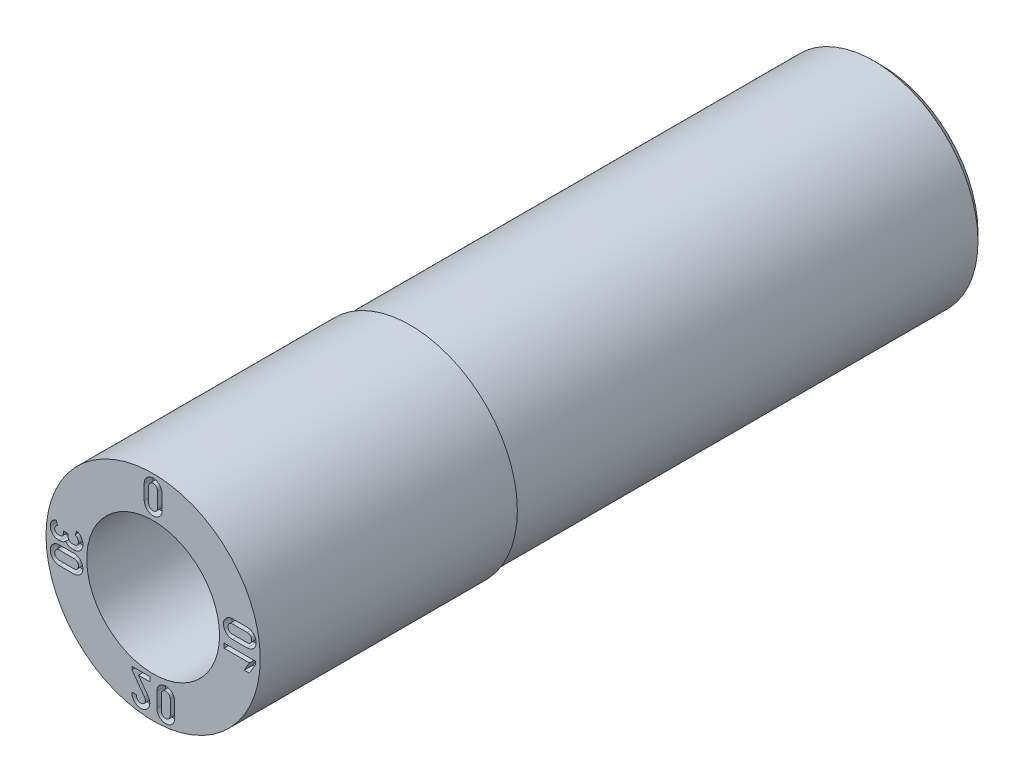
ISO-10303-21;
HEADER;
FILE_DESCRIPTION(('STEP AP214'),'2;1');
FILE_NAME('part.step','',(''),(''),'','','');
FILE_SCHEMA(('AUTOMOTIVE_DESIGN { 1 0 10303 214 1 1 1 1 }'));
ENDSEC;
DATA;
#1=APPLICATION_CONTEXT('core data for automotive mechanical design processes');
#2=APPLICATION_PROTOCOL_DEFINITION('international standard','automotive_design',2000,#1);
#3=PRODUCT_CONTEXT('',#1,'mechanical');
#4=PRODUCT('Part','Part','',(#3));
#5=PRODUCT_RELATED_PRODUCT_CATEGORY('part','',(#4));
#6=PRODUCT_DEFINITION_FORMATION('','',#4);
#7=PRODUCT_DEFINITION_CONTEXT('part definition',#1,'design');
#8=PRODUCT_DEFINITION('design','',#6,#7);
#9=PRODUCT_DEFINITION_SHAPE('','',#8);
#10=(LENGTH_UNIT() NAMED_UNIT(*) SI_UNIT(.MILLI.,.METRE.));
#11=(NAMED_UNIT(*) PLANE_ANGLE_UNIT() SI_UNIT($,.RADIAN.));
#12=(NAMED_UNIT(*) SI_UNIT($,.STERADIAN.) SOLID_ANGLE_UNIT());
#13=UNCERTAINTY_MEASURE_WITH_UNIT(LENGTH_MEASURE(1.E-05),#10,'distance_accuracy_value','');
#14=(GEOMETRIC_REPRESENTATION_CONTEXT(3) GLOBAL_UNCERTAINTY_ASSIGNED_CONTEXT((#13)) GLOBAL_UNIT_ASSIGNED_CONTEXT((#10,
#11,#12)) REPRESENTATION_CONTEXT('',''));
#15=CARTESIAN_POINT('',(0.,0.,0.));
#16=DIRECTION('',(0.,0.,1.));
#17=DIRECTION('',(1.,0.,0.));
#18=AXIS2_PLACEMENT_3D('',#15,#16,#17);
#19=CARTESIAN_POINT('',(0.,0.,3.79790950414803));
#20=DIRECTION('',(0.,0.,1.));
#21=DIRECTION('',(1.,0.,0.));
#22=AXIS2_PLACEMENT_3D('',#19,#20,#21);
#23=CYLINDRICAL_SURFACE('',#22,0.799999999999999);
#24=CARTESIAN_POINT('',(0.,0.,-14.));
#25=DIRECTION('',(0.,0.,1.));
#26=DIRECTION('',(1.,0.,0.));
#27=AXIS2_PLACEMENT_3D('',#24,#25,#26);
#28=CIRCLE('',#27,0.8);
#29=CARTESIAN_POINT('',(0.8,0.,-14.));
#30=VERTEX_POINT('',#29);
#31=EDGE_CURVE('E1150',#30,#30,#28,.T.);
#32=ORIENTED_EDGE('',*,*,#31,.F.);
#33=EDGE_LOOP('',(#32));
#34=FACE_BOUND('',#33,.T.);
#35=CARTESIAN_POINT('',(0.,0.,-4.2));
#36=DIRECTION('',(0.,0.,1.));
#37=DIRECTION('',(1.,0.,0.));
#38=AXIS2_PLACEMENT_3D('',#35,#36,#37);
#39=CIRCLE('',#38,0.799999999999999);
#40=CARTESIAN_POINT('',(0.69282032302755,-0.399999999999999,-4.2));
#41=VERTEX_POINT('',#40);
#42=CARTESIAN_POINT('',(0.,-0.799999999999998,-4.2));
#43=VERTEX_POINT('',#42);
#44=EDGE_CURVE('E11',#41,#43,#39,.F.);
#45=ORIENTED_EDGE('',*,*,#44,.F.);
#46=CARTESIAN_POINT('',(0.69282032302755,0.399999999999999,-4.2));
#47=VERTEX_POINT('',#46);
#48=EDGE_CURVE('E38',#47,#41,#39,.F.);
#49=ORIENTED_EDGE('',*,*,#48,.F.);
#50=CARTESIAN_POINT('',(0.,0.799999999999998,-4.2));
#51=VERTEX_POINT('',#50);
#52=EDGE_CURVE('E525',#51,#47,#39,.F.);
#53=ORIENTED_EDGE('',*,*,#52,.F.);
#54=CARTESIAN_POINT('',(-0.69282032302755,0.399999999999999,-4.2));
#55=VERTEX_POINT('',#54);
#56=EDGE_CURVE('E2200',#55,#51,#39,.F.);
#57=ORIENTED_EDGE('',*,*,#56,.F.);
#58=CARTESIAN_POINT('',(-0.692820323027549,-0.399999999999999,-4.2));
#59=VERTEX_POINT('',#58);
#60=EDGE_CURVE('E2198',#59,#55,#39,.F.);
#61=ORIENTED_EDGE('',*,*,#60,.F.);
#62=EDGE_CURVE('E43',#43,#59,#39,.F.);
#63=ORIENTED_EDGE('',*,*,#62,.F.);
#64=EDGE_LOOP('',(#45,#49,#53,#57,#61,#63));
#65=FACE_BOUND('',#64,.T.);
#66=ADVANCED_FACE('F34',(#34,#65),#23,.F.);
#67=CARTESIAN_POINT('',(0.,0.,3.79790950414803));
#68=DIRECTION('',(0.,0.,1.));
#69=DIRECTION('',(1.,0.,0.));
#70=AXIS2_PLACEMENT_3D('',#67,#68,#69);
#71=CYLINDRICAL_SURFACE('',#70,2.5);
#72=CARTESIAN_POINT('',(0.,0.,0.));
#73=DIRECTION('',(0.,0.,1.));
#74=DIRECTION('',(1.,0.,0.));
#75=AXIS2_PLACEMENT_3D('',#72,#73,#74);
#76=CIRCLE('',#75,2.5);
#77=CARTESIAN_POINT('',(2.5,0.,0.));
#78=VERTEX_POINT('',#77);
#79=EDGE_CURVE('E1159',#78,#78,#76,.T.);
#80=ORIENTED_EDGE('',*,*,#79,.F.);
#81=EDGE_LOOP('',(#80));
#82=FACE_BOUND('',#81,.T.);
#83=CARTESIAN_POINT('',(0.,0.,-6.));
#84=DIRECTION('',(0.,0.,-1.));
#85=DIRECTION('',(-1.,0.,0.));
#86=AXIS2_PLACEMENT_3D('',#83,#84,#85);
#87=CIRCLE('',#86,2.5);
#88=CARTESIAN_POINT('',(-2.5,0.,-6.));
#89=VERTEX_POINT('',#88);
#90=EDGE_CURVE('E1144',#89,#89,#87,.T.);
#91=ORIENTED_EDGE('',*,*,#90,.F.);
#92=EDGE_LOOP('',(#91));
#93=FACE_BOUND('',#92,.T.);
#94=ADVANCED_FACE('F36',(#82,#93),#71,.T.);
#95=CARTESIAN_POINT('',(0.,0.,-17.));
#96=DIRECTION('',(0.,0.,1.));
#97=DIRECTION('',(1.,0.,0.));
#98=AXIS2_PLACEMENT_3D('',#95,#96,#97);
#99=CONICAL_SURFACE('',#98,2.2499999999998,0.785398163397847);
#100=CARTESIAN_POINT('',(0.,0.,-17.));
#101=DIRECTION('',(0.,0.,1.));
#102=DIRECTION('',(1.,0.,0.));
#103=AXIS2_PLACEMENT_3D('',#100,#101,#102);
#104=CIRCLE('',#103,2.2499999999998);
#105=CARTESIAN_POINT('',(2.2499999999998,0.,-17.));
#106=VERTEX_POINT('',#105);
#107=EDGE_CURVE('E1140',#106,#106,#104,.T.);
#108=ORIENTED_EDGE('',*,*,#107,.T.);
#109=EDGE_LOOP('',(#108));
#110=FACE_BOUND('',#109,.T.);
#111=CARTESIAN_POINT('',(0.,0.,-16.815));
#112=DIRECTION('',(0.,0.,1.));
#113=DIRECTION('',(1.,0.,0.));
#114=AXIS2_PLACEMENT_3D('',#111,#112,#113);
#115=CIRCLE('',#114,2.435);
#116=CARTESIAN_POINT('',(2.435,0.,-16.815));
#117=VERTEX_POINT('',#116);
#118=EDGE_CURVE('E1139',#117,#117,#115,.T.);
#119=ORIENTED_EDGE('',*,*,#118,.F.);
#120=EDGE_LOOP('',(#119));
#121=FACE_BOUND('',#120,.T.);
#122=ADVANCED_FACE('F1232',(#110,#121),#99,.T.);
#123=CARTESIAN_POINT('',(0.,2.5,0.));
#124=DIRECTION('',(0.,0.,-1.));
#125=DIRECTION('',(-1.,0.,0.));
#126=AXIS2_PLACEMENT_3D('',#123,#124,#125);
#127=PLANE('',#126);
#128=DIRECTION('',(8.53203783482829E-05,0.999999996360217,0.));
#129=VECTOR('',#128,1.);
#130=CARTESIAN_POINT('',(0.50429011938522,-2.20035442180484,0.));
#131=LINE('',#130,#129);
#132=CARTESIAN_POINT('',(0.50429011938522,-2.20035442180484,0.));
#133=VERTEX_POINT('',#132);
#134=CARTESIAN_POINT('',(0.504319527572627,-1.85567489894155,0.));
#135=VERTEX_POINT('',#134);
#136=EDGE_CURVE('E625',#133,#135,#131,.T.);
#137=ORIENTED_EDGE('',*,*,#136,.F.);
#138=CARTESIAN_POINT('',(0.295396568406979,-2.20037204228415,0.));
#139=DIRECTION('',(0.,0.,1.));
#140=DIRECTION('',(1.,0.,0.));
#141=AXIS2_PLACEMENT_3D('',#138,#139,#140);
#142=CIRCLE('',#141,0.208893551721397);
#143=CARTESIAN_POINT('',(0.0865030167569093,-2.20037750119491,0.));
#144=VERTEX_POINT('',#143);
#145=EDGE_CURVE('E602',#144,#133,#142,.T.);
#146=ORIENTED_EDGE('',*,*,#145,.F.);
#147=DIRECTION('',(8.43514760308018E-05,-0.999999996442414,0.));
#148=VECTOR('',#147,1.);
#149=CARTESIAN_POINT('',(0.0864739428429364,-1.85570168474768,0.));
#150=LINE('',#149,#148);
#151=CARTESIAN_POINT('',(0.0864739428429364,-1.85570168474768,0.));
#152=VERTEX_POINT('',#151);
#153=EDGE_CURVE('E614',#152,#144,#150,.T.);
#154=ORIENTED_EDGE('',*,*,#153,.F.);
#155=CARTESIAN_POINT('',(0.295396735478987,-1.85569252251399,0.));
#156=DIRECTION('',(0.,0.,1.));
#157=DIRECTION('',(1.,0.,0.));
#158=AXIS2_PLACEMENT_3D('',#155,#156,#157);
#159=CIRCLE('',#158,0.208922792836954);
#160=EDGE_CURVE('E628',#135,#152,#159,.T.);
#161=ORIENTED_EDGE('',*,*,#160,.F.);
#162=EDGE_LOOP('',(#137,#146,#154,#161));
#163=FACE_BOUND('',#162,.T.);
#164=DIRECTION('',(-0.999999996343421,8.55170029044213E-05,0.));
#165=VECTOR('',#164,1.);
#166=CARTESIAN_POINT('',(-1.84719973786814,0.137142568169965,0.));
#167=LINE('',#166,#165);
#168=CARTESIAN_POINT('',(-1.84719973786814,0.137142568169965,0.));
#169=VERTEX_POINT('',#168);
#170=CARTESIAN_POINT('',(-1.88375629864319,0.137145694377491,0.));
#171=VERTEX_POINT('',#170);
#172=EDGE_CURVE('E722',#169,#171,#167,.T.);
#173=ORIENTED_EDGE('',*,*,#172,.F.);
#174=CARTESIAN_POINT('',(-1.84719080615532,0.24158627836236,0.));
#175=DIRECTION('',(0.,0.,-1.));
#176=DIRECTION('',(1.,0.,0.));
#177=AXIS2_PLACEMENT_3D('',#174,#175,#176);
#178=CIRCLE('',#177,0.104443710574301);
#179=CARTESIAN_POINT('',(-1.742747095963,0.241577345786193,0.));
#180=VERTEX_POINT('',#179);
#181=EDGE_CURVE('E631',#180,#169,#178,.T.);
#182=ORIENTED_EDGE('',*,*,#181,.F.);
#183=CARTESIAN_POINT('',(-1.86288206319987,0.241587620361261,0.));
#184=DIRECTION('',(0.,0.,-1.));
#185=DIRECTION('',(1.,0.,0.));
#186=AXIS2_PLACEMENT_3D('',#183,#184,#185);
#187=CIRCLE('',#186,0.120134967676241);
#188=CARTESIAN_POINT('',(-1.81877901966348,0.353334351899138,0.));
#189=VERTEX_POINT('',#188);
#190=EDGE_CURVE('E660',#189,#180,#187,.T.);
#191=ORIENTED_EDGE('',*,*,#190,.F.);
#192=DIRECTION('',(-0.367087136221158,-0.930186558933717,0.));
#193=VECTOR('',#192,1.);
#194=CARTESIAN_POINT('',(-1.7804481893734,0.450463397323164,0.));
#195=LINE('',#194,#193);
#196=CARTESIAN_POINT('',(-1.7804481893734,0.450463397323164,0.));
#197=VERTEX_POINT('',#196);
#198=EDGE_CURVE('E772',#197,#189,#195,.T.);
#199=ORIENTED_EDGE('',*,*,#198,.F.);
#200=CARTESIAN_POINT('',(-1.86293326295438,0.24153855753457,0.));
#201=DIRECTION('',(0.,0.,1.));
#202=DIRECTION('',(1.,0.,0.));
#203=AXIS2_PLACEMENT_3D('',#200,#201,#202);
#204=CIRCLE('',#203,0.224618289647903);
#205=CARTESIAN_POINT('',(-1.63831497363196,0.241550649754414,0.));
#206=VERTEX_POINT('',#205);
#207=EDGE_CURVE('E769',#206,#197,#204,.T.);
#208=ORIENTED_EDGE('',*,*,#207,.F.);
#209=CARTESIAN_POINT('',(-1.84717319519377,0.241539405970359,0.));
#210=DIRECTION('',(0.,0.,1.));
#211=DIRECTION('',(1.,0.,0.));
#212=AXIS2_PLACEMENT_3D('',#209,#210,#211);
#213=CIRCLE('',#212,0.208858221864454);
#214=CARTESIAN_POINT('',(-1.84719100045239,0.0326811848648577,0.));
#215=VERTEX_POINT('',#214);
#216=EDGE_CURVE('E766',#215,#206,#213,.T.);
#217=ORIENTED_EDGE('',*,*,#216,.F.);
#218=DIRECTION('',(0.99999999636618,-8.52504561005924E-05,0.));
#219=VECTOR('',#218,1.);
#220=CARTESIAN_POINT('',(-1.88376094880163,0.0326843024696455,0.));
#221=LINE('',#220,#219);
#222=CARTESIAN_POINT('',(-1.88376094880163,0.0326843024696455,0.));
#223=VERTEX_POINT('',#222);
#224=EDGE_CURVE('E763',#223,#215,#221,.T.);
#225=ORIENTED_EDGE('',*,*,#224,.F.);
#226=CARTESIAN_POINT('',(-1.8837933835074,0.241490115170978,0.));
#227=DIRECTION('',(0.,0.,1.));
#228=DIRECTION('',(1.,0.,0.));
#229=AXIS2_PLACEMENT_3D('',#226,#227,#228);
#230=CIRCLE('',#229,0.208805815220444);
#231=CARTESIAN_POINT('',(-2.04416458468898,0.107770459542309,0.));
#232=VERTEX_POINT('',#231);
#233=EDGE_CURVE('E760',#232,#223,#230,.T.);
#234=ORIENTED_EDGE('',*,*,#233,.F.);
#235=CARTESIAN_POINT('',(-2.17617993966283,0.241513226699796,0.));
#236=DIRECTION('',(0.,0.,1.));
#237=DIRECTION('',(1.,0.,0.));
#238=AXIS2_PLACEMENT_3D('',#235,#236,#237);
#239=CIRCLE('',#238,0.187923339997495);
#240=CARTESIAN_POINT('',(-2.17619608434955,0.0535898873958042,0.));
#241=VERTEX_POINT('',#240);
#242=EDGE_CURVE('E757',#241,#232,#239,.T.);
#243=ORIENTED_EDGE('',*,*,#242,.F.);
#244=DIRECTION('',(0.999999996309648,-8.59110264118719E-05,0.));
#245=VECTOR('',#244,1.);
#246=CARTESIAN_POINT('',(-2.21273720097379,0.0535930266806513,0.));
#247=LINE('',#246,#245);
#248=CARTESIAN_POINT('',(-2.21273720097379,0.0535930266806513,0.));
#249=VERTEX_POINT('',#248);
#250=EDGE_CURVE('E754',#249,#241,#247,.T.);
#251=ORIENTED_EDGE('',*,*,#250,.F.);
#252=CARTESIAN_POINT('',(-2.21275016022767,0.241579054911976,0.));
#253=DIRECTION('',(0.,0.,1.));
#254=DIRECTION('',(1.,0.,0.));
#255=AXIS2_PLACEMENT_3D('',#252,#253,#254);
#256=CIRCLE('',#255,0.187986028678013);
#257=CARTESIAN_POINT('',(-2.40073618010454,0.2416365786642,0.));
#258=VERTEX_POINT('',#257);
#259=EDGE_CURVE('E751',#258,#249,#256,.T.);
#260=ORIENTED_EDGE('',*,*,#259,.F.);
#261=CARTESIAN_POINT('',(-2.20223686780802,0.241575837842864,0.));
#262=DIRECTION('',(0.,0.,1.));
#263=DIRECTION('',(1.,0.,0.));
#264=AXIS2_PLACEMENT_3D('',#261,#262,#263);
#265=CIRCLE('',#264,0.198499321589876);
#266=CARTESIAN_POINT('',(-2.26579835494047,0.429623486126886,0.));
#267=VERTEX_POINT('',#266);
#268=EDGE_CURVE('E748',#267,#258,#265,.T.);
#269=ORIENTED_EDGE('',*,*,#268,.F.);
#270=DIRECTION('',(-0.319923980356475,0.947443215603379,0.));
#271=VECTOR('',#270,1.);
#272=CARTESIAN_POINT('',(-2.23237990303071,0.330655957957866,0.));
#273=LINE('',#272,#271);
#274=CARTESIAN_POINT('',(-2.23237990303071,0.330655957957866,0.));
#275=VERTEX_POINT('',#274);
#276=EDGE_CURVE('E745',#275,#267,#273,.T.);
#277=ORIENTED_EDGE('',*,*,#276,.F.);
#278=CARTESIAN_POINT('',(-2.20241232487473,0.241692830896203,0.));
#279=DIRECTION('',(0.,0.,-1.));
#280=DIRECTION('',(1.,0.,0.));
#281=AXIS2_PLACEMENT_3D('',#278,#279,#280);
#282=CIRCLE('',#281,0.0938748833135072);
#283=CARTESIAN_POINT('',(-2.29628717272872,0.241611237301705,0.));
#284=VERTEX_POINT('',#283);
#285=EDGE_CURVE('E742',#284,#275,#282,.T.);
#286=ORIENTED_EDGE('',*,*,#285,.F.);
#287=CARTESIAN_POINT('',(-2.21265765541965,0.241683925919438,0.));
#288=DIRECTION('',(0.,0.,-1.));
#289=DIRECTION('',(1.,0.,0.));
#290=AXIS2_PLACEMENT_3D('',#287,#288,#289);
#291=CIRCLE('',#290,0.0836295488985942);
#292=CARTESIAN_POINT('',(-2.21273865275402,0.158054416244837,0.));
#293=VERTEX_POINT('',#292);
#294=EDGE_CURVE('E739',#293,#284,#291,.T.);
#295=ORIENTED_EDGE('',*,*,#294,.F.);
#296=DIRECTION('',(-0.999999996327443,8.57036442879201E-05,0.));
#297=VECTOR('',#296,1.);
#298=CARTESIAN_POINT('',(-2.17618715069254,0.158051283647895,0.));
#299=LINE('',#298,#297);
#300=CARTESIAN_POINT('',(-2.17618715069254,0.158051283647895,0.));
#301=VERTEX_POINT('',#300);
#302=EDGE_CURVE('E736',#301,#293,#299,.T.);
#303=ORIENTED_EDGE('',*,*,#302,.F.);
#304=CARTESIAN_POINT('',(-2.17617999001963,0.241602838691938,0.));
#305=DIRECTION('',(0.,0.,-1.));
#306=DIRECTION('',(1.,0.,0.));
#307=AXIS2_PLACEMENT_3D('',#304,#305,#306);
#308=CIRCLE('',#307,0.0835515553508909);
#309=CARTESIAN_POINT('',(-2.09262843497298,0.24159570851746,0.));
#310=VERTEX_POINT('',#309);
#311=EDGE_CURVE('E733',#310,#301,#308,.T.);
#312=ORIENTED_EDGE('',*,*,#311,.F.);
#313=DIRECTION('',(-8.55211335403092E-05,-0.999999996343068,0.));
#314=VECTOR('',#313,1.);
#315=CARTESIAN_POINT('',(-2.09262397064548,0.293797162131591,0.));
#316=LINE('',#315,#314);
#317=CARTESIAN_POINT('',(-2.09262397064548,0.293797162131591,0.));
#318=VERTEX_POINT('',#317);
#319=EDGE_CURVE('E729',#318,#310,#316,.T.);
#320=ORIENTED_EDGE('',*,*,#319,.F.);
#321=DIRECTION('',(-0.999999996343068,8.55211333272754E-05,0.));
#322=VECTOR('',#321,1.);
#323=CARTESIAN_POINT('',(-1.98816257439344,0.293788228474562,0.));
#324=LINE('',#323,#322);
#325=CARTESIAN_POINT('',(-1.98816257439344,0.293788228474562,0.));
#326=VERTEX_POINT('',#325);
#327=EDGE_CURVE('E726',#326,#318,#324,.T.);
#328=ORIENTED_EDGE('',*,*,#327,.F.);
#329=DIRECTION('',(8.54959129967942E-05,0.999999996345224,0.));
#330=VECTOR('',#329,1.);
#331=CARTESIAN_POINT('',(-1.988167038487,0.241574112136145,0.));
#332=LINE('',#331,#330);
#333=CARTESIAN_POINT('',(-1.988167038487,0.241574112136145,0.));
#334=VERTEX_POINT('',#333);
#335=EDGE_CURVE('E730',#334,#326,#332,.T.);
#336=ORIENTED_EDGE('',*,*,#335,.F.);
#337=CARTESIAN_POINT('',(-1.88374754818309,0.241565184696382,0.));
#338=DIRECTION('',(0.,0.,-1.));
#339=DIRECTION('',(1.,0.,0.));
#340=AXIS2_PLACEMENT_3D('',#337,#338,#339);
#341=CIRCLE('',#340,0.10441949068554);
#342=EDGE_CURVE('E725',#171,#334,#341,.T.);
#343=ORIENTED_EDGE('',*,*,#342,.F.);
#344=EDGE_LOOP('',(#173,#182,#191,#199,#208,#217,#225,#234,#243,#251,#260,#269,#277,#286,#295,
#303,#312,#320,#328,#336,#343));
#345=FACE_BOUND('',#344,.T.);
#346=DIRECTION('',(-0.999999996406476,8.47764585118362E-05,0.));
#347=VECTOR('',#346,1.);
#348=CARTESIAN_POINT('',(2.19548734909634,0.49061455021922,0.));
#349=LINE('',#348,#347);
#350=CARTESIAN_POINT('',(2.19548734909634,0.49061455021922,0.));
#351=VERTEX_POINT('',#350);
#352=CARTESIAN_POINT('',(1.85081998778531,0.490643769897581,0.));
#353=VERTEX_POINT('',#352);
#354=EDGE_CURVE('E867',#351,#353,#349,.T.);
#355=ORIENTED_EDGE('',*,*,#354,.F.);
#356=CARTESIAN_POINT('',(2.19550508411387,0.281720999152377,0.));
#357=DIRECTION('',(0.,0.,1.));
#358=DIRECTION('',(1.,0.,0.));
#359=AXIS2_PLACEMENT_3D('',#356,#357,#358);
#360=CIRCLE('',#359,0.208893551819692);
#361=CARTESIAN_POINT('',(2.1955228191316,0.0728274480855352,0.));
#362=VERTEX_POINT('',#361);
#363=EDGE_CURVE('E845',#362,#351,#360,.T.);
#364=ORIENTED_EDGE('',*,*,#363,.F.);
#365=DIRECTION('',(0.999999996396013,8.48997850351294E-05,0.));
#366=VECTOR('',#365,1.);
#367=CARTESIAN_POINT('',(1.85084700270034,0.072798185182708,0.));
#368=LINE('',#367,#366);
#369=CARTESIAN_POINT('',(1.85084700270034,0.0727981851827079,0.));
#370=VERTEX_POINT('',#369);
#371=EDGE_CURVE('E856',#370,#362,#368,.T.);
#372=ORIENTED_EDGE('',*,*,#371,.F.);
#373=CARTESIAN_POINT('',(1.85082186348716,0.281720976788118,0.));
#374=DIRECTION('',(0.,0.,1.));
#375=DIRECTION('',(1.,0.,0.));
#376=AXIS2_PLACEMENT_3D('',#373,#374,#375);
#377=CIRCLE('',#376,0.208922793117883);
#378=EDGE_CURVE('E870',#353,#370,#377,.T.);
#379=ORIENTED_EDGE('',*,*,#378,.F.);
#380=EDGE_LOOP('',(#355,#364,#372,#379));
#381=FACE_BOUND('',#380,.T.);
#382=DIRECTION('',(8.48997847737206E-05,-0.999999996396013,0.));
#383=VECTOR('',#382,1.);
#384=CARTESIAN_POINT('',(1.65691592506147,-0.202854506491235,0.));
#385=LINE('',#384,#383);
#386=CARTESIAN_POINT('',(1.65690705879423,-0.0984223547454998,0.));
#387=VERTEX_POINT('',#386);
#388=CARTESIAN_POINT('',(1.65691592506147,-0.202854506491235,0.));
#389=VERTEX_POINT('',#388);
#390=EDGE_CURVE('E908',#387,#389,#385,.T.);
#391=ORIENTED_EDGE('',*,*,#390,.F.);
#392=DIRECTION('',(-0.999999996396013,-8.48997846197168E-05,0.));
#393=VECTOR('',#392,1.);
#394=CARTESIAN_POINT('',(1.65690705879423,-0.0984223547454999,0.));
#395=LINE('',#394,#393);
#396=CARTESIAN_POINT('',(2.38801985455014,-0.0983602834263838,0.));
#397=VERTEX_POINT('',#396);
#398=EDGE_CURVE('E877',#397,#387,#395,.T.);
#399=ORIENTED_EDGE('',*,*,#398,.F.);
#400=DIRECTION('',(-8.48997828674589E-05,0.999999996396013,0.));
#401=VECTOR('',#400,1.);
#402=CARTESIAN_POINT('',(2.38801985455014,-0.0983602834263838,0.));
#403=LINE('',#402,#401);
#404=CARTESIAN_POINT('',(2.38802569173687,-0.167114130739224,0.));
#405=VERTEX_POINT('',#404);
#406=EDGE_CURVE('E888',#405,#397,#403,.T.);
#407=ORIENTED_EDGE('',*,*,#406,.F.);
#408=DIRECTION('',(0.498418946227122,0.866936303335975,0.));
#409=VECTOR('',#408,1.);
#410=CARTESIAN_POINT('',(2.38802569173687,-0.167114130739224,0.));
#411=LINE('',#410,#409);
#412=CARTESIAN_POINT('',(2.24740959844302,-0.411697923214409,0.));
#413=VERTEX_POINT('',#412);
#414=EDGE_CURVE('E920',#413,#405,#411,.T.);
#415=ORIENTED_EDGE('',*,*,#414,.F.);
#416=DIRECTION('',(0.999999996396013,8.48997838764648E-05,0.));
#417=VECTOR('',#416,1.);
#418=CARTESIAN_POINT('',(2.24740959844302,-0.411697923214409,0.));
#419=LINE('',#418,#417);
#420=CARTESIAN_POINT('',(2.12695145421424,-0.411708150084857,0.));
#421=VERTEX_POINT('',#420);
#422=EDGE_CURVE('E917',#421,#413,#419,.T.);
#423=ORIENTED_EDGE('',*,*,#422,.F.);
#424=DIRECTION('',(-0.498285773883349,-0.867012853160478,0.));
#425=VECTOR('',#424,1.);
#426=CARTESIAN_POINT('',(2.12695145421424,-0.411708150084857,0.));
#427=LINE('',#426,#425);
#428=CARTESIAN_POINT('',(2.24701168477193,-0.202804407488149,0.));
#429=VERTEX_POINT('',#428);
#430=EDGE_CURVE('E914',#429,#421,#427,.T.);
#431=ORIENTED_EDGE('',*,*,#430,.F.);
#432=DIRECTION('',(0.999999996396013,8.48997846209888E-05,0.));
#433=VECTOR('',#432,1.);
#434=CARTESIAN_POINT('',(2.24701168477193,-0.202804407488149,0.));
#435=LINE('',#434,#433);
#436=EDGE_CURVE('E911',#389,#429,#435,.T.);
#437=ORIENTED_EDGE('',*,*,#436,.F.);
#438=EDGE_LOOP('',(#391,#399,#407,#415,#423,#431,#437));
#439=FACE_BOUND('',#438,.T.);
#440=DIRECTION('',(-8.43514763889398E-05,0.999999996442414,0.));
#441=VECTOR('',#440,1.);
#442=CARTESIAN_POINT('',(-0.0779414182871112,-1.74715536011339,0.));
#443=LINE('',#442,#441);
#444=CARTESIAN_POINT('',(-0.0779414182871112,-1.74715536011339,0.));
#445=VERTEX_POINT('',#444);
#446=CARTESIAN_POINT('',(-0.0779502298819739,-1.64269251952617,0.));
#447=VERTEX_POINT('',#446);
#448=EDGE_CURVE('E970',#445,#447,#443,.T.);
#449=ORIENTED_EDGE('',*,*,#448,.F.);
#450=DIRECTION('',(0.999999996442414,8.43514759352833E-05,0.));
#451=VECTOR('',#450,1.);
#452=CARTESIAN_POINT('',(-0.344300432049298,-1.74717782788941,0.));
#453=LINE('',#452,#451);
#454=CARTESIAN_POINT('',(-0.344300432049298,-1.74717782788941,0.));
#455=VERTEX_POINT('',#454);
#456=EDGE_CURVE('E927',#455,#445,#453,.T.);
#457=ORIENTED_EDGE('',*,*,#456,.F.);
#458=DIRECTION('',(-0.589622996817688,0.807678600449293,0.));
#459=VECTOR('',#458,1.);
#460=CARTESIAN_POINT('',(-0.117111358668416,-2.05838643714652,0.));
#461=LINE('',#460,#459);
#462=CARTESIAN_POINT('',(-0.117111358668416,-2.05838643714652,0.));
#463=VERTEX_POINT('',#462);
#464=EDGE_CURVE('E944',#463,#455,#461,.T.);
#465=ORIENTED_EDGE('',*,*,#464,.F.);
#466=CARTESIAN_POINT('',(-0.286708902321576,-2.18048762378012,0.));
#467=DIRECTION('',(0.,0.,1.));
#468=DIRECTION('',(1.,0.,0.));
#469=AXIS2_PLACEMENT_3D('',#466,#467,#468);
#470=CIRCLE('',#469,0.208978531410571);
#471=CARTESIAN_POINT('',(-0.495108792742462,-2.16494695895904,0.));
#472=VERTEX_POINT('',#471);
#473=EDGE_CURVE('E988',#472,#463,#470,.T.);
#474=ORIENTED_EDGE('',*,*,#473,.F.);
#475=DIRECTION('',(-0.999999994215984,-0.000107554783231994,0.));
#476=VECTOR('',#475,1.);
#477=CARTESIAN_POINT('',(-0.390053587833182,-2.16493565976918,0.));
#478=LINE('',#477,#476);
#479=CARTESIAN_POINT('',(-0.390053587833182,-2.16493565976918,0.));
#480=VERTEX_POINT('',#479);
#481=EDGE_CURVE('E985',#480,#472,#478,.T.);
#482=ORIENTED_EDGE('',*,*,#481,.F.);
#483=CARTESIAN_POINT('',(-0.28676169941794,-2.18060228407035,0.));
#484=DIRECTION('',(0.,0.,-1.));
#485=DIRECTION('',(1.,0.,0.));
#486=AXIS2_PLACEMENT_3D('',#483,#484,#485);
#487=CIRCLE('',#486,0.10447323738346);
#488=CARTESIAN_POINT('',(-0.201994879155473,-2.11953475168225,0.));
#489=VERTEX_POINT('',#488);
#490=EDGE_CURVE('E982',#489,#480,#487,.T.);
#491=ORIENTED_EDGE('',*,*,#490,.F.);
#492=DIRECTION('',(0.58452799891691,-0.811373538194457,0.));
#493=VECTOR('',#492,1.);
#494=CARTESIAN_POINT('',(-0.49573190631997,-1.71180329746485,0.));
#495=LINE('',#494,#493);
#496=CARTESIAN_POINT('',(-0.49573190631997,-1.71180329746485,0.));
#497=VERTEX_POINT('',#496);
#498=EDGE_CURVE('E979',#497,#489,#495,.T.);
#499=ORIENTED_EDGE('',*,*,#498,.F.);
#500=DIRECTION('',(8.43514742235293E-05,-0.999999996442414,0.));
#501=VECTOR('',#500,1.);
#502=CARTESIAN_POINT('',(-0.495737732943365,-1.64272776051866,0.));
#503=LINE('',#502,#501);
#504=CARTESIAN_POINT('',(-0.495737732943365,-1.64272776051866,0.));
#505=VERTEX_POINT('',#504);
#506=EDGE_CURVE('E976',#505,#497,#503,.T.);
#507=ORIENTED_EDGE('',*,*,#506,.F.);
#508=DIRECTION('',(-0.999999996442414,-8.43514755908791E-05,0.));
#509=VECTOR('',#508,1.);
#510=CARTESIAN_POINT('',(-0.0779502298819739,-1.64269251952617,0.));
#511=LINE('',#510,#509);
#512=EDGE_CURVE('E973',#447,#505,#511,.T.);
#513=ORIENTED_EDGE('',*,*,#512,.F.);
#514=EDGE_LOOP('',(#449,#457,#465,#474,#482,#491,#499,#507,#513));
#515=FACE_BOUND('',#514,.T.);
#516=DIRECTION('',(8.43544746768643E-05,-0.999999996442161,0.));
#517=VECTOR('',#516,1.);
#518=CARTESIAN_POINT('',(-0.208031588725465,2.19678072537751,0.));
#519=LINE('',#518,#517);
#520=CARTESIAN_POINT('',(-0.208031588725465,2.19678072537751,0.));
#521=VERTEX_POINT('',#520);
#522=CARTESIAN_POINT('',(-0.208002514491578,1.85211336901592,0.));
#523=VERTEX_POINT('',#522);
#524=EDGE_CURVE('E1055',#521,#523,#519,.T.);
#525=ORIENTED_EDGE('',*,*,#524,.F.);
#526=CARTESIAN_POINT('',(0.000920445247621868,2.19679835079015,0.));
#527=DIRECTION('',(0.,0.,1.));
#528=DIRECTION('',(1.,0.,0.));
#529=AXIS2_PLACEMENT_3D('',#526,#527,#528);
#530=CIRCLE('',#529,0.208952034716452);
#531=CARTESIAN_POINT('',(0.209872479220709,2.19681597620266,0.));
#532=VERTEX_POINT('',#531);
#533=EDGE_CURVE('E1034',#532,#521,#530,.T.);
#534=ORIENTED_EDGE('',*,*,#533,.F.);
#535=DIRECTION('',(8.53236016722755E-05,0.999999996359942,0.));
#536=VECTOR('',#535,1.);
#537=CARTESIAN_POINT('',(0.209843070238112,1.8521401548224,0.));
#538=LINE('',#537,#536);
#539=CARTESIAN_POINT('',(0.209843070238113,1.8521401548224,0.));
#540=VERTEX_POINT('',#539);
#541=EDGE_CURVE('E1044',#540,#532,#538,.T.);
#542=ORIENTED_EDGE('',*,*,#541,.F.);
#543=CARTESIAN_POINT('',(0.000920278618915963,1.85211513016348,0.));
#544=DIRECTION('',(0.,0.,1.));
#545=DIRECTION('',(1.,0.,0.));
#546=AXIS2_PLACEMENT_3D('',#543,#544,#545);
#547=CIRCLE('',#546,0.208922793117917);
#548=EDGE_CURVE('E1058',#523,#540,#547,.T.);
#549=ORIENTED_EDGE('',*,*,#548,.F.);
#550=EDGE_LOOP('',(#525,#534,#542,#549));
#551=FACE_BOUND('',#550,.T.);
#552=DIRECTION('',(0.999999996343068,-8.55211335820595E-05,0.));
#553=VECTOR('',#552,1.);
#554=CARTESIAN_POINT('',(-1.84747985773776,-0.454919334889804,0.));
#555=LINE('',#554,#553);
#556=CARTESIAN_POINT('',(-2.19215567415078,-0.454889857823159,0.));
#557=VERTEX_POINT('',#556);
#558=CARTESIAN_POINT('',(-1.84747985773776,-0.454919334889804,0.));
#559=VERTEX_POINT('',#558);
#560=EDGE_CURVE('E1120',#557,#559,#555,.T.);
#561=ORIENTED_EDGE('',*,*,#560,.F.);
#562=CARTESIAN_POINT('',(-2.19213780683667,-0.245967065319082,0.));
#563=DIRECTION('',(0.,0.,1.));
#564=DIRECTION('',(1.,0.,0.));
#565=AXIS2_PLACEMENT_3D('',#562,#563,#564);
#566=CIRCLE('',#565,0.208922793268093);
#567=CARTESIAN_POINT('',(-2.19211993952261,-0.0370442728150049,0.));
#568=VERTEX_POINT('',#567);
#569=EDGE_CURVE('E1098',#568,#557,#566,.T.);
#570=ORIENTED_EDGE('',*,*,#569,.F.);
#571=DIRECTION('',(-0.999999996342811,8.55241324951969E-05,0.));
#572=VECTOR('',#571,1.);
#573=CARTESIAN_POINT('',(-2.19211993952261,-0.0370442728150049,0.));
#574=LINE('',#573,#572);
#575=CARTESIAN_POINT('',(-1.84745258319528,-0.037073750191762,0.));
#576=VERTEX_POINT('',#575);
#577=EDGE_CURVE('E1109',#576,#568,#574,.T.);
#578=ORIENTED_EDGE('',*,*,#577,.F.);
#579=CARTESIAN_POINT('',(-1.84746622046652,-0.245996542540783,0.));
#580=DIRECTION('',(0.,0.,1.));
#581=DIRECTION('',(1.,0.,0.));
#582=AXIS2_PLACEMENT_3D('',#579,#580,#581);
#583=CIRCLE('',#582,0.208922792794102);
#584=EDGE_CURVE('E1123',#559,#576,#583,.T.);
#585=ORIENTED_EDGE('',*,*,#584,.F.);
#586=EDGE_LOOP('',(#561,#570,#578,#585));
#587=FACE_BOUND('',#586,.T.);
#588=CARTESIAN_POINT('',(0.,0.,0.));
#589=DIRECTION('',(0.,0.,1.));
#590=DIRECTION('',(1.,0.,0.));
#591=AXIS2_PLACEMENT_3D('',#588,#589,#590);
#592=CIRCLE('',#591,1.55);
#593=CARTESIAN_POINT('',(1.55,0.,0.));
#594=VERTEX_POINT('',#593);
#595=EDGE_CURVE('E1156',#594,#594,#592,.T.);
#596=ORIENTED_EDGE('',*,*,#595,.F.);
#597=EDGE_LOOP('',(#596));
#598=FACE_BOUND('',#597,.T.);
#599=ORIENTED_EDGE('',*,*,#79,.T.);
#600=EDGE_LOOP('',(#599));
#601=FACE_BOUND('',#600,.T.);
#602=ADVANCED_FACE('F1206',(#163,#345,#381,#439,#515,#551,#587,#598,#601),#127,.F.);
#603=CARTESIAN_POINT('',(0.,0.,3.79790950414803));
#604=DIRECTION('',(0.,0.,1.));
#605=DIRECTION('',(1.,0.,0.));
#606=AXIS2_PLACEMENT_3D('',#603,#604,#605);
#607=CYLINDRICAL_SURFACE('',#606,1.55);
#608=CARTESIAN_POINT('',(0.,0.,-2.8));
#609=DIRECTION('',(0.,0.,1.));
#610=DIRECTION('',(1.,0.,0.));
#611=AXIS2_PLACEMENT_3D('',#608,#609,#610);
#612=CIRCLE('',#611,1.55);
#613=CARTESIAN_POINT('',(1.55,0.,-2.8));
#614=VERTEX_POINT('',#613);
#615=EDGE_CURVE('E1153',#614,#614,#612,.T.);
#616=ORIENTED_EDGE('',*,*,#615,.F.);
#617=EDGE_LOOP('',(#616));
#618=FACE_BOUND('',#617,.T.);
#619=ORIENTED_EDGE('',*,*,#595,.T.);
#620=EDGE_LOOP('',(#619));
#621=FACE_BOUND('',#620,.T.);
#622=ADVANCED_FACE('F1243',(#618,#621),#607,.F.);
#623=CARTESIAN_POINT('',(0.,1.55,-2.8));
#624=DIRECTION('',(0.,0.,-1.));
#625=DIRECTION('',(-1.,0.,0.));
#626=AXIS2_PLACEMENT_3D('',#623,#624,#625);
#627=PLANE('',#626);
#628=DIRECTION('',(-1.,0.,0.));
#629=VECTOR('',#628,1.);
#630=CARTESIAN_POINT('',(0.4618802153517,0.799999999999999,-2.8));
#631=LINE('',#630,#629);
#632=CARTESIAN_POINT('',(0.4618802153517,0.799999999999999,-2.8));
#633=VERTEX_POINT('',#632);
#634=CARTESIAN_POINT('',(-0.4618802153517,0.799999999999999,-2.8));
#635=VERTEX_POINT('',#634);
#636=EDGE_CURVE('E50',#633,#635,#631,.T.);
#637=ORIENTED_EDGE('',*,*,#636,.F.);
#638=DIRECTION('',(-0.5,0.866025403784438,0.));
#639=VECTOR('',#638,1.);
#640=CARTESIAN_POINT('',(0.9237604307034,0.,-2.8));
#641=LINE('',#640,#639);
#642=CARTESIAN_POINT('',(0.9237604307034,0.,-2.8));
#643=VERTEX_POINT('',#642);
#644=EDGE_CURVE('E534',#643,#633,#641,.T.);
#645=ORIENTED_EDGE('',*,*,#644,.F.);
#646=DIRECTION('',(0.5,0.866025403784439,0.));
#647=VECTOR('',#646,1.);
#648=CARTESIAN_POINT('',(0.4618802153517,-0.799999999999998,-2.8));
#649=LINE('',#648,#647);
#650=CARTESIAN_POINT('',(0.4618802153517,-0.799999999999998,-2.8));
#651=VERTEX_POINT('',#650);
#652=EDGE_CURVE('E528',#651,#643,#649,.T.);
#653=ORIENTED_EDGE('',*,*,#652,.F.);
#654=DIRECTION('',(1.,0.,0.));
#655=VECTOR('',#654,1.);
#656=CARTESIAN_POINT('',(-0.461880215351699,-0.799999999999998,-2.8));
#657=LINE('',#656,#655);
#658=CARTESIAN_POINT('',(-0.461880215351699,-0.799999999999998,-2.8));
#659=VERTEX_POINT('',#658);
#660=EDGE_CURVE('E568',#659,#651,#657,.T.);
#661=ORIENTED_EDGE('',*,*,#660,.F.);
#662=DIRECTION('',(0.5,-0.866025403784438,0.));
#663=VECTOR('',#662,1.);
#664=CARTESIAN_POINT('',(-0.923760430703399,0.,-2.8));
#665=LINE('',#664,#663);
#666=CARTESIAN_POINT('',(-0.923760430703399,0.,-2.8));
#667=VERTEX_POINT('',#666);
#668=EDGE_CURVE('E565',#667,#659,#665,.T.);
#669=ORIENTED_EDGE('',*,*,#668,.F.);
#670=DIRECTION('',(-0.5,-0.866025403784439,0.));
#671=VECTOR('',#670,1.);
#672=CARTESIAN_POINT('',(-0.4618802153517,0.799999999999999,-2.8));
#673=LINE('',#672,#671);
#674=EDGE_CURVE('E562',#635,#667,#673,.T.);
#675=ORIENTED_EDGE('',*,*,#674,.F.);
#676=EDGE_LOOP('',(#637,#645,#653,#661,#669,#675));
#677=FACE_BOUND('',#676,.T.);
#678=ORIENTED_EDGE('',*,*,#615,.T.);
#679=EDGE_LOOP('',(#678));
#680=FACE_BOUND('',#679,.T.);
#681=ADVANCED_FACE('F1240',(#677,#680),#627,.F.);
#682=CARTESIAN_POINT('',(0.,0.8,-14.));
#683=DIRECTION('',(0.,0.,1.));
#684=DIRECTION('',(1.,0.,0.));
#685=AXIS2_PLACEMENT_3D('',#682,#683,#684);
#686=PLANE('',#685);
#687=CARTESIAN_POINT('',(0.,0.,-14.));
#688=DIRECTION('',(0.,0.,1.));
#689=DIRECTION('',(1.,0.,0.));
#690=AXIS2_PLACEMENT_3D('',#687,#688,#689);
#691=CIRCLE('',#690,1.5);
#692=CARTESIAN_POINT('',(1.5,0.,-14.));
#693=VERTEX_POINT('',#692);
#694=EDGE_CURVE('E1147',#693,#693,#691,.T.);
#695=ORIENTED_EDGE('',*,*,#694,.F.);
#696=EDGE_LOOP('',(#695));
#697=FACE_BOUND('',#696,.T.);
#698=ORIENTED_EDGE('',*,*,#31,.T.);
#699=EDGE_LOOP('',(#698));
#700=FACE_BOUND('',#699,.T.);
#701=ADVANCED_FACE('F1238',(#697,#700),#686,.F.);
#702=CARTESIAN_POINT('',(0.,0.,3.79790950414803));
#703=DIRECTION('',(0.,0.,1.));
#704=DIRECTION('',(1.,0.,0.));
#705=AXIS2_PLACEMENT_3D('',#702,#703,#704);
#706=CYLINDRICAL_SURFACE('',#705,1.5);
#707=CARTESIAN_POINT('',(0.,0.,-17.));
#708=DIRECTION('',(0.,0.,1.));
#709=DIRECTION('',(1.,0.,0.));
#710=AXIS2_PLACEMENT_3D('',#707,#708,#709);
#711=CIRCLE('',#710,1.5);
#712=CARTESIAN_POINT('',(1.5,0.,-17.));
#713=VERTEX_POINT('',#712);
#714=EDGE_CURVE('E1143',#713,#713,#711,.T.);
#715=ORIENTED_EDGE('',*,*,#714,.F.);
#716=EDGE_LOOP('',(#715));
#717=FACE_BOUND('',#716,.T.);
#718=ORIENTED_EDGE('',*,*,#694,.T.);
#719=EDGE_LOOP('',(#718));
#720=FACE_BOUND('',#719,.T.);
#721=ADVANCED_FACE('F1371',(#717,#720),#706,.F.);
#722=CARTESIAN_POINT('',(0.,1.5,-17.));
#723=DIRECTION('',(0.,0.,1.));
#724=DIRECTION('',(1.,0.,0.));
#725=AXIS2_PLACEMENT_3D('',#722,#723,#724);
#726=PLANE('',#725);
#727=ORIENTED_EDGE('',*,*,#107,.F.);
#728=EDGE_LOOP('',(#727));
#729=FACE_BOUND('',#728,.T.);
#730=ORIENTED_EDGE('',*,*,#714,.T.);
#731=EDGE_LOOP('',(#730));
#732=FACE_BOUND('',#731,.T.);
#733=ADVANCED_FACE('F1361',(#729,#732),#726,.F.);
#734=CARTESIAN_POINT('',(0.,3.435,-6.));
#735=DIRECTION('',(0.,0.,-1.));
#736=DIRECTION('',(-1.,0.,0.));
#737=AXIS2_PLACEMENT_3D('',#734,#735,#736);
#738=PLANE('',#737);
#739=CARTESIAN_POINT('',(0.,0.,-6.));
#740=DIRECTION('',(0.,0.,1.));
#741=DIRECTION('',(1.,0.,0.));
#742=AXIS2_PLACEMENT_3D('',#739,#740,#741);
#743=CIRCLE('',#742,2.435);
#744=CARTESIAN_POINT('',(2.435,0.,-6.));
#745=VERTEX_POINT('',#744);
#746=EDGE_CURVE('E1130',#745,#745,#743,.T.);
#747=ORIENTED_EDGE('',*,*,#746,.T.);
#748=EDGE_LOOP('',(#747));
#749=FACE_BOUND('',#748,.T.);
#750=ORIENTED_EDGE('',*,*,#90,.T.);
#751=EDGE_LOOP('',(#750));
#752=FACE_BOUND('',#751,.T.);
#753=ADVANCED_FACE('F1358',(#749,#752),#738,.T.);
#754=CARTESIAN_POINT('',(0.,0.,0.));
#755=DIRECTION('',(0.,0.,1.));
#756=DIRECTION('',(1.,0.,0.));
#757=AXIS2_PLACEMENT_3D('',#754,#755,#756);
#758=CYLINDRICAL_SURFACE('',#757,2.435);
#759=ORIENTED_EDGE('',*,*,#746,.F.);
#760=EDGE_LOOP('',(#759));
#761=FACE_BOUND('',#760,.T.);
#762=ORIENTED_EDGE('',*,*,#118,.T.);
#763=EDGE_LOOP('',(#762));
#764=FACE_BOUND('',#763,.T.);
#765=ADVANCED_FACE('F1360',(#761,#764),#758,.T.);
#766=CARTESIAN_POINT('',(-2.19213780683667,-0.245967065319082,-0.2));
#767=DIRECTION('',(0.,0.,1.));
#768=DIRECTION('',(1.,0.,0.));
#769=AXIS2_PLACEMENT_3D('',#766,#767,#768);
#770=CYLINDRICAL_SURFACE('',#769,0.208922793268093);
#771=ORIENTED_EDGE('',*,*,#569,.T.);
#772=DIRECTION('',(0.,0.,1.));
#773=VECTOR('',#772,1.);
#774=CARTESIAN_POINT('',(-2.19215567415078,-0.454889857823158,-0.2));
#775=LINE('',#774,#773);
#776=CARTESIAN_POINT('',(-2.19215567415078,-0.454889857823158,-0.2));
#777=VERTEX_POINT('',#776);
#778=EDGE_CURVE('E1118',#777,#557,#775,.T.);
#779=ORIENTED_EDGE('',*,*,#778,.F.);
#780=CARTESIAN_POINT('',(-2.19213780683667,-0.245967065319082,-0.2));
#781=DIRECTION('',(0.,0.,1.));
#782=DIRECTION('',(1.,0.,0.));
#783=AXIS2_PLACEMENT_3D('',#780,#781,#782);
#784=CIRCLE('',#783,0.208922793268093);
#785=CARTESIAN_POINT('',(-2.19211993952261,-0.0370442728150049,-0.2));
#786=VERTEX_POINT('',#785);
#787=EDGE_CURVE('E1105',#786,#777,#784,.T.);
#788=ORIENTED_EDGE('',*,*,#787,.F.);
#789=DIRECTION('',(0.,0.,1.));
#790=VECTOR('',#789,1.);
#791=CARTESIAN_POINT('',(-2.19211993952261,-0.0370442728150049,-0.2));
#792=LINE('',#791,#790);
#793=EDGE_CURVE('E1128',#786,#568,#792,.T.);
#794=ORIENTED_EDGE('',*,*,#793,.T.);
#795=EDGE_LOOP('',(#771,#779,#788,#794));
#796=FACE_BOUND('',#795,.T.);
#797=ADVANCED_FACE('F1368',(#796),#770,.F.);
#798=CARTESIAN_POINT('',(-2.19211993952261,-0.0370442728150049,-0.2));
#799=DIRECTION('',(8.55241324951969E-05,0.999999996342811,0.));
#800=DIRECTION('',(-0.999999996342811,8.55241324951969E-05,0.));
#801=AXIS2_PLACEMENT_3D('',#798,#799,#800);
#802=PLANE('',#801);
#803=ORIENTED_EDGE('',*,*,#577,.T.);
#804=ORIENTED_EDGE('',*,*,#793,.F.);
#805=DIRECTION('',(-0.999999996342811,8.55241324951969E-05,0.));
#806=VECTOR('',#805,1.);
#807=CARTESIAN_POINT('',(-2.19211993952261,-0.0370442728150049,-0.2));
#808=LINE('',#807,#806);
#809=CARTESIAN_POINT('',(-1.84745258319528,-0.037073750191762,-0.2));
#810=VERTEX_POINT('',#809);
#811=EDGE_CURVE('E1115',#810,#786,#808,.T.);
#812=ORIENTED_EDGE('',*,*,#811,.F.);
#813=DIRECTION('',(0.,0.,1.));
#814=VECTOR('',#813,1.);
#815=CARTESIAN_POINT('',(-1.84745258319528,-0.037073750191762,-0.2));
#816=LINE('',#815,#814);
#817=EDGE_CURVE('E1131',#810,#576,#816,.T.);
#818=ORIENTED_EDGE('',*,*,#817,.T.);
#819=EDGE_LOOP('',(#803,#804,#812,#818));
#820=FACE_BOUND('',#819,.T.);
#821=ADVANCED_FACE('F1466',(#820),#802,.F.);
#822=CARTESIAN_POINT('',(-1.84746622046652,-0.245996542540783,-0.2));
#823=DIRECTION('',(0.,0.,1.));
#824=DIRECTION('',(1.,0.,0.));
#825=AXIS2_PLACEMENT_3D('',#822,#823,#824);
#826=CYLINDRICAL_SURFACE('',#825,0.208922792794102);
#827=ORIENTED_EDGE('',*,*,#584,.T.);
#828=ORIENTED_EDGE('',*,*,#817,.F.);
#829=CARTESIAN_POINT('',(-1.84746622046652,-0.245996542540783,-0.2));
#830=DIRECTION('',(0.,0.,1.));
#831=DIRECTION('',(1.,0.,0.));
#832=AXIS2_PLACEMENT_3D('',#829,#830,#831);
#833=CIRCLE('',#832,0.208922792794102);
#834=CARTESIAN_POINT('',(-1.84747985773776,-0.454919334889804,-0.2));
#835=VERTEX_POINT('',#834);
#836=EDGE_CURVE('E1112',#835,#810,#833,.T.);
#837=ORIENTED_EDGE('',*,*,#836,.F.);
#838=DIRECTION('',(0.,0.,1.));
#839=VECTOR('',#838,1.);
#840=CARTESIAN_POINT('',(-1.84747985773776,-0.454919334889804,-0.2));
#841=LINE('',#840,#839);
#842=EDGE_CURVE('E1133',#835,#559,#841,.T.);
#843=ORIENTED_EDGE('',*,*,#842,.T.);
#844=EDGE_LOOP('',(#827,#828,#837,#843));
#845=FACE_BOUND('',#844,.T.);
#846=ADVANCED_FACE('F1474',(#845),#826,.F.);
#847=CARTESIAN_POINT('',(-1.84747985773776,-0.454919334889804,-0.2));
#848=DIRECTION('',(-8.55211335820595E-05,-0.999999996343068,0.));
#849=DIRECTION('',(0.999999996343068,-8.55211335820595E-05,0.));
#850=AXIS2_PLACEMENT_3D('',#847,#848,#849);
#851=PLANE('',#850);
#852=ORIENTED_EDGE('',*,*,#560,.T.);
#853=ORIENTED_EDGE('',*,*,#842,.F.);
#854=DIRECTION('',(0.999999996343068,-8.55211335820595E-05,0.));
#855=VECTOR('',#854,1.);
#856=CARTESIAN_POINT('',(-1.84747985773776,-0.454919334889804,-0.2));
#857=LINE('',#856,#855);
#858=EDGE_CURVE('E1108',#777,#835,#857,.T.);
#859=ORIENTED_EDGE('',*,*,#858,.F.);
#860=ORIENTED_EDGE('',*,*,#778,.T.);
#861=EDGE_LOOP('',(#852,#853,#859,#860));
#862=FACE_BOUND('',#861,.T.);
#863=ADVANCED_FACE('F1483',(#862),#851,.F.);
#864=CARTESIAN_POINT('',(-2.19213780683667,-0.245967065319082,-0.2));
#865=DIRECTION('',(0.,0.,1.));
#866=DIRECTION('',(1.,0.,0.));
#867=AXIS2_PLACEMENT_3D('',#864,#865,#866);
#868=PLANE('',#867);
#869=DIRECTION('',(0.999999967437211,-0.000255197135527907,0.));
#870=VECTOR('',#869,1.);
#871=CARTESIAN_POINT('',(-1.8474666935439,-0.350487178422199,-0.2));
#872=LINE('',#871,#870);
#873=CARTESIAN_POINT('',(-2.19214673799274,-0.350399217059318,-0.2));
#874=VERTEX_POINT('',#873);
#875=CARTESIAN_POINT('',(-1.8474666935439,-0.350487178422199,-0.2));
#876=VERTEX_POINT('',#875);
#877=EDGE_CURVE('E1082',#874,#876,#872,.T.);
#878=ORIENTED_EDGE('',*,*,#877,.F.);
#879=CARTESIAN_POINT('',(-2.19213780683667,-0.245967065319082,-0.2));
#880=DIRECTION('',(0.,0.,1.));
#881=DIRECTION('',(1.,0.,0.));
#882=AXIS2_PLACEMENT_3D('',#879,#880,#881);
#883=CIRCLE('',#882,0.104432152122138);
#884=CARTESIAN_POINT('',(-2.19212887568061,-0.141534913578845,-0.2));
#885=VERTEX_POINT('',#884);
#886=EDGE_CURVE('E1079',#885,#874,#883,.T.);
#887=ORIENTED_EDGE('',*,*,#886,.F.);
#888=DIRECTION('',(-0.999999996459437,-8.41494282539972E-05,0.));
#889=VECTOR('',#888,1.);
#890=CARTESIAN_POINT('',(-2.19212887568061,-0.141534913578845,-0.2));
#891=LINE('',#890,#889);
#892=CARTESIAN_POINT('',(-1.84744565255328,-0.141505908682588,-0.2));
#893=VERTEX_POINT('',#892);
#894=EDGE_CURVE('E1075',#893,#885,#891,.T.);
#895=ORIENTED_EDGE('',*,*,#894,.F.);
#896=CARTESIAN_POINT('',(-1.84746622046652,-0.245996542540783,-0.2));
#897=DIRECTION('',(0.,0.,1.));
#898=DIRECTION('',(1.,0.,0.));
#899=AXIS2_PLACEMENT_3D('',#896,#897,#898);
#900=CIRCLE('',#899,0.104490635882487);
#901=EDGE_CURVE('E1072',#876,#893,#900,.T.);
#902=ORIENTED_EDGE('',*,*,#901,.F.);
#903=EDGE_LOOP('',(#878,#887,#895,#902));
#904=FACE_BOUND('',#903,.T.);
#905=ORIENTED_EDGE('',*,*,#787,.T.);
#906=ORIENTED_EDGE('',*,*,#858,.T.);
#907=ORIENTED_EDGE('',*,*,#836,.T.);
#908=ORIENTED_EDGE('',*,*,#811,.T.);
#909=EDGE_LOOP('',(#905,#906,#907,#908));
#910=FACE_BOUND('',#909,.T.);
#911=ADVANCED_FACE('F1492',(#904,#910),#868,.T.);
#912=CARTESIAN_POINT('',(-1.84746622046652,-0.245996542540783,-0.2));
#913=DIRECTION('',(0.,0.,1.));
#914=DIRECTION('',(1.,0.,0.));
#915=AXIS2_PLACEMENT_3D('',#912,#913,#914);
#916=CYLINDRICAL_SURFACE('',#915,0.104490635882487);
#917=CARTESIAN_POINT('',(-1.84746622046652,-0.245996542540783,0.));
#918=DIRECTION('',(0.,0.,1.));
#919=DIRECTION('',(1.,0.,0.));
#920=AXIS2_PLACEMENT_3D('',#917,#918,#919);
#921=CIRCLE('',#920,0.104490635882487);
#922=CARTESIAN_POINT('',(-1.8474666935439,-0.350487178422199,0.));
#923=VERTEX_POINT('',#922);
#924=CARTESIAN_POINT('',(-1.84744565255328,-0.141505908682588,0.));
#925=VERTEX_POINT('',#924);
#926=EDGE_CURVE('E1065',#923,#925,#921,.T.);
#927=ORIENTED_EDGE('',*,*,#926,.F.);
#928=DIRECTION('',(0.,0.,1.));
#929=VECTOR('',#928,1.);
#930=CARTESIAN_POINT('',(-1.8474666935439,-0.350487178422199,-0.2));
#931=LINE('',#930,#929);
#932=EDGE_CURVE('E1096',#876,#923,#931,.T.);
#933=ORIENTED_EDGE('',*,*,#932,.F.);
#934=ORIENTED_EDGE('',*,*,#901,.T.);
#935=DIRECTION('',(0.,0.,1.));
#936=VECTOR('',#935,1.);
#937=CARTESIAN_POINT('',(-1.84744565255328,-0.141505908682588,-0.2));
#938=LINE('',#937,#936);
#939=EDGE_CURVE('E1085',#893,#925,#938,.T.);
#940=ORIENTED_EDGE('',*,*,#939,.T.);
#941=EDGE_LOOP('',(#927,#933,#934,#940));
#942=FACE_BOUND('',#941,.T.);
#943=ADVANCED_FACE('F1501',(#942),#916,.T.);
#944=CARTESIAN_POINT('',(-1.8474666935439,-0.350487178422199,-0.2));
#945=DIRECTION('',(-0.000255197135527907,-0.99999996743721,0.));
#946=DIRECTION('',(0.999999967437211,-0.000255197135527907,0.));
#947=AXIS2_PLACEMENT_3D('',#944,#945,#946);
#948=PLANE('',#947);
#949=DIRECTION('',(0.999999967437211,-0.000255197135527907,0.));
#950=VECTOR('',#949,1.);
#951=CARTESIAN_POINT('',(-1.8474666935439,-0.350487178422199,0.));
#952=LINE('',#951,#950);
#953=CARTESIAN_POINT('',(-2.19214673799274,-0.350399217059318,0.));
#954=VERTEX_POINT('',#953);
#955=EDGE_CURVE('E1076',#954,#923,#952,.T.);
#956=ORIENTED_EDGE('',*,*,#955,.F.);
#957=DIRECTION('',(0.,0.,1.));
#958=VECTOR('',#957,1.);
#959=CARTESIAN_POINT('',(-2.19214673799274,-0.350399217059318,-0.2));
#960=LINE('',#959,#958);
#961=EDGE_CURVE('E1099',#874,#954,#960,.T.);
#962=ORIENTED_EDGE('',*,*,#961,.F.);
#963=ORIENTED_EDGE('',*,*,#877,.T.);
#964=ORIENTED_EDGE('',*,*,#932,.T.);
#965=EDGE_LOOP('',(#956,#962,#963,#964));
#966=FACE_BOUND('',#965,.T.);
#967=ADVANCED_FACE('F1510',(#966),#948,.T.);
#968=CARTESIAN_POINT('',(-2.19213780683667,-0.245967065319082,-0.2));
#969=DIRECTION('',(0.,0.,1.));
#970=DIRECTION('',(1.,0.,0.));
#971=AXIS2_PLACEMENT_3D('',#968,#969,#970);
#972=CYLINDRICAL_SURFACE('',#971,0.104432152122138);
#973=CARTESIAN_POINT('',(-2.19213780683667,-0.245967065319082,0.));
#974=DIRECTION('',(0.,0.,1.));
#975=DIRECTION('',(1.,0.,0.));
#976=AXIS2_PLACEMENT_3D('',#973,#974,#975);
#977=CIRCLE('',#976,0.104432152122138);
#978=CARTESIAN_POINT('',(-2.19212887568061,-0.141534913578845,0.));
#979=VERTEX_POINT('',#978);
#980=EDGE_CURVE('E1091',#979,#954,#977,.T.);
#981=ORIENTED_EDGE('',*,*,#980,.F.);
#982=DIRECTION('',(0.,0.,1.));
#983=VECTOR('',#982,1.);
#984=CARTESIAN_POINT('',(-2.19212887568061,-0.141534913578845,-0.2));
#985=LINE('',#984,#983);
#986=EDGE_CURVE('E1101',#885,#979,#985,.T.);
#987=ORIENTED_EDGE('',*,*,#986,.F.);
#988=ORIENTED_EDGE('',*,*,#886,.T.);
#989=ORIENTED_EDGE('',*,*,#961,.T.);
#990=EDGE_LOOP('',(#981,#987,#988,#989));
#991=FACE_BOUND('',#990,.T.);
#992=ADVANCED_FACE('F1270',(#991),#972,.T.);
#993=CARTESIAN_POINT('',(-2.19212887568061,-0.141534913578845,-0.2));
#994=DIRECTION('',(-8.41494282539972E-05,0.999999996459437,0.));
#995=DIRECTION('',(-0.999999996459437,-8.41494282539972E-05,0.));
#996=AXIS2_PLACEMENT_3D('',#993,#994,#995);
#997=PLANE('',#996);
#998=DIRECTION('',(-0.999999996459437,-8.41494282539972E-05,0.));
#999=VECTOR('',#998,1.);
#1000=CARTESIAN_POINT('',(-2.19212887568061,-0.141534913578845,0.));
#1001=LINE('',#1000,#999);
#1002=EDGE_CURVE('E1088',#925,#979,#1001,.T.);
#1003=ORIENTED_EDGE('',*,*,#1002,.F.);
#1004=ORIENTED_EDGE('',*,*,#939,.F.);
#1005=ORIENTED_EDGE('',*,*,#894,.T.);
#1006=ORIENTED_EDGE('',*,*,#986,.T.);
#1007=EDGE_LOOP('',(#1003,#1004,#1005,#1006));
#1008=FACE_BOUND('',#1007,.T.);
#1009=ADVANCED_FACE('F1260',(#1008),#997,.T.);
#1010=ORIENTED_EDGE('',*,*,#926,.T.);
#1011=ORIENTED_EDGE('',*,*,#1002,.T.);
#1012=ORIENTED_EDGE('',*,*,#980,.T.);
#1013=ORIENTED_EDGE('',*,*,#955,.T.);
#1014=EDGE_LOOP('',(#1010,#1011,#1012,#1013));
#1015=FACE_BOUND('',#1014,.T.);
#1016=ADVANCED_FACE('F1248',(#1015),#127,.F.);
#1017=CARTESIAN_POINT('',(0.000920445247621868,2.19679835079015,-0.2));
#1018=DIRECTION('',(0.,0.,1.));
#1019=DIRECTION('',(1.,0.,0.));
#1020=AXIS2_PLACEMENT_3D('',#1017,#1018,#1019);
#1021=CYLINDRICAL_SURFACE('',#1020,0.208952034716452);
#1022=ORIENTED_EDGE('',*,*,#533,.T.);
#1023=DIRECTION('',(0.,0.,1.));
#1024=VECTOR('',#1023,1.);
#1025=CARTESIAN_POINT('',(-0.208031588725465,2.19678072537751,-0.2));
#1026=LINE('',#1025,#1024);
#1027=CARTESIAN_POINT('',(-0.208031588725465,2.19678072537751,-0.2));
#1028=VERTEX_POINT('',#1027);
#1029=EDGE_CURVE('E1053',#1028,#521,#1026,.T.);
#1030=ORIENTED_EDGE('',*,*,#1029,.F.);
#1031=CARTESIAN_POINT('',(0.000920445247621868,2.19679835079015,-0.2));
#1032=DIRECTION('',(0.,0.,1.));
#1033=DIRECTION('',(1.,0.,0.));
#1034=AXIS2_PLACEMENT_3D('',#1031,#1032,#1033);
#1035=CIRCLE('',#1034,0.208952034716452);
#1036=CARTESIAN_POINT('',(0.209872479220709,2.19681597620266,-0.2));
#1037=VERTEX_POINT('',#1036);
#1038=EDGE_CURVE('E1040',#1037,#1028,#1035,.T.);
#1039=ORIENTED_EDGE('',*,*,#1038,.F.);
#1040=DIRECTION('',(0.,0.,1.));
#1041=VECTOR('',#1040,1.);
#1042=CARTESIAN_POINT('',(0.209872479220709,2.19681597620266,-0.2));
#1043=LINE('',#1042,#1041);
#1044=EDGE_CURVE('E1063',#1037,#532,#1043,.T.);
#1045=ORIENTED_EDGE('',*,*,#1044,.T.);
#1046=EDGE_LOOP('',(#1022,#1030,#1039,#1045));
#1047=FACE_BOUND('',#1046,.T.);
#1048=ADVANCED_FACE('F1259',(#1047),#1021,.F.);
#1049=CARTESIAN_POINT('',(0.209843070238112,1.8521401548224,-0.2));
#1050=DIRECTION('',(0.999999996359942,-8.53236016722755E-05,0.));
#1051=DIRECTION('',(8.53236016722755E-05,0.999999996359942,0.));
#1052=AXIS2_PLACEMENT_3D('',#1049,#1050,#1051);
#1053=PLANE('',#1052);
#1054=ORIENTED_EDGE('',*,*,#541,.T.);
#1055=ORIENTED_EDGE('',*,*,#1044,.F.);
#1056=DIRECTION('',(8.53236016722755E-05,0.999999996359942,0.));
#1057=VECTOR('',#1056,1.);
#1058=CARTESIAN_POINT('',(0.209843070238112,1.8521401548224,-0.2));
#1059=LINE('',#1058,#1057);
#1060=CARTESIAN_POINT('',(0.209843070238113,1.8521401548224,-0.2));
#1061=VERTEX_POINT('',#1060);
#1062=EDGE_CURVE('E1050',#1061,#1037,#1059,.T.);
#1063=ORIENTED_EDGE('',*,*,#1062,.F.);
#1064=DIRECTION('',(0.,0.,1.));
#1065=VECTOR('',#1064,1.);
#1066=CARTESIAN_POINT('',(0.209843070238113,1.8521401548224,-0.2));
#1067=LINE('',#1066,#1065);
#1068=EDGE_CURVE('E1066',#1061,#540,#1067,.T.);
#1069=ORIENTED_EDGE('',*,*,#1068,.T.);
#1070=EDGE_LOOP('',(#1054,#1055,#1063,#1069));
#1071=FACE_BOUND('',#1070,.T.);
#1072=ADVANCED_FACE('F1267',(#1071),#1053,.F.);
#1073=CARTESIAN_POINT('',(0.000920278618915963,1.85211513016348,-0.2));
#1074=DIRECTION('',(0.,0.,1.));
#1075=DIRECTION('',(1.,0.,0.));
#1076=AXIS2_PLACEMENT_3D('',#1073,#1074,#1075);
#1077=CYLINDRICAL_SURFACE('',#1076,0.208922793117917);
#1078=ORIENTED_EDGE('',*,*,#548,.T.);
#1079=ORIENTED_EDGE('',*,*,#1068,.F.);
#1080=CARTESIAN_POINT('',(0.000920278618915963,1.85211513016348,-0.2));
#1081=DIRECTION('',(0.,0.,1.));
#1082=DIRECTION('',(1.,0.,0.));
#1083=AXIS2_PLACEMENT_3D('',#1080,#1081,#1082);
#1084=CIRCLE('',#1083,0.208922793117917);
#1085=CARTESIAN_POINT('',(-0.208002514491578,1.85211336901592,-0.2));
#1086=VERTEX_POINT('',#1085);
#1087=EDGE_CURVE('E1047',#1086,#1061,#1084,.T.);
#1088=ORIENTED_EDGE('',*,*,#1087,.F.);
#1089=DIRECTION('',(0.,0.,1.));
#1090=VECTOR('',#1089,1.);
#1091=CARTESIAN_POINT('',(-0.208002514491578,1.85211336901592,-0.2));
#1092=LINE('',#1091,#1090);
#1093=EDGE_CURVE('E1068',#1086,#523,#1092,.T.);
#1094=ORIENTED_EDGE('',*,*,#1093,.T.);
#1095=EDGE_LOOP('',(#1078,#1079,#1088,#1094));
#1096=FACE_BOUND('',#1095,.T.);
#1097=ADVANCED_FACE('F1543',(#1096),#1077,.F.);
#1098=CARTESIAN_POINT('',(-0.208031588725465,2.19678072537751,-0.2));
#1099=DIRECTION('',(-0.999999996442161,-8.43544746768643E-05,0.));
#1100=DIRECTION('',(8.43544746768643E-05,-0.999999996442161,0.));
#1101=AXIS2_PLACEMENT_3D('',#1098,#1099,#1100);
#1102=PLANE('',#1101);
#1103=ORIENTED_EDGE('',*,*,#524,.T.);
#1104=ORIENTED_EDGE('',*,*,#1093,.F.);
#1105=DIRECTION('',(8.43544746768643E-05,-0.999999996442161,0.));
#1106=VECTOR('',#1105,1.);
#1107=CARTESIAN_POINT('',(-0.208031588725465,2.19678072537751,-0.2));
#1108=LINE('',#1107,#1106);
#1109=EDGE_CURVE('E1043',#1028,#1086,#1108,.T.);
#1110=ORIENTED_EDGE('',*,*,#1109,.F.);
#1111=ORIENTED_EDGE('',*,*,#1029,.T.);
#1112=EDGE_LOOP('',(#1103,#1104,#1110,#1111));
#1113=FACE_BOUND('',#1112,.T.);
#1114=ADVANCED_FACE('F1552',(#1113),#1102,.F.);
#1115=CARTESIAN_POINT('',(0.000920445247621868,2.19679835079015,-0.2));
#1116=DIRECTION('',(0.,0.,1.));
#1117=DIRECTION('',(1.,0.,0.));
#1118=AXIS2_PLACEMENT_3D('',#1115,#1116,#1117);
#1119=PLANE('',#1118);
#1120=DIRECTION('',(-8.53190859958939E-05,-0.999999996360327,0.));
#1121=VECTOR('',#1120,1.);
#1122=CARTESIAN_POINT('',(-0.103511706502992,2.19678954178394,-0.2));
#1123=LINE('',#1122,#1121);
#1124=CARTESIAN_POINT('',(-0.103511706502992,2.19678954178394,-0.2));
#1125=VERTEX_POINT('',#1124);
#1126=CARTESIAN_POINT('',(-0.103541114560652,1.85210631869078,-0.2));
#1127=VERTEX_POINT('',#1126);
#1128=EDGE_CURVE('E1022',#1125,#1127,#1123,.T.);
#1129=ORIENTED_EDGE('',*,*,#1128,.F.);
#1130=CARTESIAN_POINT('',(0.000920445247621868,2.19679835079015,-0.2));
#1131=DIRECTION('',(0.,0.,1.));
#1132=DIRECTION('',(1.,0.,0.));
#1133=AXIS2_PLACEMENT_3D('',#1130,#1131,#1132);
#1134=CIRCLE('',#1133,0.10443215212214);
#1135=CARTESIAN_POINT('',(0.105352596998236,2.19680715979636,-0.2));
#1136=VERTEX_POINT('',#1135);
#1137=EDGE_CURVE('E1019',#1136,#1125,#1134,.T.);
#1138=ORIENTED_EDGE('',*,*,#1137,.F.);
#1139=DIRECTION('',(-8.43514751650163E-05,0.999999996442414,0.));
#1140=VECTOR('',#1139,1.);
#1141=CARTESIAN_POINT('',(0.10538167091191,1.85213134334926,-0.2));
#1142=LINE('',#1141,#1140);
#1143=CARTESIAN_POINT('',(0.10538167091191,1.85213134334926,-0.2));
#1144=VERTEX_POINT('',#1143);
#1145=EDGE_CURVE('E1015',#1144,#1136,#1142,.T.);
#1146=ORIENTED_EDGE('',*,*,#1145,.F.);
#1147=CARTESIAN_POINT('',(0.000920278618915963,1.85211513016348,-0.2));
#1148=DIRECTION('',(0.,0.,1.));
#1149=DIRECTION('',(1.,0.,0.));
#1150=AXIS2_PLACEMENT_3D('',#1147,#1148,#1149);
#1151=CIRCLE('',#1150,0.104461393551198);
#1152=EDGE_CURVE('E1012',#1127,#1144,#1151,.T.);
#1153=ORIENTED_EDGE('',*,*,#1152,.F.);
#1154=EDGE_LOOP('',(#1129,#1138,#1146,#1153));
#1155=FACE_BOUND('',#1154,.T.);
#1156=ORIENTED_EDGE('',*,*,#1038,.T.);
#1157=ORIENTED_EDGE('',*,*,#1109,.T.);
#1158=ORIENTED_EDGE('',*,*,#1087,.T.);
#1159=ORIENTED_EDGE('',*,*,#1062,.T.);
#1160=EDGE_LOOP('',(#1156,#1157,#1158,#1159));
#1161=FACE_BOUND('',#1160,.T.);
#1162=ADVANCED_FACE('F1561',(#1155,#1161),#1119,.T.);
#1163=CARTESIAN_POINT('',(0.000920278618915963,1.85211513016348,-0.2));
#1164=DIRECTION('',(0.,0.,1.));
#1165=DIRECTION('',(1.,0.,0.));
#1166=AXIS2_PLACEMENT_3D('',#1163,#1164,#1165);
#1167=CYLINDRICAL_SURFACE('',#1166,0.104461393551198);
#1168=CARTESIAN_POINT('',(0.000920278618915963,1.85211513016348,0.));
#1169=DIRECTION('',(0.,0.,1.));
#1170=DIRECTION('',(1.,0.,0.));
#1171=AXIS2_PLACEMENT_3D('',#1168,#1169,#1170);
#1172=CIRCLE('',#1171,0.104461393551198);
#1173=CARTESIAN_POINT('',(-0.103541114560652,1.85210631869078,0.));
#1174=VERTEX_POINT('',#1173);
#1175=CARTESIAN_POINT('',(0.10538167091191,1.85213134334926,0.));
#1176=VERTEX_POINT('',#1175);
#1177=EDGE_CURVE('E995',#1174,#1176,#1172,.T.);
#1178=ORIENTED_EDGE('',*,*,#1177,.F.);
#1179=DIRECTION('',(0.,0.,1.));
#1180=VECTOR('',#1179,1.);
#1181=CARTESIAN_POINT('',(-0.103541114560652,1.85210631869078,-0.2));
#1182=LINE('',#1181,#1180);
#1183=EDGE_CURVE('E1032',#1127,#1174,#1182,.T.);
#1184=ORIENTED_EDGE('',*,*,#1183,.F.);
#1185=ORIENTED_EDGE('',*,*,#1152,.T.);
#1186=DIRECTION('',(0.,0.,1.));
#1187=VECTOR('',#1186,1.);
#1188=CARTESIAN_POINT('',(0.10538167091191,1.85213134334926,-0.2));
#1189=LINE('',#1188,#1187);
#1190=EDGE_CURVE('E1025',#1144,#1176,#1189,.T.);
#1191=ORIENTED_EDGE('',*,*,#1190,.T.);
#1192=EDGE_LOOP('',(#1178,#1184,#1185,#1191));
#1193=FACE_BOUND('',#1192,.T.);
#1194=ADVANCED_FACE('F1570',(#1193),#1167,.T.);
#1195=CARTESIAN_POINT('',(-0.103511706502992,2.19678954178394,-0.2));
#1196=DIRECTION('',(-0.999999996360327,8.53190859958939E-05,0.));
#1197=DIRECTION('',(-8.53190859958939E-05,-0.999999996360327,0.));
#1198=AXIS2_PLACEMENT_3D('',#1195,#1196,#1197);
#1199=PLANE('',#1198);
#1200=DIRECTION('',(-8.53190859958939E-05,-0.999999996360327,0.));
#1201=VECTOR('',#1200,1.);
#1202=CARTESIAN_POINT('',(-0.103511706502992,2.19678954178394,0.));
#1203=LINE('',#1202,#1201);
#1204=CARTESIAN_POINT('',(-0.103511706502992,2.19678954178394,0.));
#1205=VERTEX_POINT('',#1204);
#1206=EDGE_CURVE('E1016',#1205,#1174,#1203,.T.);
#1207=ORIENTED_EDGE('',*,*,#1206,.F.);
#1208=DIRECTION('',(0.,0.,1.));
#1209=VECTOR('',#1208,1.);
#1210=CARTESIAN_POINT('',(-0.103511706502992,2.19678954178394,-0.2));
#1211=LINE('',#1210,#1209);
#1212=EDGE_CURVE('E1035',#1125,#1205,#1211,.T.);
#1213=ORIENTED_EDGE('',*,*,#1212,.F.);
#1214=ORIENTED_EDGE('',*,*,#1128,.T.);
#1215=ORIENTED_EDGE('',*,*,#1183,.T.);
#1216=EDGE_LOOP('',(#1207,#1213,#1214,#1215));
#1217=FACE_BOUND('',#1216,.T.);
#1218=ADVANCED_FACE('F1579',(#1217),#1199,.T.);
#1219=CARTESIAN_POINT('',(0.000920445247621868,2.19679835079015,-0.2));
#1220=DIRECTION('',(0.,0.,1.));
#1221=DIRECTION('',(1.,0.,0.));
#1222=AXIS2_PLACEMENT_3D('',#1219,#1220,#1221);
#1223=CYLINDRICAL_SURFACE('',#1222,0.10443215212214);
#1224=CARTESIAN_POINT('',(0.000920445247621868,2.19679835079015,0.));
#1225=DIRECTION('',(0.,0.,1.));
#1226=DIRECTION('',(1.,0.,0.));
#1227=AXIS2_PLACEMENT_3D('',#1224,#1225,#1226);
#1228=CIRCLE('',#1227,0.10443215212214);
#1229=CARTESIAN_POINT('',(0.105352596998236,2.19680715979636,0.));
#1230=VERTEX_POINT('',#1229);
#1231=EDGE_CURVE('E1031',#1230,#1205,#1228,.T.);
#1232=ORIENTED_EDGE('',*,*,#1231,.F.);
#1233=DIRECTION('',(0.,0.,1.));
#1234=VECTOR('',#1233,1.);
#1235=CARTESIAN_POINT('',(0.105352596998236,2.19680715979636,-0.2));
#1236=LINE('',#1235,#1234);
#1237=EDGE_CURVE('E1036',#1136,#1230,#1236,.T.);
#1238=ORIENTED_EDGE('',*,*,#1237,.F.);
#1239=ORIENTED_EDGE('',*,*,#1137,.T.);
#1240=ORIENTED_EDGE('',*,*,#1212,.T.);
#1241=EDGE_LOOP('',(#1232,#1238,#1239,#1240));
#1242=FACE_BOUND('',#1241,.T.);
#1243=ADVANCED_FACE('F1284',(#1242),#1223,.T.);
#1244=CARTESIAN_POINT('',(0.10538167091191,1.85213134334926,-0.2));
#1245=DIRECTION('',(0.999999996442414,8.43514751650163E-05,0.));
#1246=DIRECTION('',(-8.43514751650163E-05,0.999999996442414,0.));
#1247=AXIS2_PLACEMENT_3D('',#1244,#1245,#1246);
#1248=PLANE('',#1247);
#1249=DIRECTION('',(-8.43514751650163E-05,0.999999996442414,0.));
#1250=VECTOR('',#1249,1.);
#1251=CARTESIAN_POINT('',(0.10538167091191,1.85213134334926,0.));
#1252=LINE('',#1251,#1250);
#1253=EDGE_CURVE('E1028',#1176,#1230,#1252,.T.);
#1254=ORIENTED_EDGE('',*,*,#1253,.F.);
#1255=ORIENTED_EDGE('',*,*,#1190,.F.);
#1256=ORIENTED_EDGE('',*,*,#1145,.T.);
#1257=ORIENTED_EDGE('',*,*,#1237,.T.);
#1258=EDGE_LOOP('',(#1254,#1255,#1256,#1257));
#1259=FACE_BOUND('',#1258,.T.);
#1260=ADVANCED_FACE('F1275',(#1259),#1248,.T.);
#1261=ORIENTED_EDGE('',*,*,#1177,.T.);
#1262=ORIENTED_EDGE('',*,*,#1253,.T.);
#1263=ORIENTED_EDGE('',*,*,#1231,.T.);
#1264=ORIENTED_EDGE('',*,*,#1206,.T.);
#1265=EDGE_LOOP('',(#1261,#1262,#1263,#1264));
#1266=FACE_BOUND('',#1265,.T.);
#1267=ADVANCED_FACE('F1262',(#1266),#127,.F.);
#1268=CARTESIAN_POINT('',(-0.344300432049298,-1.74717782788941,-0.2));
#1269=DIRECTION('',(8.43514759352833E-05,-0.999999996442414,0.));
#1270=DIRECTION('',(0.999999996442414,8.43514759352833E-05,0.));
#1271=AXIS2_PLACEMENT_3D('',#1268,#1269,#1270);
#1272=PLANE('',#1271);
#1273=ORIENTED_EDGE('',*,*,#456,.T.);
#1274=DIRECTION('',(0.,0.,1.));
#1275=VECTOR('',#1274,1.);
#1276=CARTESIAN_POINT('',(-0.0779414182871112,-1.74715536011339,-0.2));
#1277=LINE('',#1276,#1275);
#1278=CARTESIAN_POINT('',(-0.0779414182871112,-1.74715536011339,-0.2));
#1279=VERTEX_POINT('',#1278);
#1280=EDGE_CURVE('E968',#1279,#445,#1277,.T.);
#1281=ORIENTED_EDGE('',*,*,#1280,.F.);
#1282=DIRECTION('',(0.999999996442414,8.43514759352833E-05,0.));
#1283=VECTOR('',#1282,1.);
#1284=CARTESIAN_POINT('',(-0.344300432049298,-1.74717782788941,-0.2));
#1285=LINE('',#1284,#1283);
#1286=CARTESIAN_POINT('',(-0.344300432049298,-1.74717782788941,-0.2));
#1287=VERTEX_POINT('',#1286);
#1288=EDGE_CURVE('E940',#1287,#1279,#1285,.T.);
#1289=ORIENTED_EDGE('',*,*,#1288,.F.);
#1290=DIRECTION('',(0.,0.,1.));
#1291=VECTOR('',#1290,1.);
#1292=CARTESIAN_POINT('',(-0.344300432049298,-1.74717782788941,-0.2));
#1293=LINE('',#1292,#1291);
#1294=EDGE_CURVE('E993',#1287,#455,#1293,.T.);
#1295=ORIENTED_EDGE('',*,*,#1294,.T.);
#1296=EDGE_LOOP('',(#1273,#1281,#1289,#1295));
#1297=FACE_BOUND('',#1296,.T.);
#1298=ADVANCED_FACE('F1274',(#1297),#1272,.F.);
#1299=CARTESIAN_POINT('',(-0.117111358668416,-2.05838643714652,-0.2));
#1300=DIRECTION('',(0.807678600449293,0.589622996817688,0.));
#1301=DIRECTION('',(-0.589622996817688,0.807678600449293,0.));
#1302=AXIS2_PLACEMENT_3D('',#1299,#1300,#1301);
#1303=PLANE('',#1302);
#1304=ORIENTED_EDGE('',*,*,#464,.T.);
#1305=ORIENTED_EDGE('',*,*,#1294,.F.);
#1306=DIRECTION('',(-0.589622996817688,0.807678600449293,0.));
#1307=VECTOR('',#1306,1.);
#1308=CARTESIAN_POINT('',(-0.117111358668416,-2.05838643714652,-0.2));
#1309=LINE('',#1308,#1307);
#1310=CARTESIAN_POINT('',(-0.117111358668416,-2.05838643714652,-0.2));
#1311=VERTEX_POINT('',#1310);
#1312=EDGE_CURVE('E965',#1311,#1287,#1309,.T.);
#1313=ORIENTED_EDGE('',*,*,#1312,.F.);
#1314=DIRECTION('',(0.,0.,1.));
#1315=VECTOR('',#1314,1.);
#1316=CARTESIAN_POINT('',(-0.117111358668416,-2.05838643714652,-0.2));
#1317=LINE('',#1316,#1315);
#1318=EDGE_CURVE('E996',#1311,#463,#1317,.T.);
#1319=ORIENTED_EDGE('',*,*,#1318,.T.);
#1320=EDGE_LOOP('',(#1304,#1305,#1313,#1319));
#1321=FACE_BOUND('',#1320,.T.);
#1322=ADVANCED_FACE('F1281',(#1321),#1303,.F.);
#1323=CARTESIAN_POINT('',(-0.286708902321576,-2.18048762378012,-0.2));
#1324=DIRECTION('',(0.,0.,1.));
#1325=DIRECTION('',(1.,0.,0.));
#1326=AXIS2_PLACEMENT_3D('',#1323,#1324,#1325);
#1327=CYLINDRICAL_SURFACE('',#1326,0.208978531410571);
#1328=ORIENTED_EDGE('',*,*,#473,.T.);
#1329=ORIENTED_EDGE('',*,*,#1318,.F.);
#1330=CARTESIAN_POINT('',(-0.286708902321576,-2.18048762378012,-0.2));
#1331=DIRECTION('',(0.,0.,1.));
#1332=DIRECTION('',(1.,0.,0.));
#1333=AXIS2_PLACEMENT_3D('',#1330,#1331,#1332);
#1334=CIRCLE('',#1333,0.208978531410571);
#1335=CARTESIAN_POINT('',(-0.495108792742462,-2.16494695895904,-0.2));
#1336=VERTEX_POINT('',#1335);
#1337=EDGE_CURVE('E962',#1336,#1311,#1334,.T.);
#1338=ORIENTED_EDGE('',*,*,#1337,.F.);
#1339=DIRECTION('',(0.,0.,1.));
#1340=VECTOR('',#1339,1.);
#1341=CARTESIAN_POINT('',(-0.495108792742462,-2.16494695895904,-0.2));
#1342=LINE('',#1341,#1340);
#1343=EDGE_CURVE('E998',#1336,#472,#1342,.T.);
#1344=ORIENTED_EDGE('',*,*,#1343,.T.);
#1345=EDGE_LOOP('',(#1328,#1329,#1338,#1344));
#1346=FACE_BOUND('',#1345,.T.);
#1347=ADVANCED_FACE('F1612',(#1346),#1327,.F.);
#1348=CARTESIAN_POINT('',(-0.390053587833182,-2.16493565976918,-0.2));
#1349=DIRECTION('',(-0.000107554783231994,0.999999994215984,0.));
#1350=DIRECTION('',(-0.999999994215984,-0.000107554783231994,0.));
#1351=AXIS2_PLACEMENT_3D('',#1348,#1349,#1350);
#1352=PLANE('',#1351);
#1353=ORIENTED_EDGE('',*,*,#481,.T.);
#1354=ORIENTED_EDGE('',*,*,#1343,.F.);
#1355=DIRECTION('',(-0.999999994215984,-0.000107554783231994,0.));
#1356=VECTOR('',#1355,1.);
#1357=CARTESIAN_POINT('',(-0.390053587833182,-2.16493565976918,-0.2));
#1358=LINE('',#1357,#1356);
#1359=CARTESIAN_POINT('',(-0.390053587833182,-2.16493565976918,-0.2));
#1360=VERTEX_POINT('',#1359);
#1361=EDGE_CURVE('E959',#1360,#1336,#1358,.T.);
#1362=ORIENTED_EDGE('',*,*,#1361,.F.);
#1363=DIRECTION('',(0.,0.,1.));
#1364=VECTOR('',#1363,1.);
#1365=CARTESIAN_POINT('',(-0.390053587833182,-2.16493565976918,-0.2));
#1366=LINE('',#1365,#1364);
#1367=EDGE_CURVE('E1000',#1360,#480,#1366,.T.);
#1368=ORIENTED_EDGE('',*,*,#1367,.T.);
#1369=EDGE_LOOP('',(#1353,#1354,#1362,#1368));
#1370=FACE_BOUND('',#1369,.T.);
#1371=ADVANCED_FACE('F1621',(#1370),#1352,.F.);
#1372=CARTESIAN_POINT('',(-0.28676169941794,-2.18060228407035,-0.2));
#1373=DIRECTION('',(0.,0.,1.));
#1374=DIRECTION('',(1.,0.,0.));
#1375=AXIS2_PLACEMENT_3D('',#1372,#1373,#1374);
#1376=CYLINDRICAL_SURFACE('',#1375,0.10447323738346);
#1377=ORIENTED_EDGE('',*,*,#490,.T.);
#1378=ORIENTED_EDGE('',*,*,#1367,.F.);
#1379=CARTESIAN_POINT('',(-0.28676169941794,-2.18060228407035,-0.2));
#1380=DIRECTION('',(0.,0.,-1.));
#1381=DIRECTION('',(1.,0.,0.));
#1382=AXIS2_PLACEMENT_3D('',#1379,#1380,#1381);
#1383=CIRCLE('',#1382,0.10447323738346);
#1384=CARTESIAN_POINT('',(-0.201994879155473,-2.11953475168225,-0.2));
#1385=VERTEX_POINT('',#1384);
#1386=EDGE_CURVE('E956',#1385,#1360,#1383,.T.);
#1387=ORIENTED_EDGE('',*,*,#1386,.F.);
#1388=DIRECTION('',(0.,0.,1.));
#1389=VECTOR('',#1388,1.);
#1390=CARTESIAN_POINT('',(-0.201994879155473,-2.11953475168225,-0.2));
#1391=LINE('',#1390,#1389);
#1392=EDGE_CURVE('E1002',#1385,#489,#1391,.T.);
#1393=ORIENTED_EDGE('',*,*,#1392,.T.);
#1394=EDGE_LOOP('',(#1377,#1378,#1387,#1393));
#1395=FACE_BOUND('',#1394,.T.);
#1396=ADVANCED_FACE('F1630',(#1395),#1376,.T.);
#1397=CARTESIAN_POINT('',(-0.49573190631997,-1.71180329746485,-0.2));
#1398=DIRECTION('',(-0.811373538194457,-0.58452799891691,0.));
#1399=DIRECTION('',(0.58452799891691,-0.811373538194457,0.));
#1400=AXIS2_PLACEMENT_3D('',#1397,#1398,#1399);
#1401=PLANE('',#1400);
#1402=ORIENTED_EDGE('',*,*,#498,.T.);
#1403=ORIENTED_EDGE('',*,*,#1392,.F.);
#1404=DIRECTION('',(0.58452799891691,-0.811373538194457,0.));
#1405=VECTOR('',#1404,1.);
#1406=CARTESIAN_POINT('',(-0.49573190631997,-1.71180329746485,-0.2));
#1407=LINE('',#1406,#1405);
#1408=CARTESIAN_POINT('',(-0.49573190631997,-1.71180329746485,-0.2));
#1409=VERTEX_POINT('',#1408);
#1410=EDGE_CURVE('E953',#1409,#1385,#1407,.T.);
#1411=ORIENTED_EDGE('',*,*,#1410,.F.);
#1412=DIRECTION('',(0.,0.,1.));
#1413=VECTOR('',#1412,1.);
#1414=CARTESIAN_POINT('',(-0.49573190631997,-1.71180329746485,-0.2));
#1415=LINE('',#1414,#1413);
#1416=EDGE_CURVE('E1004',#1409,#497,#1415,.T.);
#1417=ORIENTED_EDGE('',*,*,#1416,.T.);
#1418=EDGE_LOOP('',(#1402,#1403,#1411,#1417));
#1419=FACE_BOUND('',#1418,.T.);
#1420=ADVANCED_FACE('F1639',(#1419),#1401,.F.);
#1421=CARTESIAN_POINT('',(-0.495737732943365,-1.64272776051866,-0.2));
#1422=DIRECTION('',(-0.999999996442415,-8.43514742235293E-05,0.));
#1423=DIRECTION('',(8.43514742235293E-05,-0.999999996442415,0.));
#1424=AXIS2_PLACEMENT_3D('',#1421,#1422,#1423);
#1425=PLANE('',#1424);
#1426=ORIENTED_EDGE('',*,*,#506,.T.);
#1427=ORIENTED_EDGE('',*,*,#1416,.F.);
#1428=DIRECTION('',(8.43514742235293E-05,-0.999999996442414,0.));
#1429=VECTOR('',#1428,1.);
#1430=CARTESIAN_POINT('',(-0.495737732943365,-1.64272776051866,-0.2));
#1431=LINE('',#1430,#1429);
#1432=CARTESIAN_POINT('',(-0.495737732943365,-1.64272776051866,-0.2));
#1433=VERTEX_POINT('',#1432);
#1434=EDGE_CURVE('E950',#1433,#1409,#1431,.T.);
#1435=ORIENTED_EDGE('',*,*,#1434,.F.);
#1436=DIRECTION('',(0.,0.,1.));
#1437=VECTOR('',#1436,1.);
#1438=CARTESIAN_POINT('',(-0.495737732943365,-1.64272776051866,-0.2));
#1439=LINE('',#1438,#1437);
#1440=EDGE_CURVE('E1006',#1433,#505,#1439,.T.);
#1441=ORIENTED_EDGE('',*,*,#1440,.T.);
#1442=EDGE_LOOP('',(#1426,#1427,#1435,#1441));
#1443=FACE_BOUND('',#1442,.T.);
#1444=ADVANCED_FACE('F1648',(#1443),#1425,.F.);
#1445=CARTESIAN_POINT('',(-0.0779502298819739,-1.64269251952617,-0.2));
#1446=DIRECTION('',(-8.43514755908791E-05,0.999999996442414,0.));
#1447=DIRECTION('',(-0.999999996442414,-8.43514755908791E-05,0.));
#1448=AXIS2_PLACEMENT_3D('',#1445,#1446,#1447);
#1449=PLANE('',#1448);
#1450=ORIENTED_EDGE('',*,*,#512,.T.);
#1451=ORIENTED_EDGE('',*,*,#1440,.F.);
#1452=DIRECTION('',(-0.999999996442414,-8.43514755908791E-05,0.));
#1453=VECTOR('',#1452,1.);
#1454=CARTESIAN_POINT('',(-0.0779502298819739,-1.64269251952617,-0.2));
#1455=LINE('',#1454,#1453);
#1456=CARTESIAN_POINT('',(-0.0779502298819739,-1.64269251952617,-0.2));
#1457=VERTEX_POINT('',#1456);
#1458=EDGE_CURVE('E947',#1457,#1433,#1455,.T.);
#1459=ORIENTED_EDGE('',*,*,#1458,.F.);
#1460=DIRECTION('',(0.,0.,1.));
#1461=VECTOR('',#1460,1.);
#1462=CARTESIAN_POINT('',(-0.0779502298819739,-1.64269251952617,-0.2));
#1463=LINE('',#1462,#1461);
#1464=EDGE_CURVE('E1008',#1457,#447,#1463,.T.);
#1465=ORIENTED_EDGE('',*,*,#1464,.T.);
#1466=EDGE_LOOP('',(#1450,#1451,#1459,#1465));
#1467=FACE_BOUND('',#1466,.T.);
#1468=ADVANCED_FACE('F1657',(#1467),#1449,.F.);
#1469=CARTESIAN_POINT('',(-0.0779414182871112,-1.74715536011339,-0.2));
#1470=DIRECTION('',(0.999999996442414,8.43514763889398E-05,0.));
#1471=DIRECTION('',(-8.43514763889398E-05,0.999999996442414,0.));
#1472=AXIS2_PLACEMENT_3D('',#1469,#1470,#1471);
#1473=PLANE('',#1472);
#1474=ORIENTED_EDGE('',*,*,#448,.T.);
#1475=ORIENTED_EDGE('',*,*,#1464,.F.);
#1476=DIRECTION('',(-8.43514763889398E-05,0.999999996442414,0.));
#1477=VECTOR('',#1476,1.);
#1478=CARTESIAN_POINT('',(-0.0779414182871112,-1.74715536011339,-0.2));
#1479=LINE('',#1478,#1477);
#1480=EDGE_CURVE('E943',#1279,#1457,#1479,.T.);
#1481=ORIENTED_EDGE('',*,*,#1480,.F.);
#1482=ORIENTED_EDGE('',*,*,#1280,.T.);
#1483=EDGE_LOOP('',(#1474,#1475,#1481,#1482));
#1484=FACE_BOUND('',#1483,.T.);
#1485=ADVANCED_FACE('F1666',(#1484),#1473,.F.);
#1486=CARTESIAN_POINT('',(-0.28676169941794,-2.18060228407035,-0.2));
#1487=DIRECTION('',(0.,0.,1.));
#1488=DIRECTION('',(1.,0.,0.));
#1489=AXIS2_PLACEMENT_3D('',#1486,#1487,#1488);
#1490=PLANE('',#1489);
#1491=ORIENTED_EDGE('',*,*,#1288,.T.);
#1492=ORIENTED_EDGE('',*,*,#1480,.T.);
#1493=ORIENTED_EDGE('',*,*,#1458,.T.);
#1494=ORIENTED_EDGE('',*,*,#1434,.T.);
#1495=ORIENTED_EDGE('',*,*,#1410,.T.);
#1496=ORIENTED_EDGE('',*,*,#1386,.T.);
#1497=ORIENTED_EDGE('',*,*,#1361,.T.);
#1498=ORIENTED_EDGE('',*,*,#1337,.T.);
#1499=ORIENTED_EDGE('',*,*,#1312,.T.);
#1500=EDGE_LOOP('',(#1491,#1492,#1493,#1494,#1495,#1496,#1497,#1498,#1499));
#1501=FACE_BOUND('',#1500,.T.);
#1502=ADVANCED_FACE('F1675',(#1501),#1490,.T.);
#1503=CARTESIAN_POINT('',(1.65690705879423,-0.0984223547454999,-0.2));
#1504=DIRECTION('',(-8.48997846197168E-05,0.999999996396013,0.));
#1505=DIRECTION('',(-0.999999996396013,-8.48997846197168E-05,0.));
#1506=AXIS2_PLACEMENT_3D('',#1503,#1504,#1505);
#1507=PLANE('',#1506);
#1508=ORIENTED_EDGE('',*,*,#398,.T.);
#1509=DIRECTION('',(0.,0.,1.));
#1510=VECTOR('',#1509,1.);
#1511=CARTESIAN_POINT('',(1.65690705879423,-0.0984223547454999,-0.2));
#1512=LINE('',#1511,#1510);
#1513=CARTESIAN_POINT('',(1.65690705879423,-0.0984223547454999,-0.2));
#1514=VERTEX_POINT('',#1513);
#1515=EDGE_CURVE('E906',#1514,#387,#1512,.T.);
#1516=ORIENTED_EDGE('',*,*,#1515,.F.);
#1517=DIRECTION('',(-0.999999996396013,-8.48997846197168E-05,0.));
#1518=VECTOR('',#1517,1.);
#1519=CARTESIAN_POINT('',(1.65690705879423,-0.0984223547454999,-0.2));
#1520=LINE('',#1519,#1518);
#1521=CARTESIAN_POINT('',(2.38801985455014,-0.0983602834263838,-0.2));
#1522=VERTEX_POINT('',#1521);
#1523=EDGE_CURVE('E884',#1522,#1514,#1520,.T.);
#1524=ORIENTED_EDGE('',*,*,#1523,.F.);
#1525=DIRECTION('',(0.,0.,1.));
#1526=VECTOR('',#1525,1.);
#1527=CARTESIAN_POINT('',(2.38801985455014,-0.0983602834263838,-0.2));
#1528=LINE('',#1527,#1526);
#1529=EDGE_CURVE('E925',#1522,#397,#1528,.T.);
#1530=ORIENTED_EDGE('',*,*,#1529,.T.);
#1531=EDGE_LOOP('',(#1508,#1516,#1524,#1530));
#1532=FACE_BOUND('',#1531,.T.);
#1533=ADVANCED_FACE('F1684',(#1532),#1507,.F.);
#1534=CARTESIAN_POINT('',(2.38801985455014,-0.0983602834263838,-0.2));
#1535=DIRECTION('',(0.999999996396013,8.48997828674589E-05,0.));
#1536=DIRECTION('',(-8.48997828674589E-05,0.999999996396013,0.));
#1537=AXIS2_PLACEMENT_3D('',#1534,#1535,#1536);
#1538=PLANE('',#1537);
#1539=ORIENTED_EDGE('',*,*,#406,.T.);
#1540=ORIENTED_EDGE('',*,*,#1529,.F.);
#1541=DIRECTION('',(-8.48997828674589E-05,0.999999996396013,0.));
#1542=VECTOR('',#1541,1.);
#1543=CARTESIAN_POINT('',(2.38801985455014,-0.0983602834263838,-0.2));
#1544=LINE('',#1543,#1542);
#1545=CARTESIAN_POINT('',(2.38802569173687,-0.167114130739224,-0.2));
#1546=VERTEX_POINT('',#1545);
#1547=EDGE_CURVE('E903',#1546,#1522,#1544,.T.);
#1548=ORIENTED_EDGE('',*,*,#1547,.F.);
#1549=DIRECTION('',(0.,0.,1.));
#1550=VECTOR('',#1549,1.);
#1551=CARTESIAN_POINT('',(2.38802569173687,-0.167114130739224,-0.2));
#1552=LINE('',#1551,#1550);
#1553=EDGE_CURVE('E928',#1546,#405,#1552,.T.);
#1554=ORIENTED_EDGE('',*,*,#1553,.T.);
#1555=EDGE_LOOP('',(#1539,#1540,#1548,#1554));
#1556=FACE_BOUND('',#1555,.T.);
#1557=ADVANCED_FACE('F1693',(#1556),#1538,.F.);
#1558=CARTESIAN_POINT('',(2.38802569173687,-0.167114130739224,-0.2));
#1559=DIRECTION('',(0.866936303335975,-0.498418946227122,0.));
#1560=DIRECTION('',(0.498418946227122,0.866936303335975,0.));
#1561=AXIS2_PLACEMENT_3D('',#1558,#1559,#1560);
#1562=PLANE('',#1561);
#1563=ORIENTED_EDGE('',*,*,#414,.T.);
#1564=ORIENTED_EDGE('',*,*,#1553,.F.);
#1565=DIRECTION('',(0.498418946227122,0.866936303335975,0.));
#1566=VECTOR('',#1565,1.);
#1567=CARTESIAN_POINT('',(2.38802569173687,-0.167114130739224,-0.2));
#1568=LINE('',#1567,#1566);
#1569=CARTESIAN_POINT('',(2.24740959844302,-0.411697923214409,-0.2));
#1570=VERTEX_POINT('',#1569);
#1571=EDGE_CURVE('E900',#1570,#1546,#1568,.T.);
#1572=ORIENTED_EDGE('',*,*,#1571,.F.);
#1573=DIRECTION('',(0.,0.,1.));
#1574=VECTOR('',#1573,1.);
#1575=CARTESIAN_POINT('',(2.24740959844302,-0.411697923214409,-0.2));
#1576=LINE('',#1575,#1574);
#1577=EDGE_CURVE('E930',#1570,#413,#1576,.T.);
#1578=ORIENTED_EDGE('',*,*,#1577,.T.);
#1579=EDGE_LOOP('',(#1563,#1564,#1572,#1578));
#1580=FACE_BOUND('',#1579,.T.);
#1581=ADVANCED_FACE('F1702',(#1580),#1562,.F.);
#1582=CARTESIAN_POINT('',(2.24740959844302,-0.411697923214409,-0.2));
#1583=DIRECTION('',(8.48997838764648E-05,-0.999999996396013,0.));
#1584=DIRECTION('',(0.999999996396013,8.48997838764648E-05,0.));
#1585=AXIS2_PLACEMENT_3D('',#1582,#1583,#1584);
#1586=PLANE('',#1585);
#1587=ORIENTED_EDGE('',*,*,#422,.T.);
#1588=ORIENTED_EDGE('',*,*,#1577,.F.);
#1589=DIRECTION('',(0.999999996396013,8.48997838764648E-05,0.));
#1590=VECTOR('',#1589,1.);
#1591=CARTESIAN_POINT('',(2.24740959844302,-0.411697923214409,-0.2));
#1592=LINE('',#1591,#1590);
#1593=CARTESIAN_POINT('',(2.12695145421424,-0.411708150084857,-0.2));
#1594=VERTEX_POINT('',#1593);
#1595=EDGE_CURVE('E897',#1594,#1570,#1592,.T.);
#1596=ORIENTED_EDGE('',*,*,#1595,.F.);
#1597=DIRECTION('',(0.,0.,1.));
#1598=VECTOR('',#1597,1.);
#1599=CARTESIAN_POINT('',(2.12695145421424,-0.411708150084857,-0.2));
#1600=LINE('',#1599,#1598);
#1601=EDGE_CURVE('E932',#1594,#421,#1600,.T.);
#1602=ORIENTED_EDGE('',*,*,#1601,.T.);
#1603=EDGE_LOOP('',(#1587,#1588,#1596,#1602));
#1604=FACE_BOUND('',#1603,.T.);
#1605=ADVANCED_FACE('F1711',(#1604),#1586,.F.);
#1606=CARTESIAN_POINT('',(2.12695145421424,-0.411708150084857,-0.2));
#1607=DIRECTION('',(-0.867012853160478,0.498285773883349,0.));
#1608=DIRECTION('',(-0.498285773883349,-0.867012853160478,0.));
#1609=AXIS2_PLACEMENT_3D('',#1606,#1607,#1608);
#1610=PLANE('',#1609);
#1611=ORIENTED_EDGE('',*,*,#430,.T.);
#1612=ORIENTED_EDGE('',*,*,#1601,.F.);
#1613=DIRECTION('',(-0.498285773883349,-0.867012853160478,0.));
#1614=VECTOR('',#1613,1.);
#1615=CARTESIAN_POINT('',(2.12695145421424,-0.411708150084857,-0.2));
#1616=LINE('',#1615,#1614);
#1617=CARTESIAN_POINT('',(2.24701168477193,-0.202804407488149,-0.2));
#1618=VERTEX_POINT('',#1617);
#1619=EDGE_CURVE('E894',#1618,#1594,#1616,.T.);
#1620=ORIENTED_EDGE('',*,*,#1619,.F.);
#1621=DIRECTION('',(0.,0.,1.));
#1622=VECTOR('',#1621,1.);
#1623=CARTESIAN_POINT('',(2.24701168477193,-0.202804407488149,-0.2));
#1624=LINE('',#1623,#1622);
#1625=EDGE_CURVE('E934',#1618,#429,#1624,.T.);
#1626=ORIENTED_EDGE('',*,*,#1625,.T.);
#1627=EDGE_LOOP('',(#1611,#1612,#1620,#1626));
#1628=FACE_BOUND('',#1627,.T.);
#1629=ADVANCED_FACE('F1720',(#1628),#1610,.F.);
#1630=CARTESIAN_POINT('',(2.24701168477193,-0.202804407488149,-0.2));
#1631=DIRECTION('',(8.48997846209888E-05,-0.999999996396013,0.));
#1632=DIRECTION('',(0.999999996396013,8.48997846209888E-05,0.));
#1633=AXIS2_PLACEMENT_3D('',#1630,#1631,#1632);
#1634=PLANE('',#1633);
#1635=ORIENTED_EDGE('',*,*,#436,.T.);
#1636=ORIENTED_EDGE('',*,*,#1625,.F.);
#1637=DIRECTION('',(0.999999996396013,8.48997846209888E-05,0.));
#1638=VECTOR('',#1637,1.);
#1639=CARTESIAN_POINT('',(2.24701168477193,-0.202804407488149,-0.2));
#1640=LINE('',#1639,#1638);
#1641=CARTESIAN_POINT('',(1.65691592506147,-0.202854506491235,-0.2));
#1642=VERTEX_POINT('',#1641);
#1643=EDGE_CURVE('E891',#1642,#1618,#1640,.T.);
#1644=ORIENTED_EDGE('',*,*,#1643,.F.);
#1645=DIRECTION('',(0.,0.,1.));
#1646=VECTOR('',#1645,1.);
#1647=CARTESIAN_POINT('',(1.65691592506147,-0.202854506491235,-0.2));
#1648=LINE('',#1647,#1646);
#1649=EDGE_CURVE('E936',#1642,#389,#1648,.T.);
#1650=ORIENTED_EDGE('',*,*,#1649,.T.);
#1651=EDGE_LOOP('',(#1635,#1636,#1644,#1650));
#1652=FACE_BOUND('',#1651,.T.);
#1653=ADVANCED_FACE('F1729',(#1652),#1634,.F.);
#1654=CARTESIAN_POINT('',(1.65691592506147,-0.202854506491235,-0.2));
#1655=DIRECTION('',(-0.999999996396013,-8.48997847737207E-05,0.));
#1656=DIRECTION('',(8.48997847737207E-05,-0.999999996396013,0.));
#1657=AXIS2_PLACEMENT_3D('',#1654,#1655,#1656);
#1658=PLANE('',#1657);
#1659=ORIENTED_EDGE('',*,*,#390,.T.);
#1660=ORIENTED_EDGE('',*,*,#1649,.F.);
#1661=DIRECTION('',(8.48997847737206E-05,-0.999999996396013,0.));
#1662=VECTOR('',#1661,1.);
#1663=CARTESIAN_POINT('',(1.65691592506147,-0.202854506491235,-0.2));
#1664=LINE('',#1663,#1662);
#1665=EDGE_CURVE('E887',#1514,#1642,#1664,.T.);
#1666=ORIENTED_EDGE('',*,*,#1665,.F.);
#1667=ORIENTED_EDGE('',*,*,#1515,.T.);
#1668=EDGE_LOOP('',(#1659,#1660,#1666,#1667));
#1669=FACE_BOUND('',#1668,.T.);
#1670=ADVANCED_FACE('F1738',(#1669),#1658,.F.);
#1671=CARTESIAN_POINT('',(2.38801985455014,-0.0983602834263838,-0.2));
#1672=DIRECTION('',(0.,0.,-1.));
#1673=DIRECTION('',(-1.,0.,0.));
#1674=AXIS2_PLACEMENT_3D('',#1671,#1672,#1673);
#1675=PLANE('',#1674);
#1676=ORIENTED_EDGE('',*,*,#1523,.T.);
#1677=ORIENTED_EDGE('',*,*,#1665,.T.);
#1678=ORIENTED_EDGE('',*,*,#1643,.T.);
#1679=ORIENTED_EDGE('',*,*,#1619,.T.);
#1680=ORIENTED_EDGE('',*,*,#1595,.T.);
#1681=ORIENTED_EDGE('',*,*,#1571,.T.);
#1682=ORIENTED_EDGE('',*,*,#1547,.T.);
#1683=EDGE_LOOP('',(#1676,#1677,#1678,#1679,#1680,#1681,#1682));
#1684=FACE_BOUND('',#1683,.T.);
#1685=ADVANCED_FACE('F1747',(#1684),#1675,.F.);
#1686=CARTESIAN_POINT('',(2.19550508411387,0.281720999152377,-0.2));
#1687=DIRECTION('',(0.,0.,1.));
#1688=DIRECTION('',(1.,0.,0.));
#1689=AXIS2_PLACEMENT_3D('',#1686,#1687,#1688);
#1690=CYLINDRICAL_SURFACE('',#1689,0.208893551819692);
#1691=ORIENTED_EDGE('',*,*,#363,.T.);
#1692=DIRECTION('',(0.,0.,1.));
#1693=VECTOR('',#1692,1.);
#1694=CARTESIAN_POINT('',(2.19548734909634,0.49061455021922,-0.2));
#1695=LINE('',#1694,#1693);
#1696=CARTESIAN_POINT('',(2.19548734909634,0.49061455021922,-0.2));
#1697=VERTEX_POINT('',#1696);
#1698=EDGE_CURVE('E865',#1697,#351,#1695,.T.);
#1699=ORIENTED_EDGE('',*,*,#1698,.F.);
#1700=CARTESIAN_POINT('',(2.19550508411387,0.281720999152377,-0.2));
#1701=DIRECTION('',(0.,0.,1.));
#1702=DIRECTION('',(1.,0.,0.));
#1703=AXIS2_PLACEMENT_3D('',#1700,#1701,#1702);
#1704=CIRCLE('',#1703,0.208893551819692);
#1705=CARTESIAN_POINT('',(2.1955228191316,0.0728274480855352,-0.2));
#1706=VERTEX_POINT('',#1705);
#1707=EDGE_CURVE('E852',#1706,#1697,#1704,.T.);
#1708=ORIENTED_EDGE('',*,*,#1707,.F.);
#1709=DIRECTION('',(0.,0.,1.));
#1710=VECTOR('',#1709,1.);
#1711=CARTESIAN_POINT('',(2.1955228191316,0.0728274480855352,-0.2));
#1712=LINE('',#1711,#1710);
#1713=EDGE_CURVE('E875',#1706,#362,#1712,.T.);
#1714=ORIENTED_EDGE('',*,*,#1713,.T.);
#1715=EDGE_LOOP('',(#1691,#1699,#1708,#1714));
#1716=FACE_BOUND('',#1715,.T.);
#1717=ADVANCED_FACE('F1323',(#1716),#1690,.F.);
#1718=CARTESIAN_POINT('',(1.85084700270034,0.072798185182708,-0.2));
#1719=DIRECTION('',(8.48997850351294E-05,-0.999999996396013,0.));
#1720=DIRECTION('',(0.999999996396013,8.48997850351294E-05,0.));
#1721=AXIS2_PLACEMENT_3D('',#1718,#1719,#1720);
#1722=PLANE('',#1721);
#1723=ORIENTED_EDGE('',*,*,#371,.T.);
#1724=ORIENTED_EDGE('',*,*,#1713,.F.);
#1725=DIRECTION('',(0.999999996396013,8.48997850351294E-05,0.));
#1726=VECTOR('',#1725,1.);
#1727=CARTESIAN_POINT('',(1.85084700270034,0.072798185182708,-0.2));
#1728=LINE('',#1727,#1726);
#1729=CARTESIAN_POINT('',(1.85084700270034,0.0727981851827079,-0.2));
#1730=VERTEX_POINT('',#1729);
#1731=EDGE_CURVE('E862',#1730,#1706,#1728,.T.);
#1732=ORIENTED_EDGE('',*,*,#1731,.F.);
#1733=DIRECTION('',(0.,0.,1.));
#1734=VECTOR('',#1733,1.);
#1735=CARTESIAN_POINT('',(1.85084700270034,0.0727981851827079,-0.2));
#1736=LINE('',#1735,#1734);
#1737=EDGE_CURVE('E878',#1730,#370,#1736,.T.);
#1738=ORIENTED_EDGE('',*,*,#1737,.T.);
#1739=EDGE_LOOP('',(#1723,#1724,#1732,#1738));
#1740=FACE_BOUND('',#1739,.T.);
#1741=ADVANCED_FACE('F1332',(#1740),#1722,.F.);
#1742=CARTESIAN_POINT('',(1.85082186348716,0.281720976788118,-0.2));
#1743=DIRECTION('',(0.,0.,1.));
#1744=DIRECTION('',(1.,0.,0.));
#1745=AXIS2_PLACEMENT_3D('',#1742,#1743,#1744);
#1746=CYLINDRICAL_SURFACE('',#1745,0.208922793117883);
#1747=ORIENTED_EDGE('',*,*,#378,.T.);
#1748=ORIENTED_EDGE('',*,*,#1737,.F.);
#1749=CARTESIAN_POINT('',(1.85082186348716,0.281720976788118,-0.2));
#1750=DIRECTION('',(0.,0.,1.));
#1751=DIRECTION('',(1.,0.,0.));
#1752=AXIS2_PLACEMENT_3D('',#1749,#1750,#1751);
#1753=CIRCLE('',#1752,0.208922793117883);
#1754=CARTESIAN_POINT('',(1.85081998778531,0.490643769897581,-0.2));
#1755=VERTEX_POINT('',#1754);
#1756=EDGE_CURVE('E859',#1755,#1730,#1753,.T.);
#1757=ORIENTED_EDGE('',*,*,#1756,.F.);
#1758=DIRECTION('',(0.,0.,1.));
#1759=VECTOR('',#1758,1.);
#1760=CARTESIAN_POINT('',(1.85081998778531,0.490643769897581,-0.2));
#1761=LINE('',#1760,#1759);
#1762=EDGE_CURVE('E880',#1755,#353,#1761,.T.);
#1763=ORIENTED_EDGE('',*,*,#1762,.T.);
#1764=EDGE_LOOP('',(#1747,#1748,#1757,#1763));
#1765=FACE_BOUND('',#1764,.T.);
#1766=ADVANCED_FACE('F1330',(#1765),#1746,.F.);
#1767=CARTESIAN_POINT('',(2.19548734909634,0.49061455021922,-0.2));
#1768=DIRECTION('',(8.47764585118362E-05,0.999999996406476,0.));
#1769=DIRECTION('',(-0.999999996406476,8.47764585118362E-05,0.));
#1770=AXIS2_PLACEMENT_3D('',#1767,#1768,#1769);
#1771=PLANE('',#1770);
#1772=ORIENTED_EDGE('',*,*,#354,.T.);
#1773=ORIENTED_EDGE('',*,*,#1762,.F.);
#1774=DIRECTION('',(-0.999999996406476,8.47764585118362E-05,0.));
#1775=VECTOR('',#1774,1.);
#1776=CARTESIAN_POINT('',(2.19548734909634,0.49061455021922,-0.2));
#1777=LINE('',#1776,#1775);
#1778=EDGE_CURVE('E855',#1697,#1755,#1777,.T.);
#1779=ORIENTED_EDGE('',*,*,#1778,.F.);
#1780=ORIENTED_EDGE('',*,*,#1698,.T.);
#1781=EDGE_LOOP('',(#1772,#1773,#1779,#1780));
#1782=FACE_BOUND('',#1781,.T.);
#1783=ADVANCED_FACE('F1317',(#1782),#1771,.F.);
#1784=CARTESIAN_POINT('',(2.19550508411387,0.281720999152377,-0.2));
#1785=DIRECTION('',(0.,0.,1.));
#1786=DIRECTION('',(1.,0.,0.));
#1787=AXIS2_PLACEMENT_3D('',#1784,#1785,#1786);
#1788=PLANE('',#1787);
#1789=DIRECTION('',(-0.999999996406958,8.47707768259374E-05,0.));
#1790=VECTOR('',#1789,1.);
#1791=CARTESIAN_POINT('',(2.1954962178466,0.386153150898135,-0.2));
#1792=LINE('',#1791,#1790);
#1793=CARTESIAN_POINT('',(2.1954962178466,0.386153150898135,-0.2));
#1794=VERTEX_POINT('',#1793);
#1795=CARTESIAN_POINT('',(1.85081299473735,0.386182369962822,-0.2));
#1796=VERTEX_POINT('',#1795);
#1797=EDGE_CURVE('E829',#1794,#1796,#1792,.T.);
#1798=ORIENTED_EDGE('',*,*,#1797,.F.);
#1799=CARTESIAN_POINT('',(2.19550508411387,0.281720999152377,-0.2));
#1800=DIRECTION('',(0.,0.,1.));
#1801=DIRECTION('',(1.,0.,0.));
#1802=AXIS2_PLACEMENT_3D('',#1799,#1800,#1801);
#1803=CIRCLE('',#1802,0.104432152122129);
#1804=CARTESIAN_POINT('',(2.19551395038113,0.17728884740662,-0.2));
#1805=VERTEX_POINT('',#1804);
#1806=EDGE_CURVE('E826',#1805,#1794,#1803,.T.);
#1807=ORIENTED_EDGE('',*,*,#1806,.F.);
#1808=DIRECTION('',(0.999999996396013,8.4899784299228E-05,0.));
#1809=VECTOR('',#1808,1.);
#1810=CARTESIAN_POINT('',(1.85083813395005,0.177259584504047,-0.2));
#1811=LINE('',#1810,#1809);
#1812=CARTESIAN_POINT('',(1.85083813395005,0.177259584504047,-0.2));
#1813=VERTEX_POINT('',#1812);
#1814=EDGE_CURVE('E822',#1813,#1805,#1811,.T.);
#1815=ORIENTED_EDGE('',*,*,#1814,.F.);
#1816=CARTESIAN_POINT('',(1.85082186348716,0.281720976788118,-0.2));
#1817=DIRECTION('',(0.,0.,1.));
#1818=DIRECTION('',(1.,0.,0.));
#1819=AXIS2_PLACEMENT_3D('',#1816,#1817,#1818);
#1820=CIRCLE('',#1819,0.104461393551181);
#1821=EDGE_CURVE('E819',#1796,#1813,#1820,.T.);
#1822=ORIENTED_EDGE('',*,*,#1821,.F.);
#1823=EDGE_LOOP('',(#1798,#1807,#1815,#1822));
#1824=FACE_BOUND('',#1823,.T.);
#1825=ORIENTED_EDGE('',*,*,#1707,.T.);
#1826=ORIENTED_EDGE('',*,*,#1778,.T.);
#1827=ORIENTED_EDGE('',*,*,#1756,.T.);
#1828=ORIENTED_EDGE('',*,*,#1731,.T.);
#1829=EDGE_LOOP('',(#1825,#1826,#1827,#1828));
#1830=FACE_BOUND('',#1829,.T.);
#1831=ADVANCED_FACE('F1314',(#1824,#1830),#1788,.T.);
#1832=CARTESIAN_POINT('',(1.85082186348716,0.281720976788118,-0.2));
#1833=DIRECTION('',(0.,0.,1.));
#1834=DIRECTION('',(1.,0.,0.));
#1835=AXIS2_PLACEMENT_3D('',#1832,#1833,#1834);
#1836=CYLINDRICAL_SURFACE('',#1835,0.104461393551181);
#1837=CARTESIAN_POINT('',(1.85082186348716,0.281720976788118,0.));
#1838=DIRECTION('',(0.,0.,1.));
#1839=DIRECTION('',(1.,0.,0.));
#1840=AXIS2_PLACEMENT_3D('',#1837,#1838,#1839);
#1841=CIRCLE('',#1840,0.104461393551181);
#1842=CARTESIAN_POINT('',(1.85081299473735,0.386182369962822,0.));
#1843=VERTEX_POINT('',#1842);
#1844=CARTESIAN_POINT('',(1.85083813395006,0.177259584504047,0.));
#1845=VERTEX_POINT('',#1844);
#1846=EDGE_CURVE('E779',#1843,#1845,#1841,.T.);
#1847=ORIENTED_EDGE('',*,*,#1846,.F.);
#1848=DIRECTION('',(0.,0.,1.));
#1849=VECTOR('',#1848,1.);
#1850=CARTESIAN_POINT('',(1.85081299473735,0.386182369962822,-0.2));
#1851=LINE('',#1850,#1849);
#1852=EDGE_CURVE('E843',#1796,#1843,#1851,.T.);
#1853=ORIENTED_EDGE('',*,*,#1852,.F.);
#1854=ORIENTED_EDGE('',*,*,#1821,.T.);
#1855=DIRECTION('',(0.,0.,1.));
#1856=VECTOR('',#1855,1.);
#1857=CARTESIAN_POINT('',(1.85083813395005,0.177259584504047,-0.2));
#1858=LINE('',#1857,#1856);
#1859=EDGE_CURVE('E832',#1813,#1845,#1858,.T.);
#1860=ORIENTED_EDGE('',*,*,#1859,.T.);
#1861=EDGE_LOOP('',(#1847,#1853,#1854,#1860));
#1862=FACE_BOUND('',#1861,.T.);
#1863=ADVANCED_FACE('F1305',(#1862),#1836,.T.);
#1864=CARTESIAN_POINT('',(2.1954962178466,0.386153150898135,-0.2));
#1865=DIRECTION('',(8.47707768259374E-05,0.999999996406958,0.));
#1866=DIRECTION('',(-0.999999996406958,8.47707768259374E-05,0.));
#1867=AXIS2_PLACEMENT_3D('',#1864,#1865,#1866);
#1868=PLANE('',#1867);
#1869=DIRECTION('',(-0.999999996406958,8.47707768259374E-05,0.));
#1870=VECTOR('',#1869,1.);
#1871=CARTESIAN_POINT('',(2.1954962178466,0.386153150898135,0.));
#1872=LINE('',#1871,#1870);
#1873=CARTESIAN_POINT('',(2.1954962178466,0.386153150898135,0.));
#1874=VERTEX_POINT('',#1873);
#1875=EDGE_CURVE('E823',#1874,#1843,#1872,.T.);
#1876=ORIENTED_EDGE('',*,*,#1875,.F.);
#1877=DIRECTION('',(0.,0.,1.));
#1878=VECTOR('',#1877,1.);
#1879=CARTESIAN_POINT('',(2.1954962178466,0.386153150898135,-0.2));
#1880=LINE('',#1879,#1878);
#1881=EDGE_CURVE('E846',#1794,#1874,#1880,.T.);
#1882=ORIENTED_EDGE('',*,*,#1881,.F.);
#1883=ORIENTED_EDGE('',*,*,#1797,.T.);
#1884=ORIENTED_EDGE('',*,*,#1852,.T.);
#1885=EDGE_LOOP('',(#1876,#1882,#1883,#1884));
#1886=FACE_BOUND('',#1885,.T.);
#1887=ADVANCED_FACE('F1312',(#1886),#1868,.T.);
#1888=CARTESIAN_POINT('',(2.19550508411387,0.281720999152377,-0.2));
#1889=DIRECTION('',(0.,0.,1.));
#1890=DIRECTION('',(1.,0.,0.));
#1891=AXIS2_PLACEMENT_3D('',#1888,#1889,#1890);
#1892=CYLINDRICAL_SURFACE('',#1891,0.104432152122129);
#1893=CARTESIAN_POINT('',(2.19550508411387,0.281720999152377,0.));
#1894=DIRECTION('',(0.,0.,1.));
#1895=DIRECTION('',(1.,0.,0.));
#1896=AXIS2_PLACEMENT_3D('',#1893,#1894,#1895);
#1897=CIRCLE('',#1896,0.104432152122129);
#1898=CARTESIAN_POINT('',(2.19551395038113,0.17728884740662,0.));
#1899=VERTEX_POINT('',#1898);
#1900=EDGE_CURVE('E838',#1899,#1874,#1897,.T.);
#1901=ORIENTED_EDGE('',*,*,#1900,.F.);
#1902=DIRECTION('',(0.,0.,1.));
#1903=VECTOR('',#1902,1.);
#1904=CARTESIAN_POINT('',(2.19551395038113,0.17728884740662,-0.2));
#1905=LINE('',#1904,#1903);
#1906=EDGE_CURVE('E848',#1805,#1899,#1905,.T.);
#1907=ORIENTED_EDGE('',*,*,#1906,.F.);
#1908=ORIENTED_EDGE('',*,*,#1806,.T.);
#1909=ORIENTED_EDGE('',*,*,#1881,.T.);
#1910=EDGE_LOOP('',(#1901,#1907,#1908,#1909));
#1911=FACE_BOUND('',#1910,.T.);
#1912=ADVANCED_FACE('F1298',(#1911),#1892,.T.);
#1913=CARTESIAN_POINT('',(1.85083813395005,0.177259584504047,-0.2));
#1914=DIRECTION('',(8.4899784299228E-05,-0.999999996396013,0.));
#1915=DIRECTION('',(0.999999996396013,8.4899784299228E-05,0.));
#1916=AXIS2_PLACEMENT_3D('',#1913,#1914,#1915);
#1917=PLANE('',#1916);
#1918=DIRECTION('',(0.999999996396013,8.4899784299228E-05,0.));
#1919=VECTOR('',#1918,1.);
#1920=CARTESIAN_POINT('',(1.85083813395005,0.177259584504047,0.));
#1921=LINE('',#1920,#1919);
#1922=EDGE_CURVE('E835',#1845,#1899,#1921,.T.);
#1923=ORIENTED_EDGE('',*,*,#1922,.F.);
#1924=ORIENTED_EDGE('',*,*,#1859,.F.);
#1925=ORIENTED_EDGE('',*,*,#1814,.T.);
#1926=ORIENTED_EDGE('',*,*,#1906,.T.);
#1927=EDGE_LOOP('',(#1923,#1924,#1925,#1926));
#1928=FACE_BOUND('',#1927,.T.);
#1929=ADVANCED_FACE('F1289',(#1928),#1917,.T.);
#1930=ORIENTED_EDGE('',*,*,#1846,.T.);
#1931=ORIENTED_EDGE('',*,*,#1922,.T.);
#1932=ORIENTED_EDGE('',*,*,#1900,.T.);
#1933=ORIENTED_EDGE('',*,*,#1875,.T.);
#1934=EDGE_LOOP('',(#1930,#1931,#1932,#1933));
#1935=FACE_BOUND('',#1934,.T.);
#1936=ADVANCED_FACE('F1257',(#1935),#127,.F.);
#1937=CARTESIAN_POINT('',(-1.84719080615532,0.24158627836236,-0.2));
#1938=DIRECTION('',(0.,0.,1.));
#1939=DIRECTION('',(1.,0.,0.));
#1940=AXIS2_PLACEMENT_3D('',#1937,#1938,#1939);
#1941=CYLINDRICAL_SURFACE('',#1940,0.104443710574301);
#1942=ORIENTED_EDGE('',*,*,#181,.T.);
#1943=DIRECTION('',(0.,0.,1.));
#1944=VECTOR('',#1943,1.);
#1945=CARTESIAN_POINT('',(-1.84719973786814,0.137142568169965,-0.2));
#1946=LINE('',#1945,#1944);
#1947=CARTESIAN_POINT('',(-1.84719973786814,0.137142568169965,-0.2));
#1948=VERTEX_POINT('',#1947);
#1949=EDGE_CURVE('E720',#1948,#169,#1946,.T.);
#1950=ORIENTED_EDGE('',*,*,#1949,.F.);
#1951=CARTESIAN_POINT('',(-1.84719080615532,0.24158627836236,-0.2));
#1952=DIRECTION('',(0.,0.,-1.));
#1953=DIRECTION('',(1.,0.,0.));
#1954=AXIS2_PLACEMENT_3D('',#1951,#1952,#1953);
#1955=CIRCLE('',#1954,0.104443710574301);
#1956=CARTESIAN_POINT('',(-1.742747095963,0.241577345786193,-0.2));
#1957=VERTEX_POINT('',#1956);
#1958=EDGE_CURVE('E656',#1957,#1948,#1955,.T.);
#1959=ORIENTED_EDGE('',*,*,#1958,.F.);
#1960=DIRECTION('',(0.,0.,1.));
#1961=VECTOR('',#1960,1.);
#1962=CARTESIAN_POINT('',(-1.742747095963,0.241577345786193,-0.2));
#1963=LINE('',#1962,#1961);
#1964=EDGE_CURVE('E777',#1957,#180,#1963,.T.);
#1965=ORIENTED_EDGE('',*,*,#1964,.T.);
#1966=EDGE_LOOP('',(#1942,#1950,#1959,#1965));
#1967=FACE_BOUND('',#1966,.T.);
#1968=ADVANCED_FACE('F1288',(#1967),#1941,.T.);
#1969=CARTESIAN_POINT('',(-1.86288206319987,0.241587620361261,-0.2));
#1970=DIRECTION('',(0.,0.,1.));
#1971=DIRECTION('',(1.,0.,0.));
#1972=AXIS2_PLACEMENT_3D('',#1969,#1970,#1971);
#1973=CYLINDRICAL_SURFACE('',#1972,0.120134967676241);
#1974=ORIENTED_EDGE('',*,*,#190,.T.);
#1975=ORIENTED_EDGE('',*,*,#1964,.F.);
#1976=CARTESIAN_POINT('',(-1.86288206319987,0.241587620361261,-0.2));
#1977=DIRECTION('',(0.,0.,-1.));
#1978=DIRECTION('',(1.,0.,0.));
#1979=AXIS2_PLACEMENT_3D('',#1976,#1977,#1978);
#1980=CIRCLE('',#1979,0.120134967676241);
#1981=CARTESIAN_POINT('',(-1.81877901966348,0.353334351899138,-0.2));
#1982=VERTEX_POINT('',#1981);
#1983=EDGE_CURVE('E717',#1982,#1957,#1980,.T.);
#1984=ORIENTED_EDGE('',*,*,#1983,.F.);
#1985=DIRECTION('',(0.,0.,1.));
#1986=VECTOR('',#1985,1.);
#1987=CARTESIAN_POINT('',(-1.81877901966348,0.353334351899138,-0.2));
#1988=LINE('',#1987,#1986);
#1989=EDGE_CURVE('E780',#1982,#189,#1988,.T.);
#1990=ORIENTED_EDGE('',*,*,#1989,.T.);
#1991=EDGE_LOOP('',(#1974,#1975,#1984,#1990));
#1992=FACE_BOUND('',#1991,.T.);
#1993=ADVANCED_FACE('F1295',(#1992),#1973,.T.);
#1994=CARTESIAN_POINT('',(-1.7804481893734,0.450463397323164,-0.2));
#1995=DIRECTION('',(-0.930186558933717,0.367087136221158,0.));
#1996=DIRECTION('',(-0.367087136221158,-0.930186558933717,0.));
#1997=AXIS2_PLACEMENT_3D('',#1994,#1995,#1996);
#1998=PLANE('',#1997);
#1999=ORIENTED_EDGE('',*,*,#198,.T.);
#2000=ORIENTED_EDGE('',*,*,#1989,.F.);
#2001=DIRECTION('',(-0.367087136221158,-0.930186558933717,0.));
#2002=VECTOR('',#2001,1.);
#2003=CARTESIAN_POINT('',(-1.7804481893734,0.450463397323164,-0.2));
#2004=LINE('',#2003,#2002);
#2005=CARTESIAN_POINT('',(-1.7804481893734,0.450463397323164,-0.2));
#2006=VERTEX_POINT('',#2005);
#2007=EDGE_CURVE('E714',#2006,#1982,#2004,.T.);
#2008=ORIENTED_EDGE('',*,*,#2007,.F.);
#2009=DIRECTION('',(0.,0.,1.));
#2010=VECTOR('',#2009,1.);
#2011=CARTESIAN_POINT('',(-1.7804481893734,0.450463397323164,-0.2));
#2012=LINE('',#2011,#2010);
#2013=EDGE_CURVE('E782',#2006,#197,#2012,.T.);
#2014=ORIENTED_EDGE('',*,*,#2013,.T.);
#2015=EDGE_LOOP('',(#1999,#2000,#2008,#2014));
#2016=FACE_BOUND('',#2015,.T.);
#2017=ADVANCED_FACE('F1826',(#2016),#1998,.F.);
#2018=CARTESIAN_POINT('',(-1.86293326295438,0.24153855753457,-0.2));
#2019=DIRECTION('',(0.,0.,1.));
#2020=DIRECTION('',(1.,0.,0.));
#2021=AXIS2_PLACEMENT_3D('',#2018,#2019,#2020);
#2022=CYLINDRICAL_SURFACE('',#2021,0.224618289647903);
#2023=ORIENTED_EDGE('',*,*,#207,.T.);
#2024=ORIENTED_EDGE('',*,*,#2013,.F.);
#2025=CARTESIAN_POINT('',(-1.86293326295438,0.24153855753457,-0.2));
#2026=DIRECTION('',(0.,0.,1.));
#2027=DIRECTION('',(1.,0.,0.));
#2028=AXIS2_PLACEMENT_3D('',#2025,#2026,#2027);
#2029=CIRCLE('',#2028,0.224618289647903);
#2030=CARTESIAN_POINT('',(-1.63831497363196,0.241550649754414,-0.2));
#2031=VERTEX_POINT('',#2030);
#2032=EDGE_CURVE('E711',#2031,#2006,#2029,.T.);
#2033=ORIENTED_EDGE('',*,*,#2032,.F.);
#2034=DIRECTION('',(0.,0.,1.));
#2035=VECTOR('',#2034,1.);
#2036=CARTESIAN_POINT('',(-1.63831497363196,0.241550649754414,-0.2));
#2037=LINE('',#2036,#2035);
#2038=EDGE_CURVE('E784',#2031,#206,#2037,.T.);
#2039=ORIENTED_EDGE('',*,*,#2038,.T.);
#2040=EDGE_LOOP('',(#2023,#2024,#2033,#2039));
#2041=FACE_BOUND('',#2040,.T.);
#2042=ADVANCED_FACE('F1835',(#2041),#2022,.F.);
#2043=CARTESIAN_POINT('',(-1.84717319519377,0.241539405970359,-0.2));
#2044=DIRECTION('',(0.,0.,1.));
#2045=DIRECTION('',(1.,0.,0.));
#2046=AXIS2_PLACEMENT_3D('',#2043,#2044,#2045);
#2047=CYLINDRICAL_SURFACE('',#2046,0.208858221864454);
#2048=ORIENTED_EDGE('',*,*,#216,.T.);
#2049=ORIENTED_EDGE('',*,*,#2038,.F.);
#2050=CARTESIAN_POINT('',(-1.84717319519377,0.241539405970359,-0.2));
#2051=DIRECTION('',(0.,0.,1.));
#2052=DIRECTION('',(1.,0.,0.));
#2053=AXIS2_PLACEMENT_3D('',#2050,#2051,#2052);
#2054=CIRCLE('',#2053,0.208858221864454);
#2055=CARTESIAN_POINT('',(-1.84719100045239,0.0326811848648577,-0.2));
#2056=VERTEX_POINT('',#2055);
#2057=EDGE_CURVE('E708',#2056,#2031,#2054,.T.);
#2058=ORIENTED_EDGE('',*,*,#2057,.F.);
#2059=DIRECTION('',(0.,0.,1.));
#2060=VECTOR('',#2059,1.);
#2061=CARTESIAN_POINT('',(-1.84719100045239,0.0326811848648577,-0.2));
#2062=LINE('',#2061,#2060);
#2063=EDGE_CURVE('E786',#2056,#215,#2062,.T.);
#2064=ORIENTED_EDGE('',*,*,#2063,.T.);
#2065=EDGE_LOOP('',(#2048,#2049,#2058,#2064));
#2066=FACE_BOUND('',#2065,.T.);
#2067=ADVANCED_FACE('F1844',(#2066),#2047,.F.);
#2068=CARTESIAN_POINT('',(-1.88376094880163,0.0326843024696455,-0.2));
#2069=DIRECTION('',(-8.52504561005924E-05,-0.99999999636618,0.));
#2070=DIRECTION('',(0.99999999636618,-8.52504561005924E-05,0.));
#2071=AXIS2_PLACEMENT_3D('',#2068,#2069,#2070);
#2072=PLANE('',#2071);
#2073=ORIENTED_EDGE('',*,*,#224,.T.);
#2074=ORIENTED_EDGE('',*,*,#2063,.F.);
#2075=DIRECTION('',(0.99999999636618,-8.52504561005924E-05,0.));
#2076=VECTOR('',#2075,1.);
#2077=CARTESIAN_POINT('',(-1.88376094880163,0.0326843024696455,-0.2));
#2078=LINE('',#2077,#2076);
#2079=CARTESIAN_POINT('',(-1.88376094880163,0.0326843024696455,-0.2));
#2080=VERTEX_POINT('',#2079);
#2081=EDGE_CURVE('E705',#2080,#2056,#2078,.T.);
#2082=ORIENTED_EDGE('',*,*,#2081,.F.);
#2083=DIRECTION('',(0.,0.,1.));
#2084=VECTOR('',#2083,1.);
#2085=CARTESIAN_POINT('',(-1.88376094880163,0.0326843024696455,-0.2));
#2086=LINE('',#2085,#2084);
#2087=EDGE_CURVE('E788',#2080,#223,#2086,.T.);
#2088=ORIENTED_EDGE('',*,*,#2087,.T.);
#2089=EDGE_LOOP('',(#2073,#2074,#2082,#2088));
#2090=FACE_BOUND('',#2089,.T.);
#2091=ADVANCED_FACE('F1853',(#2090),#2072,.F.);
#2092=CARTESIAN_POINT('',(-1.8837933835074,0.241490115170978,-0.2));
#2093=DIRECTION('',(0.,0.,1.));
#2094=DIRECTION('',(1.,0.,0.));
#2095=AXIS2_PLACEMENT_3D('',#2092,#2093,#2094);
#2096=CYLINDRICAL_SURFACE('',#2095,0.208805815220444);
#2097=ORIENTED_EDGE('',*,*,#233,.T.);
#2098=ORIENTED_EDGE('',*,*,#2087,.F.);
#2099=CARTESIAN_POINT('',(-1.8837933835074,0.241490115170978,-0.2));
#2100=DIRECTION('',(0.,0.,1.));
#2101=DIRECTION('',(1.,0.,0.));
#2102=AXIS2_PLACEMENT_3D('',#2099,#2100,#2101);
#2103=CIRCLE('',#2102,0.208805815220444);
#2104=CARTESIAN_POINT('',(-2.04416458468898,0.107770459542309,-0.2));
#2105=VERTEX_POINT('',#2104);
#2106=EDGE_CURVE('E702',#2105,#2080,#2103,.T.);
#2107=ORIENTED_EDGE('',*,*,#2106,.F.);
#2108=DIRECTION('',(0.,0.,1.));
#2109=VECTOR('',#2108,1.);
#2110=CARTESIAN_POINT('',(-2.04416458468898,0.107770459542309,-0.2));
#2111=LINE('',#2110,#2109);
#2112=EDGE_CURVE('E790',#2105,#232,#2111,.T.);
#2113=ORIENTED_EDGE('',*,*,#2112,.T.);
#2114=EDGE_LOOP('',(#2097,#2098,#2107,#2113));
#2115=FACE_BOUND('',#2114,.T.);
#2116=ADVANCED_FACE('F1862',(#2115),#2096,.F.);
#2117=CARTESIAN_POINT('',(-2.17617993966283,0.241513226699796,-0.2));
#2118=DIRECTION('',(0.,0.,1.));
#2119=DIRECTION('',(1.,0.,0.));
#2120=AXIS2_PLACEMENT_3D('',#2117,#2118,#2119);
#2121=CYLINDRICAL_SURFACE('',#2120,0.187923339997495);
#2122=ORIENTED_EDGE('',*,*,#242,.T.);
#2123=ORIENTED_EDGE('',*,*,#2112,.F.);
#2124=CARTESIAN_POINT('',(-2.17617993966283,0.241513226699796,-0.2));
#2125=DIRECTION('',(0.,0.,1.));
#2126=DIRECTION('',(1.,0.,0.));
#2127=AXIS2_PLACEMENT_3D('',#2124,#2125,#2126);
#2128=CIRCLE('',#2127,0.187923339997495);
#2129=CARTESIAN_POINT('',(-2.17619608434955,0.0535898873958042,-0.2));
#2130=VERTEX_POINT('',#2129);
#2131=EDGE_CURVE('E699',#2130,#2105,#2128,.T.);
#2132=ORIENTED_EDGE('',*,*,#2131,.F.);
#2133=DIRECTION('',(0.,0.,1.));
#2134=VECTOR('',#2133,1.);
#2135=CARTESIAN_POINT('',(-2.17619608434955,0.0535898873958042,-0.2));
#2136=LINE('',#2135,#2134);
#2137=EDGE_CURVE('E792',#2130,#241,#2136,.T.);
#2138=ORIENTED_EDGE('',*,*,#2137,.T.);
#2139=EDGE_LOOP('',(#2122,#2123,#2132,#2138));
#2140=FACE_BOUND('',#2139,.T.);
#2141=ADVANCED_FACE('F1871',(#2140),#2121,.F.);
#2142=CARTESIAN_POINT('',(-2.21273720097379,0.0535930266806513,-0.2));
#2143=DIRECTION('',(-8.59110264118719E-05,-0.999999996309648,0.));
#2144=DIRECTION('',(0.999999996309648,-8.59110264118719E-05,0.));
#2145=AXIS2_PLACEMENT_3D('',#2142,#2143,#2144);
#2146=PLANE('',#2145);
#2147=ORIENTED_EDGE('',*,*,#250,.T.);
#2148=ORIENTED_EDGE('',*,*,#2137,.F.);
#2149=DIRECTION('',(0.999999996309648,-8.59110264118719E-05,0.));
#2150=VECTOR('',#2149,1.);
#2151=CARTESIAN_POINT('',(-2.21273720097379,0.0535930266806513,-0.2));
#2152=LINE('',#2151,#2150);
#2153=CARTESIAN_POINT('',(-2.21273720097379,0.0535930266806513,-0.2));
#2154=VERTEX_POINT('',#2153);
#2155=EDGE_CURVE('E696',#2154,#2130,#2152,.T.);
#2156=ORIENTED_EDGE('',*,*,#2155,.F.);
#2157=DIRECTION('',(0.,0.,1.));
#2158=VECTOR('',#2157,1.);
#2159=CARTESIAN_POINT('',(-2.21273720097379,0.0535930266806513,-0.2));
#2160=LINE('',#2159,#2158);
#2161=EDGE_CURVE('E794',#2154,#249,#2160,.T.);
#2162=ORIENTED_EDGE('',*,*,#2161,.T.);
#2163=EDGE_LOOP('',(#2147,#2148,#2156,#2162));
#2164=FACE_BOUND('',#2163,.T.);
#2165=ADVANCED_FACE('F1880',(#2164),#2146,.F.);
#2166=CARTESIAN_POINT('',(-2.21275016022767,0.241579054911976,-0.2));
#2167=DIRECTION('',(0.,0.,1.));
#2168=DIRECTION('',(1.,0.,0.));
#2169=AXIS2_PLACEMENT_3D('',#2166,#2167,#2168);
#2170=CYLINDRICAL_SURFACE('',#2169,0.187986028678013);
#2171=ORIENTED_EDGE('',*,*,#259,.T.);
#2172=ORIENTED_EDGE('',*,*,#2161,.F.);
#2173=CARTESIAN_POINT('',(-2.21275016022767,0.241579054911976,-0.2));
#2174=DIRECTION('',(0.,0.,1.));
#2175=DIRECTION('',(1.,0.,0.));
#2176=AXIS2_PLACEMENT_3D('',#2173,#2174,#2175);
#2177=CIRCLE('',#2176,0.187986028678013);
#2178=CARTESIAN_POINT('',(-2.40073618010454,0.2416365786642,-0.2));
#2179=VERTEX_POINT('',#2178);
#2180=EDGE_CURVE('E693',#2179,#2154,#2177,.T.);
#2181=ORIENTED_EDGE('',*,*,#2180,.F.);
#2182=DIRECTION('',(0.,0.,1.));
#2183=VECTOR('',#2182,1.);
#2184=CARTESIAN_POINT('',(-2.40073618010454,0.2416365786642,-0.2));
#2185=LINE('',#2184,#2183);
#2186=EDGE_CURVE('E796',#2179,#258,#2185,.T.);
#2187=ORIENTED_EDGE('',*,*,#2186,.T.);
#2188=EDGE_LOOP('',(#2171,#2172,#2181,#2187));
#2189=FACE_BOUND('',#2188,.T.);
#2190=ADVANCED_FACE('F1889',(#2189),#2170,.F.);
#2191=CARTESIAN_POINT('',(-2.20223686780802,0.241575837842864,-0.2));
#2192=DIRECTION('',(0.,0.,1.));
#2193=DIRECTION('',(1.,0.,0.));
#2194=AXIS2_PLACEMENT_3D('',#2191,#2192,#2193);
#2195=CYLINDRICAL_SURFACE('',#2194,0.198499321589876);
#2196=ORIENTED_EDGE('',*,*,#268,.T.);
#2197=ORIENTED_EDGE('',*,*,#2186,.F.);
#2198=CARTESIAN_POINT('',(-2.20223686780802,0.241575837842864,-0.2));
#2199=DIRECTION('',(0.,0.,1.));
#2200=DIRECTION('',(1.,0.,0.));
#2201=AXIS2_PLACEMENT_3D('',#2198,#2199,#2200);
#2202=CIRCLE('',#2201,0.198499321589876);
#2203=CARTESIAN_POINT('',(-2.26579835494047,0.429623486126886,-0.2));
#2204=VERTEX_POINT('',#2203);
#2205=EDGE_CURVE('E690',#2204,#2179,#2202,.T.);
#2206=ORIENTED_EDGE('',*,*,#2205,.F.);
#2207=DIRECTION('',(0.,0.,1.));
#2208=VECTOR('',#2207,1.);
#2209=CARTESIAN_POINT('',(-2.26579835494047,0.429623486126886,-0.2));
#2210=LINE('',#2209,#2208);
#2211=EDGE_CURVE('E798',#2204,#267,#2210,.T.);
#2212=ORIENTED_EDGE('',*,*,#2211,.T.);
#2213=EDGE_LOOP('',(#2196,#2197,#2206,#2212));
#2214=FACE_BOUND('',#2213,.T.);
#2215=ADVANCED_FACE('F1898',(#2214),#2195,.F.);
#2216=CARTESIAN_POINT('',(-2.23237990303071,0.330655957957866,-0.2));
#2217=DIRECTION('',(0.947443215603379,0.319923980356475,0.));
#2218=DIRECTION('',(-0.319923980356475,0.947443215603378,0.));
#2219=AXIS2_PLACEMENT_3D('',#2216,#2217,#2218);
#2220=PLANE('',#2219);
#2221=ORIENTED_EDGE('',*,*,#276,.T.);
#2222=ORIENTED_EDGE('',*,*,#2211,.F.);
#2223=DIRECTION('',(-0.319923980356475,0.947443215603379,0.));
#2224=VECTOR('',#2223,1.);
#2225=CARTESIAN_POINT('',(-2.23237990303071,0.330655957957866,-0.2));
#2226=LINE('',#2225,#2224);
#2227=CARTESIAN_POINT('',(-2.23237990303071,0.330655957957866,-0.2));
#2228=VERTEX_POINT('',#2227);
#2229=EDGE_CURVE('E687',#2228,#2204,#2226,.T.);
#2230=ORIENTED_EDGE('',*,*,#2229,.F.);
#2231=DIRECTION('',(0.,0.,1.));
#2232=VECTOR('',#2231,1.);
#2233=CARTESIAN_POINT('',(-2.23237990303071,0.330655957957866,-0.2));
#2234=LINE('',#2233,#2232);
#2235=EDGE_CURVE('E800',#2228,#275,#2234,.T.);
#2236=ORIENTED_EDGE('',*,*,#2235,.T.);
#2237=EDGE_LOOP('',(#2221,#2222,#2230,#2236));
#2238=FACE_BOUND('',#2237,.T.);
#2239=ADVANCED_FACE('F1907',(#2238),#2220,.F.);
#2240=CARTESIAN_POINT('',(-2.20241232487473,0.241692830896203,-0.2));
#2241=DIRECTION('',(0.,0.,1.));
#2242=DIRECTION('',(1.,0.,0.));
#2243=AXIS2_PLACEMENT_3D('',#2240,#2241,#2242);
#2244=CYLINDRICAL_SURFACE('',#2243,0.0938748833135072);
#2245=ORIENTED_EDGE('',*,*,#285,.T.);
#2246=ORIENTED_EDGE('',*,*,#2235,.F.);
#2247=CARTESIAN_POINT('',(-2.20241232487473,0.241692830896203,-0.2));
#2248=DIRECTION('',(0.,0.,-1.));
#2249=DIRECTION('',(1.,0.,0.));
#2250=AXIS2_PLACEMENT_3D('',#2247,#2248,#2249);
#2251=CIRCLE('',#2250,0.0938748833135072);
#2252=CARTESIAN_POINT('',(-2.29628717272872,0.241611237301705,-0.2));
#2253=VERTEX_POINT('',#2252);
#2254=EDGE_CURVE('E684',#2253,#2228,#2251,.T.);
#2255=ORIENTED_EDGE('',*,*,#2254,.F.);
#2256=DIRECTION('',(0.,0.,1.));
#2257=VECTOR('',#2256,1.);
#2258=CARTESIAN_POINT('',(-2.29628717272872,0.241611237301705,-0.2));
#2259=LINE('',#2258,#2257);
#2260=EDGE_CURVE('E802',#2253,#284,#2259,.T.);
#2261=ORIENTED_EDGE('',*,*,#2260,.T.);
#2262=EDGE_LOOP('',(#2245,#2246,#2255,#2261));
#2263=FACE_BOUND('',#2262,.T.);
#2264=ADVANCED_FACE('F1916',(#2263),#2244,.T.);
#2265=CARTESIAN_POINT('',(-2.21265765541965,0.241683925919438,-0.2));
#2266=DIRECTION('',(0.,0.,1.));
#2267=DIRECTION('',(1.,0.,0.));
#2268=AXIS2_PLACEMENT_3D('',#2265,#2266,#2267);
#2269=CYLINDRICAL_SURFACE('',#2268,0.0836295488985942);
#2270=ORIENTED_EDGE('',*,*,#294,.T.);
#2271=ORIENTED_EDGE('',*,*,#2260,.F.);
#2272=CARTESIAN_POINT('',(-2.21265765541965,0.241683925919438,-0.2));
#2273=DIRECTION('',(0.,0.,-1.));
#2274=DIRECTION('',(1.,0.,0.));
#2275=AXIS2_PLACEMENT_3D('',#2272,#2273,#2274);
#2276=CIRCLE('',#2275,0.0836295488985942);
#2277=CARTESIAN_POINT('',(-2.21273865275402,0.158054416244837,-0.2));
#2278=VERTEX_POINT('',#2277);
#2279=EDGE_CURVE('E681',#2278,#2253,#2276,.T.);
#2280=ORIENTED_EDGE('',*,*,#2279,.F.);
#2281=DIRECTION('',(0.,0.,1.));
#2282=VECTOR('',#2281,1.);
#2283=CARTESIAN_POINT('',(-2.21273865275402,0.158054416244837,-0.2));
#2284=LINE('',#2283,#2282);
#2285=EDGE_CURVE('E804',#2278,#293,#2284,.T.);
#2286=ORIENTED_EDGE('',*,*,#2285,.T.);
#2287=EDGE_LOOP('',(#2270,#2271,#2280,#2286));
#2288=FACE_BOUND('',#2287,.T.);
#2289=ADVANCED_FACE('F1925',(#2288),#2269,.T.);
#2290=CARTESIAN_POINT('',(-2.17618715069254,0.158051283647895,-0.2));
#2291=DIRECTION('',(8.57036442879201E-05,0.999999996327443,0.));
#2292=DIRECTION('',(-0.999999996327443,8.57036442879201E-05,0.));
#2293=AXIS2_PLACEMENT_3D('',#2290,#2291,#2292);
#2294=PLANE('',#2293);
#2295=ORIENTED_EDGE('',*,*,#302,.T.);
#2296=ORIENTED_EDGE('',*,*,#2285,.F.);
#2297=DIRECTION('',(-0.999999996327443,8.57036442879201E-05,0.));
#2298=VECTOR('',#2297,1.);
#2299=CARTESIAN_POINT('',(-2.17618715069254,0.158051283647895,-0.2));
#2300=LINE('',#2299,#2298);
#2301=CARTESIAN_POINT('',(-2.17618715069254,0.158051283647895,-0.2));
#2302=VERTEX_POINT('',#2301);
#2303=EDGE_CURVE('E678',#2302,#2278,#2300,.T.);
#2304=ORIENTED_EDGE('',*,*,#2303,.F.);
#2305=DIRECTION('',(0.,0.,1.));
#2306=VECTOR('',#2305,1.);
#2307=CARTESIAN_POINT('',(-2.17618715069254,0.158051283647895,-0.2));
#2308=LINE('',#2307,#2306);
#2309=EDGE_CURVE('E806',#2302,#301,#2308,.T.);
#2310=ORIENTED_EDGE('',*,*,#2309,.T.);
#2311=EDGE_LOOP('',(#2295,#2296,#2304,#2310));
#2312=FACE_BOUND('',#2311,.T.);
#2313=ADVANCED_FACE('F1934',(#2312),#2294,.F.);
#2314=CARTESIAN_POINT('',(-2.17617999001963,0.241602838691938,-0.2));
#2315=DIRECTION('',(0.,0.,1.));
#2316=DIRECTION('',(1.,0.,0.));
#2317=AXIS2_PLACEMENT_3D('',#2314,#2315,#2316);
#2318=CYLINDRICAL_SURFACE('',#2317,0.0835515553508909);
#2319=ORIENTED_EDGE('',*,*,#311,.T.);
#2320=ORIENTED_EDGE('',*,*,#2309,.F.);
#2321=CARTESIAN_POINT('',(-2.17617999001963,0.241602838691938,-0.2));
#2322=DIRECTION('',(0.,0.,-1.));
#2323=DIRECTION('',(1.,0.,0.));
#2324=AXIS2_PLACEMENT_3D('',#2321,#2322,#2323);
#2325=CIRCLE('',#2324,0.0835515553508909);
#2326=CARTESIAN_POINT('',(-2.09262843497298,0.24159570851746,-0.2));
#2327=VERTEX_POINT('',#2326);
#2328=EDGE_CURVE('E675',#2327,#2302,#2325,.T.);
#2329=ORIENTED_EDGE('',*,*,#2328,.F.);
#2330=DIRECTION('',(0.,0.,1.));
#2331=VECTOR('',#2330,1.);
#2332=CARTESIAN_POINT('',(-2.09262843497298,0.24159570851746,-0.2));
#2333=LINE('',#2332,#2331);
#2334=EDGE_CURVE('E808',#2327,#310,#2333,.T.);
#2335=ORIENTED_EDGE('',*,*,#2334,.T.);
#2336=EDGE_LOOP('',(#2319,#2320,#2329,#2335));
#2337=FACE_BOUND('',#2336,.T.);
#2338=ADVANCED_FACE('F1943',(#2337),#2318,.T.);
#2339=CARTESIAN_POINT('',(-2.09262397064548,0.293797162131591,-0.2));
#2340=DIRECTION('',(-0.999999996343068,8.55211335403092E-05,0.));
#2341=DIRECTION('',(-8.55211335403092E-05,-0.999999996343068,0.));
#2342=AXIS2_PLACEMENT_3D('',#2339,#2340,#2341);
#2343=PLANE('',#2342);
#2344=ORIENTED_EDGE('',*,*,#319,.T.);
#2345=ORIENTED_EDGE('',*,*,#2334,.F.);
#2346=DIRECTION('',(-8.55211335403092E-05,-0.999999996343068,0.));
#2347=VECTOR('',#2346,1.);
#2348=CARTESIAN_POINT('',(-2.09262397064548,0.293797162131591,-0.2));
#2349=LINE('',#2348,#2347);
#2350=CARTESIAN_POINT('',(-2.09262397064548,0.293797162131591,-0.2));
#2351=VERTEX_POINT('',#2350);
#2352=EDGE_CURVE('E672',#2351,#2327,#2349,.T.);
#2353=ORIENTED_EDGE('',*,*,#2352,.F.);
#2354=DIRECTION('',(0.,0.,1.));
#2355=VECTOR('',#2354,1.);
#2356=CARTESIAN_POINT('',(-2.09262397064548,0.293797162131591,-0.2));
#2357=LINE('',#2356,#2355);
#2358=EDGE_CURVE('E810',#2351,#318,#2357,.T.);
#2359=ORIENTED_EDGE('',*,*,#2358,.T.);
#2360=EDGE_LOOP('',(#2344,#2345,#2353,#2359));
#2361=FACE_BOUND('',#2360,.T.);
#2362=ADVANCED_FACE('F1952',(#2361),#2343,.F.);
#2363=CARTESIAN_POINT('',(-1.98816257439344,0.293788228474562,-0.2));
#2364=DIRECTION('',(8.55211333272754E-05,0.999999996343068,0.));
#2365=DIRECTION('',(-0.999999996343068,8.55211333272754E-05,0.));
#2366=AXIS2_PLACEMENT_3D('',#2363,#2364,#2365);
#2367=PLANE('',#2366);
#2368=ORIENTED_EDGE('',*,*,#327,.T.);
#2369=ORIENTED_EDGE('',*,*,#2358,.F.);
#2370=DIRECTION('',(-0.999999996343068,8.55211333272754E-05,0.));
#2371=VECTOR('',#2370,1.);
#2372=CARTESIAN_POINT('',(-1.98816257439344,0.293788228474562,-0.2));
#2373=LINE('',#2372,#2371);
#2374=CARTESIAN_POINT('',(-1.98816257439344,0.293788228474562,-0.2));
#2375=VERTEX_POINT('',#2374);
#2376=EDGE_CURVE('E669',#2375,#2351,#2373,.T.);
#2377=ORIENTED_EDGE('',*,*,#2376,.F.);
#2378=DIRECTION('',(0.,0.,1.));
#2379=VECTOR('',#2378,1.);
#2380=CARTESIAN_POINT('',(-1.98816257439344,0.293788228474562,-0.2));
#2381=LINE('',#2380,#2379);
#2382=EDGE_CURVE('E812',#2375,#326,#2381,.T.);
#2383=ORIENTED_EDGE('',*,*,#2382,.T.);
#2384=EDGE_LOOP('',(#2368,#2369,#2377,#2383));
#2385=FACE_BOUND('',#2384,.T.);
#2386=ADVANCED_FACE('F1961',(#2385),#2367,.F.);
#2387=CARTESIAN_POINT('',(-1.988167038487,0.241574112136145,-0.2));
#2388=DIRECTION('',(0.999999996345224,-8.54959129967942E-05,0.));
#2389=DIRECTION('',(8.54959129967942E-05,0.999999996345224,0.));
#2390=AXIS2_PLACEMENT_3D('',#2387,#2388,#2389);
#2391=PLANE('',#2390);
#2392=ORIENTED_EDGE('',*,*,#335,.T.);
#2393=ORIENTED_EDGE('',*,*,#2382,.F.);
#2394=DIRECTION('',(8.54959129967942E-05,0.999999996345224,0.));
#2395=VECTOR('',#2394,1.);
#2396=CARTESIAN_POINT('',(-1.988167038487,0.241574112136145,-0.2));
#2397=LINE('',#2396,#2395);
#2398=CARTESIAN_POINT('',(-1.988167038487,0.241574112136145,-0.2));
#2399=VERTEX_POINT('',#2398);
#2400=EDGE_CURVE('E666',#2399,#2375,#2397,.T.);
#2401=ORIENTED_EDGE('',*,*,#2400,.F.);
#2402=DIRECTION('',(0.,0.,1.));
#2403=VECTOR('',#2402,1.);
#2404=CARTESIAN_POINT('',(-1.988167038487,0.241574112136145,-0.2));
#2405=LINE('',#2404,#2403);
#2406=EDGE_CURVE('E814',#2399,#334,#2405,.T.);
#2407=ORIENTED_EDGE('',*,*,#2406,.T.);
#2408=EDGE_LOOP('',(#2392,#2393,#2401,#2407));
#2409=FACE_BOUND('',#2408,.T.);
#2410=ADVANCED_FACE('F1970',(#2409),#2391,.F.);
#2411=CARTESIAN_POINT('',(-1.88374754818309,0.241565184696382,-0.2));
#2412=DIRECTION('',(0.,0.,1.));
#2413=DIRECTION('',(1.,0.,0.));
#2414=AXIS2_PLACEMENT_3D('',#2411,#2412,#2413);
#2415=CYLINDRICAL_SURFACE('',#2414,0.10441949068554);
#2416=ORIENTED_EDGE('',*,*,#342,.T.);
#2417=ORIENTED_EDGE('',*,*,#2406,.F.);
#2418=CARTESIAN_POINT('',(-1.88374754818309,0.241565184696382,-0.2));
#2419=DIRECTION('',(0.,0.,-1.));
#2420=DIRECTION('',(1.,0.,0.));
#2421=AXIS2_PLACEMENT_3D('',#2418,#2419,#2420);
#2422=CIRCLE('',#2421,0.10441949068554);
#2423=CARTESIAN_POINT('',(-1.88375629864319,0.137145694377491,-0.2));
#2424=VERTEX_POINT('',#2423);
#2425=EDGE_CURVE('E663',#2424,#2399,#2422,.T.);
#2426=ORIENTED_EDGE('',*,*,#2425,.F.);
#2427=DIRECTION('',(0.,0.,1.));
#2428=VECTOR('',#2427,1.);
#2429=CARTESIAN_POINT('',(-1.88375629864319,0.137145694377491,-0.2));
#2430=LINE('',#2429,#2428);
#2431=EDGE_CURVE('E815',#2424,#171,#2430,.T.);
#2432=ORIENTED_EDGE('',*,*,#2431,.T.);
#2433=EDGE_LOOP('',(#2416,#2417,#2426,#2432));
#2434=FACE_BOUND('',#2433,.T.);
#2435=ADVANCED_FACE('F1979',(#2434),#2415,.T.);
#2436=CARTESIAN_POINT('',(-1.84719973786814,0.137142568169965,-0.2));
#2437=DIRECTION('',(8.55170029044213E-05,0.999999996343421,0.));
#2438=DIRECTION('',(-0.999999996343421,8.55170029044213E-05,0.));
#2439=AXIS2_PLACEMENT_3D('',#2436,#2437,#2438);
#2440=PLANE('',#2439);
#2441=ORIENTED_EDGE('',*,*,#172,.T.);
#2442=ORIENTED_EDGE('',*,*,#2431,.F.);
#2443=DIRECTION('',(-0.999999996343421,8.55170029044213E-05,0.));
#2444=VECTOR('',#2443,1.);
#2445=CARTESIAN_POINT('',(-1.84719973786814,0.137142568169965,-0.2));
#2446=LINE('',#2445,#2444);
#2447=EDGE_CURVE('E659',#1948,#2424,#2446,.T.);
#2448=ORIENTED_EDGE('',*,*,#2447,.F.);
#2449=ORIENTED_EDGE('',*,*,#1949,.T.);
#2450=EDGE_LOOP('',(#2441,#2442,#2448,#2449));
#2451=FACE_BOUND('',#2450,.T.);
#2452=ADVANCED_FACE('F1988',(#2451),#2440,.F.);
#2453=CARTESIAN_POINT('',(-1.84719080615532,0.24158627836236,-0.2));
#2454=DIRECTION('',(0.,0.,1.));
#2455=DIRECTION('',(1.,0.,0.));
#2456=AXIS2_PLACEMENT_3D('',#2453,#2454,#2455);
#2457=PLANE('',#2456);
#2458=ORIENTED_EDGE('',*,*,#1958,.T.);
#2459=ORIENTED_EDGE('',*,*,#2447,.T.);
#2460=ORIENTED_EDGE('',*,*,#2425,.T.);
#2461=ORIENTED_EDGE('',*,*,#2400,.T.);
#2462=ORIENTED_EDGE('',*,*,#2376,.T.);
#2463=ORIENTED_EDGE('',*,*,#2352,.T.);
#2464=ORIENTED_EDGE('',*,*,#2328,.T.);
#2465=ORIENTED_EDGE('',*,*,#2303,.T.);
#2466=ORIENTED_EDGE('',*,*,#2279,.T.);
#2467=ORIENTED_EDGE('',*,*,#2254,.T.);
#2468=ORIENTED_EDGE('',*,*,#2229,.T.);
#2469=ORIENTED_EDGE('',*,*,#2205,.T.);
#2470=ORIENTED_EDGE('',*,*,#2180,.T.);
#2471=ORIENTED_EDGE('',*,*,#2155,.T.);
#2472=ORIENTED_EDGE('',*,*,#2131,.T.);
#2473=ORIENTED_EDGE('',*,*,#2106,.T.);
#2474=ORIENTED_EDGE('',*,*,#2081,.T.);
#2475=ORIENTED_EDGE('',*,*,#2057,.T.);
#2476=ORIENTED_EDGE('',*,*,#2032,.T.);
#2477=ORIENTED_EDGE('',*,*,#2007,.T.);
#2478=ORIENTED_EDGE('',*,*,#1983,.T.);
#2479=EDGE_LOOP('',(#2458,#2459,#2460,#2461,#2462,#2463,#2464,#2465,#2466,#2467,#2468,#2469,
#2470,#2471,#2472,#2473,#2474,#2475,#2476,#2477,#2478));
#2480=FACE_BOUND('',#2479,.T.);
#2481=ADVANCED_FACE('F1997',(#2480),#2457,.T.);
#2482=CARTESIAN_POINT('',(0.295396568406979,-2.20037204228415,-0.2));
#2483=DIRECTION('',(0.,0.,1.));
#2484=DIRECTION('',(1.,0.,0.));
#2485=AXIS2_PLACEMENT_3D('',#2482,#2483,#2484);
#2486=CYLINDRICAL_SURFACE('',#2485,0.208893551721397);
#2487=ORIENTED_EDGE('',*,*,#145,.T.);
#2488=DIRECTION('',(0.,0.,1.));
#2489=VECTOR('',#2488,1.);
#2490=CARTESIAN_POINT('',(0.50429011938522,-2.20035442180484,-0.2));
#2491=LINE('',#2490,#2489);
#2492=CARTESIAN_POINT('',(0.50429011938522,-2.20035442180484,-0.2));
#2493=VERTEX_POINT('',#2492);
#2494=EDGE_CURVE('E623',#2493,#133,#2491,.T.);
#2495=ORIENTED_EDGE('',*,*,#2494,.F.);
#2496=CARTESIAN_POINT('',(0.295396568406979,-2.20037204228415,-0.2));
#2497=DIRECTION('',(0.,0.,1.));
#2498=DIRECTION('',(1.,0.,0.));
#2499=AXIS2_PLACEMENT_3D('',#2496,#2497,#2498);
#2500=CIRCLE('',#2499,0.208893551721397);
#2501=CARTESIAN_POINT('',(0.0865030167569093,-2.20037750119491,-0.2));
#2502=VERTEX_POINT('',#2501);
#2503=EDGE_CURVE('E610',#2502,#2493,#2500,.T.);
#2504=ORIENTED_EDGE('',*,*,#2503,.F.);
#2505=DIRECTION('',(0.,0.,1.));
#2506=VECTOR('',#2505,1.);
#2507=CARTESIAN_POINT('',(0.0865030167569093,-2.20037750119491,-0.2));
#2508=LINE('',#2507,#2506);
#2509=EDGE_CURVE('E629',#2502,#144,#2508,.T.);
#2510=ORIENTED_EDGE('',*,*,#2509,.T.);
#2511=EDGE_LOOP('',(#2487,#2495,#2504,#2510));
#2512=FACE_BOUND('',#2511,.T.);
#2513=ADVANCED_FACE('F1209',(#2512),#2486,.F.);
#2514=CARTESIAN_POINT('',(0.0864739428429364,-1.85570168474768,-0.2));
#2515=DIRECTION('',(-0.999999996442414,-8.43514760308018E-05,0.));
#2516=DIRECTION('',(8.43514760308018E-05,-0.999999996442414,0.));
#2517=AXIS2_PLACEMENT_3D('',#2514,#2515,#2516);
#2518=PLANE('',#2517);
#2519=ORIENTED_EDGE('',*,*,#153,.T.);
#2520=ORIENTED_EDGE('',*,*,#2509,.F.);
#2521=DIRECTION('',(8.43514760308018E-05,-0.999999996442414,0.));
#2522=VECTOR('',#2521,1.);
#2523=CARTESIAN_POINT('',(0.0864739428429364,-1.85570168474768,-0.2));
#2524=LINE('',#2523,#2522);
#2525=CARTESIAN_POINT('',(0.0864739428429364,-1.85570168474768,-0.2));
#2526=VERTEX_POINT('',#2525);
#2527=EDGE_CURVE('E620',#2526,#2502,#2524,.T.);
#2528=ORIENTED_EDGE('',*,*,#2527,.F.);
#2529=DIRECTION('',(0.,0.,1.));
#2530=VECTOR('',#2529,1.);
#2531=CARTESIAN_POINT('',(0.0864739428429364,-1.85570168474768,-0.2));
#2532=LINE('',#2531,#2530);
#2533=EDGE_CURVE('E632',#2526,#152,#2532,.T.);
#2534=ORIENTED_EDGE('',*,*,#2533,.T.);
#2535=EDGE_LOOP('',(#2519,#2520,#2528,#2534));
#2536=FACE_BOUND('',#2535,.T.);
#2537=ADVANCED_FACE('F1200',(#2536),#2518,.F.);
#2538=CARTESIAN_POINT('',(0.295396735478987,-1.85569252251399,-0.2));
#2539=DIRECTION('',(0.,0.,1.));
#2540=DIRECTION('',(1.,0.,0.));
#2541=AXIS2_PLACEMENT_3D('',#2538,#2539,#2540);
#2542=CYLINDRICAL_SURFACE('',#2541,0.208922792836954);
#2543=ORIENTED_EDGE('',*,*,#160,.T.);
#2544=ORIENTED_EDGE('',*,*,#2533,.F.);
#2545=CARTESIAN_POINT('',(0.295396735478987,-1.85569252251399,-0.2));
#2546=DIRECTION('',(0.,0.,1.));
#2547=DIRECTION('',(1.,0.,0.));
#2548=AXIS2_PLACEMENT_3D('',#2545,#2546,#2547);
#2549=CIRCLE('',#2548,0.208922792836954);
#2550=CARTESIAN_POINT('',(0.504319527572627,-1.85567489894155,-0.2));
#2551=VERTEX_POINT('',#2550);
#2552=EDGE_CURVE('E617',#2551,#2526,#2549,.T.);
#2553=ORIENTED_EDGE('',*,*,#2552,.F.);
#2554=DIRECTION('',(0.,0.,1.));
#2555=VECTOR('',#2554,1.);
#2556=CARTESIAN_POINT('',(0.504319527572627,-1.85567489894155,-0.2));
#2557=LINE('',#2556,#2555);
#2558=EDGE_CURVE('E633',#2551,#135,#2557,.T.);
#2559=ORIENTED_EDGE('',*,*,#2558,.T.);
#2560=EDGE_LOOP('',(#2543,#2544,#2553,#2559));
#2561=FACE_BOUND('',#2560,.T.);
#2562=ADVANCED_FACE('F1217',(#2561),#2542,.F.);
#2563=CARTESIAN_POINT('',(0.50429011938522,-2.20035442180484,-0.2));
#2564=DIRECTION('',(0.999999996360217,-8.53203783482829E-05,0.));
#2565=DIRECTION('',(8.53203783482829E-05,0.999999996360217,0.));
#2566=AXIS2_PLACEMENT_3D('',#2563,#2564,#2565);
#2567=PLANE('',#2566);
#2568=ORIENTED_EDGE('',*,*,#136,.T.);
#2569=ORIENTED_EDGE('',*,*,#2558,.F.);
#2570=DIRECTION('',(8.53203783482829E-05,0.999999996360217,0.));
#2571=VECTOR('',#2570,1.);
#2572=CARTESIAN_POINT('',(0.50429011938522,-2.20035442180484,-0.2));
#2573=LINE('',#2572,#2571);
#2574=EDGE_CURVE('E613',#2493,#2551,#2573,.T.);
#2575=ORIENTED_EDGE('',*,*,#2574,.F.);
#2576=ORIENTED_EDGE('',*,*,#2494,.T.);
#2577=EDGE_LOOP('',(#2568,#2569,#2575,#2576));
#2578=FACE_BOUND('',#2577,.T.);
#2579=ADVANCED_FACE('F1212',(#2578),#2567,.F.);
#2580=CARTESIAN_POINT('',(0.295396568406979,-2.20037204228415,-0.2));
#2581=DIRECTION('',(0.,0.,1.));
#2582=DIRECTION('',(1.,0.,0.));
#2583=AXIS2_PLACEMENT_3D('',#2580,#2581,#2582);
#2584=PLANE('',#2583);
#2585=DIRECTION('',(8.53190860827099E-05,0.999999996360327,0.));
#2586=VECTOR('',#2585,1.);
#2587=CARTESIAN_POINT('',(0.399828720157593,-2.20036323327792,-0.2));
#2588=LINE('',#2587,#2586);
#2589=CARTESIAN_POINT('',(0.399828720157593,-2.20036323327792,-0.2));
#2590=VERTEX_POINT('',#2589);
#2591=CARTESIAN_POINT('',(0.399858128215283,-1.85568001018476,-0.2));
#2592=VERTEX_POINT('',#2591);
#2593=EDGE_CURVE('E609',#2590,#2592,#2588,.T.);
#2594=ORIENTED_EDGE('',*,*,#2593,.F.);
#2595=CARTESIAN_POINT('',(0.295396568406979,-2.20037204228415,-0.2));
#2596=DIRECTION('',(0.,0.,1.));
#2597=DIRECTION('',(1.,0.,0.));
#2598=AXIS2_PLACEMENT_3D('',#2595,#2596,#2597);
#2599=CIRCLE('',#2598,0.10443215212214);
#2600=CARTESIAN_POINT('',(0.190964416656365,-2.20038085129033,-0.2));
#2601=VERTEX_POINT('',#2600);
#2602=EDGE_CURVE('E593',#2601,#2590,#2599,.T.);
#2603=ORIENTED_EDGE('',*,*,#2602,.F.);
#2604=DIRECTION('',(8.4351475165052E-05,-0.999999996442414,0.));
#2605=VECTOR('',#2604,1.);
#2606=CARTESIAN_POINT('',(0.190935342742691,-1.85570503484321,-0.2));
#2607=LINE('',#2606,#2605);
#2608=CARTESIAN_POINT('',(0.190935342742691,-1.85570503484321,-0.2));
#2609=VERTEX_POINT('',#2608);
#2610=EDGE_CURVE('E589',#2609,#2601,#2607,.T.);
#2611=ORIENTED_EDGE('',*,*,#2610,.F.);
#2612=CARTESIAN_POINT('',(0.295396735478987,-1.85569252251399,-0.2));
#2613=DIRECTION('',(0.,0.,1.));
#2614=DIRECTION('',(1.,0.,0.));
#2615=AXIS2_PLACEMENT_3D('',#2612,#2613,#2614);
#2616=CIRCLE('',#2615,0.104461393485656);
#2617=EDGE_CURVE('E586',#2592,#2609,#2616,.T.);
#2618=ORIENTED_EDGE('',*,*,#2617,.F.);
#2619=EDGE_LOOP('',(#2594,#2603,#2611,#2618));
#2620=FACE_BOUND('',#2619,.T.);
#2621=ORIENTED_EDGE('',*,*,#2503,.T.);
#2622=ORIENTED_EDGE('',*,*,#2574,.T.);
#2623=ORIENTED_EDGE('',*,*,#2552,.T.);
#2624=ORIENTED_EDGE('',*,*,#2527,.T.);
#2625=EDGE_LOOP('',(#2621,#2622,#2623,#2624));
#2626=FACE_BOUND('',#2625,.T.);
#2627=ADVANCED_FACE('F1215',(#2620,#2626),#2584,.T.);
#2628=CARTESIAN_POINT('',(0.295396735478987,-1.85569252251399,-0.2));
#2629=DIRECTION('',(0.,0.,1.));
#2630=DIRECTION('',(1.,0.,0.));
#2631=AXIS2_PLACEMENT_3D('',#2628,#2629,#2630);
#2632=CYLINDRICAL_SURFACE('',#2631,0.104461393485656);
#2633=CARTESIAN_POINT('',(0.295396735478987,-1.85569252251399,0.));
#2634=DIRECTION('',(0.,0.,1.));
#2635=DIRECTION('',(1.,0.,0.));
#2636=AXIS2_PLACEMENT_3D('',#2633,#2634,#2635);
#2637=CIRCLE('',#2636,0.104461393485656);
#2638=CARTESIAN_POINT('',(0.399858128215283,-1.85568001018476,0.));
#2639=VERTEX_POINT('',#2638);
#2640=CARTESIAN_POINT('',(0.190935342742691,-1.85570503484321,0.));
#2641=VERTEX_POINT('',#2640);
#2642=EDGE_CURVE('E574',#2639,#2641,#2637,.T.);
#2643=ORIENTED_EDGE('',*,*,#2642,.F.);
#2644=DIRECTION('',(0.,0.,1.));
#2645=VECTOR('',#2644,1.);
#2646=CARTESIAN_POINT('',(0.399858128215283,-1.85568001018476,-0.2));
#2647=LINE('',#2646,#2645);
#2648=EDGE_CURVE('E600',#2592,#2639,#2647,.T.);
#2649=ORIENTED_EDGE('',*,*,#2648,.F.);
#2650=ORIENTED_EDGE('',*,*,#2617,.T.);
#2651=DIRECTION('',(0.,0.,1.));
#2652=VECTOR('',#2651,1.);
#2653=CARTESIAN_POINT('',(0.190935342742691,-1.85570503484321,-0.2));
#2654=LINE('',#2653,#2652);
#2655=EDGE_CURVE('E607',#2609,#2641,#2654,.T.);
#2656=ORIENTED_EDGE('',*,*,#2655,.T.);
#2657=EDGE_LOOP('',(#2643,#2649,#2650,#2656));
#2658=FACE_BOUND('',#2657,.T.);
#2659=ADVANCED_FACE('F2035',(#2658),#2632,.T.);
#2660=CARTESIAN_POINT('',(0.399828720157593,-2.20036323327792,-0.2));
#2661=DIRECTION('',(0.999999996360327,-8.53190860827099E-05,0.));
#2662=DIRECTION('',(8.53190860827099E-05,0.999999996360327,0.));
#2663=AXIS2_PLACEMENT_3D('',#2660,#2661,#2662);
#2664=PLANE('',#2663);
#2665=DIRECTION('',(8.53190860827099E-05,0.999999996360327,0.));
#2666=VECTOR('',#2665,1.);
#2667=CARTESIAN_POINT('',(0.399828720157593,-2.20036323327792,0.));
#2668=LINE('',#2667,#2666);
#2669=CARTESIAN_POINT('',(0.399828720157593,-2.20036323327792,0.));
#2670=VERTEX_POINT('',#2669);
#2671=EDGE_CURVE('E590',#2670,#2639,#2668,.T.);
#2672=ORIENTED_EDGE('',*,*,#2671,.F.);
#2673=DIRECTION('',(0.,0.,1.));
#2674=VECTOR('',#2673,1.);
#2675=CARTESIAN_POINT('',(0.399828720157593,-2.20036323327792,-0.2));
#2676=LINE('',#2675,#2674);
#2677=EDGE_CURVE('E603',#2590,#2670,#2676,.T.);
#2678=ORIENTED_EDGE('',*,*,#2677,.F.);
#2679=ORIENTED_EDGE('',*,*,#2593,.T.);
#2680=ORIENTED_EDGE('',*,*,#2648,.T.);
#2681=EDGE_LOOP('',(#2672,#2678,#2679,#2680));
#2682=FACE_BOUND('',#2681,.T.);
#2683=ADVANCED_FACE('F2044',(#2682),#2664,.T.);
#2684=CARTESIAN_POINT('',(0.295396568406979,-2.20037204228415,-0.2));
#2685=DIRECTION('',(0.,0.,1.));
#2686=DIRECTION('',(1.,0.,0.));
#2687=AXIS2_PLACEMENT_3D('',#2684,#2685,#2686);
#2688=CYLINDRICAL_SURFACE('',#2687,0.10443215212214);
#2689=CARTESIAN_POINT('',(0.295396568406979,-2.20037204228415,0.));
#2690=DIRECTION('',(0.,0.,1.));
#2691=DIRECTION('',(1.,0.,0.));
#2692=AXIS2_PLACEMENT_3D('',#2689,#2690,#2691);
#2693=CIRCLE('',#2692,0.10443215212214);
#2694=CARTESIAN_POINT('',(0.190964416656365,-2.20038085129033,0.));
#2695=VERTEX_POINT('',#2694);
#2696=EDGE_CURVE('E599',#2695,#2670,#2693,.T.);
#2697=ORIENTED_EDGE('',*,*,#2696,.F.);
#2698=DIRECTION('',(0.,0.,1.));
#2699=VECTOR('',#2698,1.);
#2700=CARTESIAN_POINT('',(0.190964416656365,-2.20038085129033,-0.2));
#2701=LINE('',#2700,#2699);
#2702=EDGE_CURVE('E604',#2601,#2695,#2701,.T.);
#2703=ORIENTED_EDGE('',*,*,#2702,.F.);
#2704=ORIENTED_EDGE('',*,*,#2602,.T.);
#2705=ORIENTED_EDGE('',*,*,#2677,.T.);
#2706=EDGE_LOOP('',(#2697,#2703,#2704,#2705));
#2707=FACE_BOUND('',#2706,.T.);
#2708=ADVANCED_FACE('F2053',(#2707),#2688,.T.);
#2709=CARTESIAN_POINT('',(0.190935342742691,-1.85570503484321,-0.2));
#2710=DIRECTION('',(-0.999999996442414,-8.4351475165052E-05,0.));
#2711=DIRECTION('',(8.4351475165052E-05,-0.999999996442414,0.));
#2712=AXIS2_PLACEMENT_3D('',#2709,#2710,#2711);
#2713=PLANE('',#2712);
#2714=DIRECTION('',(8.4351475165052E-05,-0.999999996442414,0.));
#2715=VECTOR('',#2714,1.);
#2716=CARTESIAN_POINT('',(0.190935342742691,-1.85570503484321,0.));
#2717=LINE('',#2716,#2715);
#2718=EDGE_CURVE('E596',#2641,#2695,#2717,.T.);
#2719=ORIENTED_EDGE('',*,*,#2718,.F.);
#2720=ORIENTED_EDGE('',*,*,#2655,.F.);
#2721=ORIENTED_EDGE('',*,*,#2610,.T.);
#2722=ORIENTED_EDGE('',*,*,#2702,.T.);
#2723=EDGE_LOOP('',(#2719,#2720,#2721,#2722));
#2724=FACE_BOUND('',#2723,.T.);
#2725=ADVANCED_FACE('F1255',(#2724),#2713,.T.);
#2726=ORIENTED_EDGE('',*,*,#2642,.T.);
#2727=ORIENTED_EDGE('',*,*,#2718,.T.);
#2728=ORIENTED_EDGE('',*,*,#2696,.T.);
#2729=ORIENTED_EDGE('',*,*,#2671,.T.);
#2730=EDGE_LOOP('',(#2726,#2727,#2728,#2729));
#2731=FACE_BOUND('',#2730,.T.);
#2732=ADVANCED_FACE('F1247',(#2731),#127,.F.);
#2733=CARTESIAN_POINT('',(0.9237604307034,0.,-4.2));
#2734=DIRECTION('',(0.866025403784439,0.5,0.));
#2735=DIRECTION('',(-0.5,0.866025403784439,0.));
#2736=AXIS2_PLACEMENT_3D('',#2733,#2734,#2735);
#2737=PLANE('',#2736);
#2738=ORIENTED_EDGE('',*,*,#644,.T.);
#2739=DIRECTION('',(0.,0.,1.));
#2740=VECTOR('',#2739,1.);
#2741=CARTESIAN_POINT('',(0.4618802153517,0.799999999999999,-4.2));
#2742=LINE('',#2741,#2740);
#2743=CARTESIAN_POINT('',(0.4618802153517,0.799999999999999,-4.2));
#2744=VERTEX_POINT('',#2743);
#2745=EDGE_CURVE('E531',#2744,#633,#2742,.T.);
#2746=ORIENTED_EDGE('',*,*,#2745,.F.);
#2747=DIRECTION('',(-0.5,0.866025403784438,0.));
#2748=VECTOR('',#2747,1.);
#2749=CARTESIAN_POINT('',(0.9237604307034,0.,-4.2));
#2750=LINE('',#2749,#2748);
#2751=EDGE_CURVE('E519',#47,#2744,#2750,.T.);
#2752=ORIENTED_EDGE('',*,*,#2751,.F.);
#2753=CARTESIAN_POINT('',(0.9237604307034,0.,-4.2));
#2754=VERTEX_POINT('',#2753);
#2755=EDGE_CURVE('E58',#2754,#47,#2750,.T.);
#2756=ORIENTED_EDGE('',*,*,#2755,.F.);
#2757=DIRECTION('',(0.,0.,1.));
#2758=VECTOR('',#2757,1.);
#2759=CARTESIAN_POINT('',(0.9237604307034,0.,-4.2));
#2760=LINE('',#2759,#2758);
#2761=EDGE_CURVE('E572',#2754,#643,#2760,.T.);
#2762=ORIENTED_EDGE('',*,*,#2761,.T.);
#2763=EDGE_LOOP('',(#2738,#2746,#2752,#2756,#2762));
#2764=FACE_BOUND('',#2763,.T.);
#2765=ADVANCED_FACE('F532',(#2764),#2737,.F.);
#2766=CARTESIAN_POINT('',(0.4618802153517,-0.799999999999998,-4.2));
#2767=DIRECTION('',(0.866025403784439,-0.5,0.));
#2768=DIRECTION('',(0.5,0.866025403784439,0.));
#2769=AXIS2_PLACEMENT_3D('',#2766,#2767,#2768);
#2770=PLANE('',#2769);
#2771=ORIENTED_EDGE('',*,*,#652,.T.);
#2772=ORIENTED_EDGE('',*,*,#2761,.F.);
#2773=DIRECTION('',(0.5,0.866025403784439,0.));
#2774=VECTOR('',#2773,1.);
#2775=CARTESIAN_POINT('',(0.4618802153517,-0.799999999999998,-4.2));
#2776=LINE('',#2775,#2774);
#2777=EDGE_CURVE('E557',#41,#2754,#2776,.T.);
#2778=ORIENTED_EDGE('',*,*,#2777,.F.);
#2779=CARTESIAN_POINT('',(0.4618802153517,-0.799999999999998,-4.2));
#2780=VERTEX_POINT('',#2779);
#2781=EDGE_CURVE('E537',#2780,#41,#2776,.T.);
#2782=ORIENTED_EDGE('',*,*,#2781,.F.);
#2783=DIRECTION('',(0.,0.,1.));
#2784=VECTOR('',#2783,1.);
#2785=CARTESIAN_POINT('',(0.4618802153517,-0.799999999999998,-4.2));
#2786=LINE('',#2785,#2784);
#2787=EDGE_CURVE('E575',#2780,#651,#2786,.T.);
#2788=ORIENTED_EDGE('',*,*,#2787,.T.);
#2789=EDGE_LOOP('',(#2771,#2772,#2778,#2782,#2788));
#2790=FACE_BOUND('',#2789,.T.);
#2791=ADVANCED_FACE('F2080',(#2790),#2770,.F.);
#2792=CARTESIAN_POINT('',(-0.461880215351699,-0.799999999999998,-4.2));
#2793=DIRECTION('',(0.,-1.,0.));
#2794=DIRECTION('',(0.,0.,-1.));
#2795=AXIS2_PLACEMENT_3D('',#2792,#2793,#2794);
#2796=PLANE('',#2795);
#2797=ORIENTED_EDGE('',*,*,#660,.T.);
#2798=ORIENTED_EDGE('',*,*,#2787,.F.);
#2799=DIRECTION('',(1.,0.,0.));
#2800=VECTOR('',#2799,1.);
#2801=CARTESIAN_POINT('',(-0.461880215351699,-0.799999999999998,-4.2));
#2802=LINE('',#2801,#2800);
#2803=EDGE_CURVE('E553',#43,#2780,#2802,.T.);
#2804=ORIENTED_EDGE('',*,*,#2803,.F.);
#2805=CARTESIAN_POINT('',(-0.461880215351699,-0.799999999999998,-4.2));
#2806=VERTEX_POINT('',#2805);
#2807=EDGE_CURVE('E554',#2806,#43,#2802,.T.);
#2808=ORIENTED_EDGE('',*,*,#2807,.F.);
#2809=DIRECTION('',(0.,0.,1.));
#2810=VECTOR('',#2809,1.);
#2811=CARTESIAN_POINT('',(-0.461880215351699,-0.799999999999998,-4.2));
#2812=LINE('',#2811,#2810);
#2813=EDGE_CURVE('E578',#2806,#659,#2812,.T.);
#2814=ORIENTED_EDGE('',*,*,#2813,.T.);
#2815=EDGE_LOOP('',(#2797,#2798,#2804,#2808,#2814));
#2816=FACE_BOUND('',#2815,.T.);
#2817=ADVANCED_FACE('F2088',(#2816),#2796,.F.);
#2818=CARTESIAN_POINT('',(-0.923760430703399,0.,-4.2));
#2819=DIRECTION('',(-0.866025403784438,-0.5,0.));
#2820=DIRECTION('',(0.5,-0.866025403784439,0.));
#2821=AXIS2_PLACEMENT_3D('',#2818,#2819,#2820);
#2822=PLANE('',#2821);
#2823=ORIENTED_EDGE('',*,*,#668,.T.);
#2824=ORIENTED_EDGE('',*,*,#2813,.F.);
#2825=DIRECTION('',(0.5,-0.866025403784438,0.));
#2826=VECTOR('',#2825,1.);
#2827=CARTESIAN_POINT('',(-0.923760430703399,0.,-4.2));
#2828=LINE('',#2827,#2826);
#2829=EDGE_CURVE('E549',#59,#2806,#2828,.T.);
#2830=ORIENTED_EDGE('',*,*,#2829,.F.);
#2831=CARTESIAN_POINT('',(-0.923760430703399,0.,-4.2));
#2832=VERTEX_POINT('',#2831);
#2833=EDGE_CURVE('E550',#2832,#59,#2828,.T.);
#2834=ORIENTED_EDGE('',*,*,#2833,.F.);
#2835=DIRECTION('',(0.,0.,1.));
#2836=VECTOR('',#2835,1.);
#2837=CARTESIAN_POINT('',(-0.923760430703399,0.,-4.2));
#2838=LINE('',#2837,#2836);
#2839=EDGE_CURVE('E581',#2832,#667,#2838,.T.);
#2840=ORIENTED_EDGE('',*,*,#2839,.T.);
#2841=EDGE_LOOP('',(#2823,#2824,#2830,#2834,#2840));
#2842=FACE_BOUND('',#2841,.T.);
#2843=ADVANCED_FACE('F2097',(#2842),#2822,.F.);
#2844=CARTESIAN_POINT('',(-0.4618802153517,0.799999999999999,-4.2));
#2845=DIRECTION('',(-0.866025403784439,0.5,0.));
#2846=DIRECTION('',(-0.5,-0.866025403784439,0.));
#2847=AXIS2_PLACEMENT_3D('',#2844,#2845,#2846);
#2848=PLANE('',#2847);
#2849=ORIENTED_EDGE('',*,*,#674,.T.);
#2850=ORIENTED_EDGE('',*,*,#2839,.F.);
#2851=DIRECTION('',(-0.5,-0.866025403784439,0.));
#2852=VECTOR('',#2851,1.);
#2853=CARTESIAN_POINT('',(-0.4618802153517,0.799999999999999,-4.2));
#2854=LINE('',#2853,#2852);
#2855=EDGE_CURVE('E543',#55,#2832,#2854,.T.);
#2856=ORIENTED_EDGE('',*,*,#2855,.F.);
#2857=CARTESIAN_POINT('',(-0.4618802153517,0.799999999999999,-4.2));
#2858=VERTEX_POINT('',#2857);
#2859=EDGE_CURVE('E545',#2858,#55,#2854,.T.);
#2860=ORIENTED_EDGE('',*,*,#2859,.F.);
#2861=DIRECTION('',(0.,0.,1.));
#2862=VECTOR('',#2861,1.);
#2863=CARTESIAN_POINT('',(-0.4618802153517,0.799999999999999,-4.2));
#2864=LINE('',#2863,#2862);
#2865=EDGE_CURVE('E536',#2858,#635,#2864,.T.);
#2866=ORIENTED_EDGE('',*,*,#2865,.T.);
#2867=EDGE_LOOP('',(#2849,#2850,#2856,#2860,#2866));
#2868=FACE_BOUND('',#2867,.T.);
#2869=ADVANCED_FACE('F2106',(#2868),#2848,.F.);
#2870=CARTESIAN_POINT('',(0.4618802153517,0.799999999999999,-4.2));
#2871=DIRECTION('',(0.,1.,0.));
#2872=DIRECTION('',(-1.,0.,0.));
#2873=AXIS2_PLACEMENT_3D('',#2870,#2871,#2872);
#2874=PLANE('',#2873);
#2875=ORIENTED_EDGE('',*,*,#636,.T.);
#2876=ORIENTED_EDGE('',*,*,#2865,.F.);
#2877=DIRECTION('',(-1.,0.,0.));
#2878=VECTOR('',#2877,1.);
#2879=CARTESIAN_POINT('',(0.4618802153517,0.799999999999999,-4.2));
#2880=LINE('',#2879,#2878);
#2881=EDGE_CURVE('E542',#51,#2858,#2880,.T.);
#2882=ORIENTED_EDGE('',*,*,#2881,.F.);
#2883=EDGE_CURVE('E523',#2744,#51,#2880,.T.);
#2884=ORIENTED_EDGE('',*,*,#2883,.F.);
#2885=ORIENTED_EDGE('',*,*,#2745,.T.);
#2886=EDGE_LOOP('',(#2875,#2876,#2882,#2884,#2885));
#2887=FACE_BOUND('',#2886,.T.);
#2888=ADVANCED_FACE('F540',(#2887),#2874,.F.);
#2889=CARTESIAN_POINT('',(0.4618802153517,0.799999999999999,-4.2));
#2890=DIRECTION('',(0.,0.,1.));
#2891=DIRECTION('',(1.,0.,0.));
#2892=AXIS2_PLACEMENT_3D('',#2889,#2890,#2891);
#2893=PLANE('',#2892);
#2894=ORIENTED_EDGE('',*,*,#44,.T.);
#2895=ORIENTED_EDGE('',*,*,#2803,.T.);
#2896=ORIENTED_EDGE('',*,*,#2781,.T.);
#2897=EDGE_LOOP('',(#2894,#2895,#2896));
#2898=FACE_BOUND('',#2897,.T.);
#2899=ADVANCED_FACE('F2123',(#2898),#2893,.T.);
#2900=ORIENTED_EDGE('',*,*,#62,.T.);
#2901=ORIENTED_EDGE('',*,*,#2829,.T.);
#2902=ORIENTED_EDGE('',*,*,#2807,.T.);
#2903=EDGE_LOOP('',(#2900,#2901,#2902));
#2904=FACE_BOUND('',#2903,.T.);
#2905=ADVANCED_FACE('F2131',(#2904),#2893,.T.);
#2906=ORIENTED_EDGE('',*,*,#60,.T.);
#2907=ORIENTED_EDGE('',*,*,#2855,.T.);
#2908=ORIENTED_EDGE('',*,*,#2833,.T.);
#2909=EDGE_LOOP('',(#2906,#2907,#2908));
#2910=FACE_BOUND('',#2909,.T.);
#2911=ADVANCED_FACE('F2141',(#2910),#2893,.T.);
#2912=ORIENTED_EDGE('',*,*,#56,.T.);
#2913=ORIENTED_EDGE('',*,*,#2881,.T.);
#2914=ORIENTED_EDGE('',*,*,#2859,.T.);
#2915=EDGE_LOOP('',(#2912,#2913,#2914));
#2916=FACE_BOUND('',#2915,.T.);
#2917=ADVANCED_FACE('F2149',(#2916),#2893,.T.);
#2918=ORIENTED_EDGE('',*,*,#52,.T.);
#2919=ORIENTED_EDGE('',*,*,#2751,.T.);
#2920=ORIENTED_EDGE('',*,*,#2883,.T.);
#2921=EDGE_LOOP('',(#2918,#2919,#2920));
#2922=FACE_BOUND('',#2921,.T.);
#2923=ADVANCED_FACE('F521',(#2922),#2893,.T.);
#2924=ORIENTED_EDGE('',*,*,#48,.T.);
#2925=ORIENTED_EDGE('',*,*,#2777,.T.);
#2926=ORIENTED_EDGE('',*,*,#2755,.T.);
#2927=EDGE_LOOP('',(#2924,#2925,#2926));
#2928=FACE_BOUND('',#2927,.T.);
#2929=ADVANCED_FACE('F2134',(#2928),#2893,.T.);
#2930=CLOSED_SHELL('',(#66,#94,#122,#602,#622,#681,#701,#721,#733,#753,#765,#797,#821,#846,#863,
#911,#943,#967,#992,#1009,#1016,#1048,#1072,#1097,#1114,#1162,#1194,#1218,#1243,#1260,#1267,
#1298,#1322,#1347,#1371,#1396,#1420,#1444,#1468,#1485,#1502,#1533,#1557,#1581,#1605,#1629,#1653,
#1670,#1685,#1717,#1741,#1766,#1783,#1831,#1863,#1887,#1912,#1929,#1936,#1968,#1993,#2017,#2042,
#2067,#2091,#2116,#2141,#2165,#2190,#2215,#2239,#2264,#2289,#2313,#2338,#2362,#2386,#2410,#2435,
#2452,#2481,#2513,#2537,#2562,#2579,#2627,#2659,#2683,#2708,#2725,#2732,#2765,#2791,#2817,#2843,
#2869,#2888,#2899,#2905,#2911,#2917,#2923,#2929));
#2931=MANIFOLD_SOLID_BREP('B2',#2930);
#2932=ADVANCED_BREP_SHAPE_REPRESENTATION('',(#18,#2931),#14);
#2933=SHAPE_DEFINITION_REPRESENTATION(#9,#2932);
ENDSEC;
END-ISO-10303-21;
